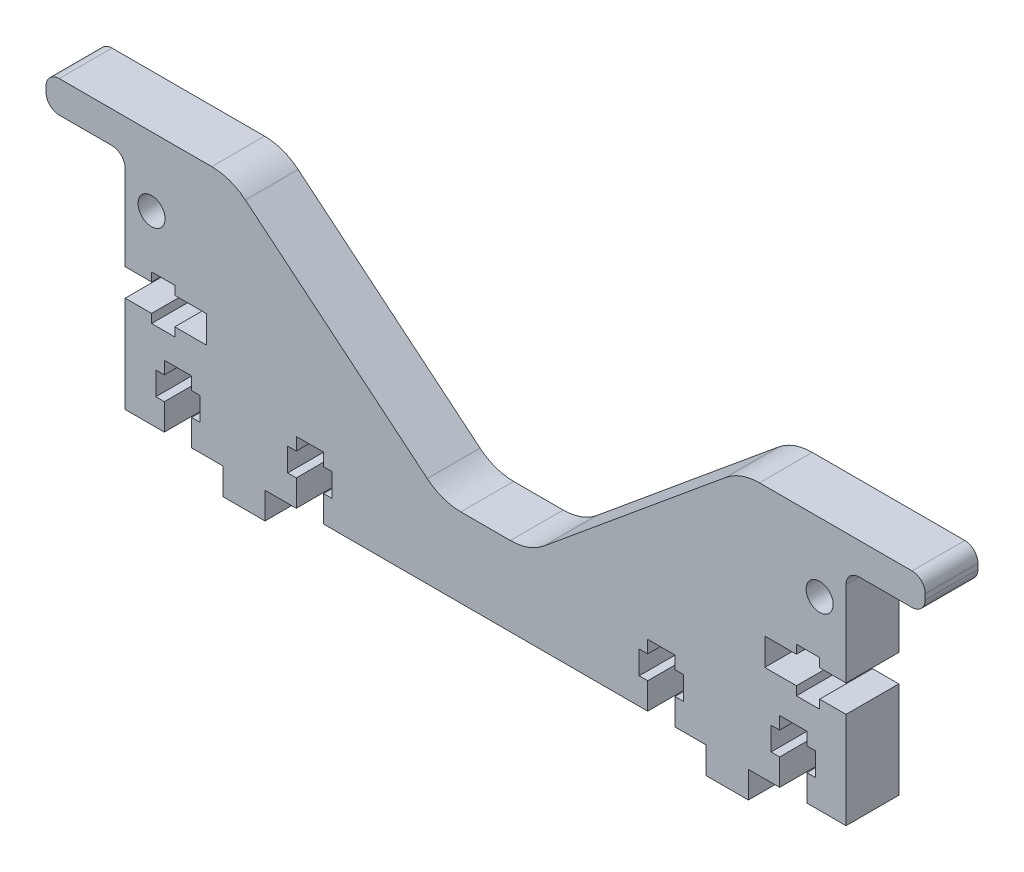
ISO-10303-21;
HEADER;
FILE_DESCRIPTION(('STEP AP214'),'2;1');
FILE_NAME('part.step','',(''),(''),'','','');
FILE_SCHEMA(('AUTOMOTIVE_DESIGN { 1 0 10303 214 1 1 1 1 }'));
ENDSEC;
DATA;
#1=APPLICATION_CONTEXT('core data for automotive mechanical design processes');
#2=APPLICATION_PROTOCOL_DEFINITION('international standard','automotive_design',2000,#1);
#3=PRODUCT_CONTEXT('',#1,'mechanical');
#4=PRODUCT('Part','Part','',(#3));
#5=PRODUCT_RELATED_PRODUCT_CATEGORY('part','',(#4));
#6=PRODUCT_DEFINITION_FORMATION('','',#4);
#7=PRODUCT_DEFINITION_CONTEXT('part definition',#1,'design');
#8=PRODUCT_DEFINITION('design','',#6,#7);
#9=PRODUCT_DEFINITION_SHAPE('','',#8);
#10=(LENGTH_UNIT() NAMED_UNIT(*) SI_UNIT(.MILLI.,.METRE.));
#11=(NAMED_UNIT(*) PLANE_ANGLE_UNIT() SI_UNIT($,.RADIAN.));
#12=(NAMED_UNIT(*) SI_UNIT($,.STERADIAN.) SOLID_ANGLE_UNIT());
#13=UNCERTAINTY_MEASURE_WITH_UNIT(LENGTH_MEASURE(1.E-05),#10,'distance_accuracy_value','');
#14=(GEOMETRIC_REPRESENTATION_CONTEXT(3) GLOBAL_UNCERTAINTY_ASSIGNED_CONTEXT((#13)) GLOBAL_UNIT_ASSIGNED_CONTEXT((#10,
#11,#12)) REPRESENTATION_CONTEXT('',''));
#15=CARTESIAN_POINT('',(0.,0.,0.));
#16=DIRECTION('',(0.,0.,1.));
#17=DIRECTION('',(1.,0.,0.));
#18=AXIS2_PLACEMENT_3D('',#15,#16,#17);
#19=CARTESIAN_POINT('',(86.7259999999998,0.,-12.7));
#20=DIRECTION('',(0.,-1.,0.));
#21=DIRECTION('',(0.,0.,-1.));
#22=AXIS2_PLACEMENT_3D('',#19,#20,#21);
#23=PLANE('',#22);
#24=DIRECTION('',(0.,0.,1.));
#25=VECTOR('',#24,1.);
#26=CARTESIAN_POINT('',(63.2309999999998,0.,-12.7));
#27=LINE('',#26,#25);
#28=CARTESIAN_POINT('',(63.2309999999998,0.,-12.7));
#29=VERTEX_POINT('',#28);
#30=CARTESIAN_POINT('',(63.2309999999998,0.,0.));
#31=VERTEX_POINT('',#30);
#32=EDGE_CURVE('E669',#29,#31,#27,.T.);
#33=ORIENTED_EDGE('',*,*,#32,.F.);
#34=DIRECTION('',(1.,0.,0.));
#35=VECTOR('',#34,1.);
#36=CARTESIAN_POINT('',(86.7259999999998,0.,-12.7));
#37=LINE('',#36,#35);
#38=CARTESIAN_POINT('',(70.7493999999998,0.,-12.7));
#39=VERTEX_POINT('',#38);
#40=EDGE_CURVE('E681',#29,#39,#37,.T.);
#41=ORIENTED_EDGE('',*,*,#40,.T.);
#42=DIRECTION('',(0.,0.,1.));
#43=VECTOR('',#42,1.);
#44=CARTESIAN_POINT('',(70.7493999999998,0.,-12.7));
#45=LINE('',#44,#43);
#46=CARTESIAN_POINT('',(70.7493999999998,0.,0.));
#47=VERTEX_POINT('',#46);
#48=EDGE_CURVE('E1172',#39,#47,#45,.T.);
#49=ORIENTED_EDGE('',*,*,#48,.T.);
#50=DIRECTION('',(1.,0.,0.));
#51=VECTOR('',#50,1.);
#52=CARTESIAN_POINT('',(86.7259999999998,0.,0.));
#53=LINE('',#52,#51);
#54=EDGE_CURVE('E683',#31,#47,#53,.T.);
#55=ORIENTED_EDGE('',*,*,#54,.F.);
#56=EDGE_LOOP('',(#33,#41,#49,#55));
#57=FACE_BOUND('',#56,.T.);
#58=ADVANCED_FACE('F37',(#57),#23,.T.);
#59=DIRECTION('',(0.,0.,1.));
#60=VECTOR('',#59,1.);
#61=CARTESIAN_POINT('',(-53.0709999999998,0.,-12.7));
#62=LINE('',#61,#60);
#63=CARTESIAN_POINT('',(-53.0709999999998,0.,-12.7));
#64=VERTEX_POINT('',#63);
#65=CARTESIAN_POINT('',(-53.0709999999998,0.,0.));
#66=VERTEX_POINT('',#65);
#67=EDGE_CURVE('E745',#64,#66,#62,.T.);
#68=ORIENTED_EDGE('',*,*,#67,.F.);
#69=CARTESIAN_POINT('',(-45.5525999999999,0.,-12.7));
#70=VERTEX_POINT('',#69);
#71=EDGE_CURVE('E697',#64,#70,#37,.T.);
#72=ORIENTED_EDGE('',*,*,#71,.T.);
#73=DIRECTION('',(0.,0.,1.));
#74=VECTOR('',#73,1.);
#75=CARTESIAN_POINT('',(-45.5525999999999,0.,-12.7));
#76=LINE('',#75,#74);
#77=CARTESIAN_POINT('',(-45.5525999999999,0.,0.));
#78=VERTEX_POINT('',#77);
#79=EDGE_CURVE('E818',#70,#78,#76,.T.);
#80=ORIENTED_EDGE('',*,*,#79,.T.);
#81=EDGE_CURVE('E1309',#66,#78,#53,.T.);
#82=ORIENTED_EDGE('',*,*,#81,.F.);
#83=EDGE_LOOP('',(#68,#72,#80,#82));
#84=FACE_BOUND('',#83,.T.);
#85=ADVANCED_FACE('F1684',(#84),#23,.T.);
#86=DIRECTION('',(0.,0.,1.));
#87=VECTOR('',#86,1.);
#88=CARTESIAN_POINT('',(-63.2309999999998,0.,-12.7));
#89=LINE('',#88,#87);
#90=CARTESIAN_POINT('',(-63.2309999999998,0.,-12.7));
#91=VERTEX_POINT('',#90);
#92=CARTESIAN_POINT('',(-63.2309999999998,0.,0.));
#93=VERTEX_POINT('',#92);
#94=EDGE_CURVE('E719',#91,#93,#89,.T.);
#95=ORIENTED_EDGE('',*,*,#94,.T.);
#96=CARTESIAN_POINT('',(-70.7493999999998,0.,0.));
#97=VERTEX_POINT('',#96);
#98=EDGE_CURVE('E1306',#97,#93,#53,.T.);
#99=ORIENTED_EDGE('',*,*,#98,.F.);
#100=DIRECTION('',(0.,0.,1.));
#101=VECTOR('',#100,1.);
#102=CARTESIAN_POINT('',(-70.7493999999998,0.,-12.7));
#103=LINE('',#102,#101);
#104=CARTESIAN_POINT('',(-70.7493999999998,0.,-12.7));
#105=VERTEX_POINT('',#104);
#106=EDGE_CURVE('E721',#105,#97,#103,.T.);
#107=ORIENTED_EDGE('',*,*,#106,.F.);
#108=EDGE_CURVE('E701',#105,#91,#37,.T.);
#109=ORIENTED_EDGE('',*,*,#108,.T.);
#110=EDGE_LOOP('',(#95,#99,#107,#109));
#111=FACE_BOUND('',#110,.T.);
#112=ADVANCED_FACE('F717',(#111),#23,.T.);
#113=DIRECTION('',(0.,0.,1.));
#114=VECTOR('',#113,1.);
#115=CARTESIAN_POINT('',(-38.9993999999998,0.,-12.7));
#116=LINE('',#115,#114);
#117=CARTESIAN_POINT('',(-38.9993999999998,0.,-12.7));
#118=VERTEX_POINT('',#117);
#119=CARTESIAN_POINT('',(-38.9993999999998,0.,0.));
#120=VERTEX_POINT('',#119);
#121=EDGE_CURVE('E786',#118,#120,#116,.T.);
#122=ORIENTED_EDGE('',*,*,#121,.F.);
#123=CARTESIAN_POINT('',(38.9993999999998,0.,-12.7));
#124=VERTEX_POINT('',#123);
#125=EDGE_CURVE('E700',#118,#124,#37,.T.);
#126=ORIENTED_EDGE('',*,*,#125,.T.);
#127=DIRECTION('',(0.,0.,1.));
#128=VECTOR('',#127,1.);
#129=CARTESIAN_POINT('',(38.9993999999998,0.,-12.7));
#130=LINE('',#129,#128);
#131=CARTESIAN_POINT('',(38.9993999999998,0.,0.));
#132=VERTEX_POINT('',#131);
#133=EDGE_CURVE('E877',#124,#132,#130,.T.);
#134=ORIENTED_EDGE('',*,*,#133,.T.);
#135=EDGE_CURVE('E1314',#120,#132,#53,.T.);
#136=ORIENTED_EDGE('',*,*,#135,.F.);
#137=EDGE_LOOP('',(#122,#126,#134,#136));
#138=FACE_BOUND('',#137,.T.);
#139=ADVANCED_FACE('F1705',(#138),#23,.T.);
#140=CARTESIAN_POINT('',(-86.7259999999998,0.,-12.7));
#141=DIRECTION('',(-1.,0.,0.));
#142=DIRECTION('',(0.,-1.,0.));
#143=AXIS2_PLACEMENT_3D('',#140,#141,#142);
#144=PLANE('',#143);
#145=DIRECTION('',(0.,0.,1.));
#146=VECTOR('',#145,1.);
#147=CARTESIAN_POINT('',(-86.7259999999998,29.7567175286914,-12.7));
#148=LINE('',#147,#146);
#149=CARTESIAN_POINT('',(-86.7259999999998,29.7567175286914,-12.7));
#150=VERTEX_POINT('',#149);
#151=CARTESIAN_POINT('',(-86.7259999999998,29.7567175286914,0.));
#152=VERTEX_POINT('',#151);
#153=EDGE_CURVE('E968',#150,#152,#148,.T.);
#154=ORIENTED_EDGE('',*,*,#153,.T.);
#155=DIRECTION('',(0.,-1.,0.));
#156=VECTOR('',#155,1.);
#157=CARTESIAN_POINT('',(-86.7259999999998,0.,0.));
#158=LINE('',#157,#156);
#159=CARTESIAN_POINT('',(-86.7259999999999,50.2395117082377,0.));
#160=VERTEX_POINT('',#159);
#161=EDGE_CURVE('E702',#160,#152,#158,.T.);
#162=ORIENTED_EDGE('',*,*,#161,.F.);
#163=DIRECTION('',(0.,0.,1.));
#164=VECTOR('',#163,1.);
#165=CARTESIAN_POINT('',(-86.7259999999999,50.2395117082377,-12.7));
#166=LINE('',#165,#164);
#167=CARTESIAN_POINT('',(-86.7259999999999,50.2395117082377,-12.7));
#168=VERTEX_POINT('',#167);
#169=EDGE_CURVE('E1456',#160,#168,#166,.F.);
#170=ORIENTED_EDGE('',*,*,#169,.T.);
#171=DIRECTION('',(0.,-1.,0.));
#172=VECTOR('',#171,1.);
#173=CARTESIAN_POINT('',(-86.7259999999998,0.,-12.7));
#174=LINE('',#173,#172);
#175=EDGE_CURVE('E1377',#168,#150,#174,.T.);
#176=ORIENTED_EDGE('',*,*,#175,.T.);
#177=EDGE_LOOP('',(#154,#162,#170,#176));
#178=FACE_BOUND('',#177,.T.);
#179=ADVANCED_FACE('F1604',(#178),#144,.T.);
#180=DIRECTION('',(0.,0.,1.));
#181=VECTOR('',#180,1.);
#182=CARTESIAN_POINT('',(-77.3025999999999,0.,-12.7));
#183=LINE('',#182,#181);
#184=CARTESIAN_POINT('',(-77.3025999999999,0.,-12.7));
#185=VERTEX_POINT('',#184);
#186=CARTESIAN_POINT('',(-77.3025999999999,0.,0.));
#187=VERTEX_POINT('',#186);
#188=EDGE_CURVE('E1055',#185,#187,#183,.T.);
#189=ORIENTED_EDGE('',*,*,#188,.T.);
#190=CARTESIAN_POINT('',(-86.7259999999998,0.,0.));
#191=VERTEX_POINT('',#190);
#192=EDGE_CURVE('E1308',#191,#187,#53,.T.);
#193=ORIENTED_EDGE('',*,*,#192,.F.);
#194=DIRECTION('',(0.,0.,1.));
#195=VECTOR('',#194,1.);
#196=CARTESIAN_POINT('',(-86.7259999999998,0.,-12.7));
#197=LINE('',#196,#195);
#198=CARTESIAN_POINT('',(-86.7259999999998,0.,-12.7));
#199=VERTEX_POINT('',#198);
#200=EDGE_CURVE('E1376',#199,#191,#197,.T.);
#201=ORIENTED_EDGE('',*,*,#200,.F.);
#202=EDGE_CURVE('E698',#199,#185,#37,.T.);
#203=ORIENTED_EDGE('',*,*,#202,.T.);
#204=EDGE_LOOP('',(#189,#193,#201,#203));
#205=FACE_BOUND('',#204,.T.);
#206=ADVANCED_FACE('F1552',(#205),#23,.T.);
#207=DIRECTION('',(0.,0.,1.));
#208=VECTOR('',#207,1.);
#209=CARTESIAN_POINT('',(53.0709999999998,0.,-12.7));
#210=LINE('',#209,#208);
#211=CARTESIAN_POINT('',(53.0709999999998,0.,-12.7));
#212=VERTEX_POINT('',#211);
#213=CARTESIAN_POINT('',(53.0709999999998,0.,0.));
#214=VERTEX_POINT('',#213);
#215=EDGE_CURVE('E684',#212,#214,#210,.T.);
#216=ORIENTED_EDGE('',*,*,#215,.T.);
#217=CARTESIAN_POINT('',(45.5525999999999,0.,0.));
#218=VERTEX_POINT('',#217);
#219=EDGE_CURVE('E1311',#218,#214,#53,.T.);
#220=ORIENTED_EDGE('',*,*,#219,.F.);
#221=DIRECTION('',(0.,0.,1.));
#222=VECTOR('',#221,1.);
#223=CARTESIAN_POINT('',(45.5525999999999,0.,-12.7));
#224=LINE('',#223,#222);
#225=CARTESIAN_POINT('',(45.5525999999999,0.,-12.7));
#226=VERTEX_POINT('',#225);
#227=EDGE_CURVE('E930',#226,#218,#224,.T.);
#228=ORIENTED_EDGE('',*,*,#227,.F.);
#229=EDGE_CURVE('E694',#226,#212,#37,.T.);
#230=ORIENTED_EDGE('',*,*,#229,.T.);
#231=EDGE_LOOP('',(#216,#220,#228,#230));
#232=FACE_BOUND('',#231,.T.);
#233=ADVANCED_FACE('F1693',(#232),#23,.T.);
#234=CARTESIAN_POINT('',(86.7259999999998,0.,-12.7));
#235=DIRECTION('',(1.,0.,0.));
#236=DIRECTION('',(0.,1.,0.));
#237=AXIS2_PLACEMENT_3D('',#234,#235,#236);
#238=PLANE('',#237);
#239=DIRECTION('',(0.,0.,1.));
#240=VECTOR('',#239,1.);
#241=CARTESIAN_POINT('',(86.7259999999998,23.2067175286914,-12.7));
#242=LINE('',#241,#240);
#243=CARTESIAN_POINT('',(86.7259999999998,23.2067175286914,-12.7));
#244=VERTEX_POINT('',#243);
#245=CARTESIAN_POINT('',(86.7259999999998,23.2067175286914,0.));
#246=VERTEX_POINT('',#245);
#247=EDGE_CURVE('E1261',#244,#246,#242,.T.);
#248=ORIENTED_EDGE('',*,*,#247,.T.);
#249=DIRECTION('',(0.,1.,0.));
#250=VECTOR('',#249,1.);
#251=CARTESIAN_POINT('',(86.7259999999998,0.,0.));
#252=LINE('',#251,#250);
#253=CARTESIAN_POINT('',(86.7259999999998,0.,0.));
#254=VERTEX_POINT('',#253);
#255=EDGE_CURVE('E1379',#254,#246,#252,.T.);
#256=ORIENTED_EDGE('',*,*,#255,.F.);
#257=DIRECTION('',(0.,0.,1.));
#258=VECTOR('',#257,1.);
#259=CARTESIAN_POINT('',(86.7259999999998,0.,-12.7));
#260=LINE('',#259,#258);
#261=CARTESIAN_POINT('',(86.7259999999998,0.,-12.7));
#262=VERTEX_POINT('',#261);
#263=EDGE_CURVE('E1371',#262,#254,#260,.T.);
#264=ORIENTED_EDGE('',*,*,#263,.F.);
#265=DIRECTION('',(0.,1.,0.));
#266=VECTOR('',#265,1.);
#267=CARTESIAN_POINT('',(86.7259999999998,0.,-12.7));
#268=LINE('',#267,#266);
#269=EDGE_CURVE('E711',#262,#244,#268,.T.);
#270=ORIENTED_EDGE('',*,*,#269,.T.);
#271=EDGE_LOOP('',(#248,#256,#264,#270));
#272=FACE_BOUND('',#271,.T.);
#273=ADVANCED_FACE('F1380',(#272),#238,.T.);
#274=DIRECTION('',(0.,0.,1.));
#275=VECTOR('',#274,1.);
#276=CARTESIAN_POINT('',(77.3025999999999,0.,-12.7));
#277=LINE('',#276,#275);
#278=CARTESIAN_POINT('',(77.3025999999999,0.,-12.7));
#279=VERTEX_POINT('',#278);
#280=CARTESIAN_POINT('',(77.3025999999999,0.,0.));
#281=VERTEX_POINT('',#280);
#282=EDGE_CURVE('E1140',#279,#281,#277,.T.);
#283=ORIENTED_EDGE('',*,*,#282,.F.);
#284=EDGE_CURVE('E695',#279,#262,#37,.T.);
#285=ORIENTED_EDGE('',*,*,#284,.T.);
#286=ORIENTED_EDGE('',*,*,#263,.T.);
#287=EDGE_CURVE('E1294',#281,#254,#53,.T.);
#288=ORIENTED_EDGE('',*,*,#287,.F.);
#289=EDGE_LOOP('',(#283,#285,#286,#288));
#290=FACE_BOUND('',#289,.T.);
#291=ADVANCED_FACE('F1368',(#290),#23,.T.);
#292=DIRECTION('',(0.,0.,1.));
#293=VECTOR('',#292,1.);
#294=CARTESIAN_POINT('',(-86.7259999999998,23.2067175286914,-12.7));
#295=LINE('',#294,#293);
#296=CARTESIAN_POINT('',(-86.7259999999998,23.2067175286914,-12.7));
#297=VERTEX_POINT('',#296);
#298=CARTESIAN_POINT('',(-86.7259999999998,23.2067175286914,0.));
#299=VERTEX_POINT('',#298);
#300=EDGE_CURVE('E1020',#297,#299,#295,.T.);
#301=ORIENTED_EDGE('',*,*,#300,.F.);
#302=EDGE_CURVE('E1542',#297,#199,#174,.T.);
#303=ORIENTED_EDGE('',*,*,#302,.T.);
#304=ORIENTED_EDGE('',*,*,#200,.T.);
#305=EDGE_CURVE('E1409',#299,#191,#158,.T.);
#306=ORIENTED_EDGE('',*,*,#305,.F.);
#307=EDGE_LOOP('',(#301,#303,#304,#306));
#308=FACE_BOUND('',#307,.T.);
#309=ADVANCED_FACE('F1549',(#308),#144,.T.);
#310=CARTESIAN_POINT('',(-86.7259999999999,53.4145117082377,-12.7));
#311=DIRECTION('',(0.,-1.,0.));
#312=DIRECTION('',(1.,0.,0.));
#313=AXIS2_PLACEMENT_3D('',#310,#311,#312);
#314=PLANE('',#313);
#315=DIRECTION('',(1.,0.,0.));
#316=VECTOR('',#315,1.);
#317=CARTESIAN_POINT('',(-86.7259999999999,53.4145117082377,-12.7));
#318=LINE('',#317,#316);
#319=CARTESIAN_POINT('',(-102.601,53.4145117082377,-12.7));
#320=VERTEX_POINT('',#319);
#321=CARTESIAN_POINT('',(-89.9009999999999,53.4145117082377,-12.7));
#322=VERTEX_POINT('',#321);
#323=EDGE_CURVE('E1540',#320,#322,#318,.T.);
#324=ORIENTED_EDGE('',*,*,#323,.T.);
#325=DIRECTION('',(0.,0.,1.));
#326=VECTOR('',#325,1.);
#327=CARTESIAN_POINT('',(-89.9009999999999,53.4145117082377,0.));
#328=LINE('',#327,#326);
#329=CARTESIAN_POINT('',(-89.9009999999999,53.4145117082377,0.));
#330=VERTEX_POINT('',#329);
#331=EDGE_CURVE('E1453',#322,#330,#328,.T.);
#332=ORIENTED_EDGE('',*,*,#331,.T.);
#333=DIRECTION('',(1.,0.,0.));
#334=VECTOR('',#333,1.);
#335=CARTESIAN_POINT('',(-86.7259999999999,53.4145117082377,0.));
#336=LINE('',#335,#334);
#337=CARTESIAN_POINT('',(-102.601,53.4145117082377,0.));
#338=VERTEX_POINT('',#337);
#339=EDGE_CURVE('E1406',#338,#330,#336,.T.);
#340=ORIENTED_EDGE('',*,*,#339,.F.);
#341=DIRECTION('',(0.,0.,1.));
#342=VECTOR('',#341,1.);
#343=CARTESIAN_POINT('',(-102.601,53.4145117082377,-12.7));
#344=LINE('',#343,#342);
#345=EDGE_CURVE('E1451',#338,#320,#344,.F.);
#346=ORIENTED_EDGE('',*,*,#345,.T.);
#347=EDGE_LOOP('',(#324,#332,#340,#346));
#348=FACE_BOUND('',#347,.T.);
#349=ADVANCED_FACE('F1611',(#348),#314,.T.);
#350=CARTESIAN_POINT('',(-105.776,53.4145117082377,-12.7));
#351=DIRECTION('',(-1.,0.,0.));
#352=DIRECTION('',(0.,0.,1.));
#353=AXIS2_PLACEMENT_3D('',#350,#351,#352);
#354=PLANE('',#353);
#355=DIRECTION('',(0.,-1.,0.));
#356=VECTOR('',#355,1.);
#357=CARTESIAN_POINT('',(-105.776,53.4145117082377,-12.7));
#358=LINE('',#357,#356);
#359=CARTESIAN_POINT('',(-105.776,57.8595117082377,-12.7));
#360=VERTEX_POINT('',#359);
#361=CARTESIAN_POINT('',(-105.776,56.5895117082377,-12.7));
#362=VERTEX_POINT('',#361);
#363=EDGE_CURVE('E1537',#360,#362,#358,.T.);
#364=ORIENTED_EDGE('',*,*,#363,.T.);
#365=DIRECTION('',(0.,0.,1.));
#366=VECTOR('',#365,1.);
#367=CARTESIAN_POINT('',(-105.776,56.5895117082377,-12.7));
#368=LINE('',#367,#366);
#369=CARTESIAN_POINT('',(-105.776,56.5895117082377,0.));
#370=VERTEX_POINT('',#369);
#371=EDGE_CURVE('E1460',#362,#370,#368,.T.);
#372=ORIENTED_EDGE('',*,*,#371,.T.);
#373=DIRECTION('',(0.,-1.,0.));
#374=VECTOR('',#373,1.);
#375=CARTESIAN_POINT('',(-105.776,53.4145117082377,0.));
#376=LINE('',#375,#374);
#377=CARTESIAN_POINT('',(-105.776,57.8595117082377,0.));
#378=VERTEX_POINT('',#377);
#379=EDGE_CURVE('E1403',#378,#370,#376,.T.);
#380=ORIENTED_EDGE('',*,*,#379,.F.);
#381=DIRECTION('',(0.,0.,1.));
#382=VECTOR('',#381,1.);
#383=CARTESIAN_POINT('',(-105.776,57.8595117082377,-12.7));
#384=LINE('',#383,#382);
#385=EDGE_CURVE('E1458',#378,#360,#384,.F.);
#386=ORIENTED_EDGE('',*,*,#385,.T.);
#387=EDGE_LOOP('',(#364,#372,#380,#386));
#388=FACE_BOUND('',#387,.T.);
#389=ADVANCED_FACE('F1621',(#388),#354,.T.);
#390=CARTESIAN_POINT('',(-105.776,61.0345117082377,-12.7));
#391=DIRECTION('',(0.,1.,0.));
#392=DIRECTION('',(-1.,0.,0.));
#393=AXIS2_PLACEMENT_3D('',#390,#391,#392);
#394=PLANE('',#393);
#395=DIRECTION('',(-1.,0.,0.));
#396=VECTOR('',#395,1.);
#397=CARTESIAN_POINT('',(-105.776,61.0345117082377,-12.7));
#398=LINE('',#397,#396);
#399=CARTESIAN_POINT('',(-65.8948513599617,61.0345117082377,-12.7));
#400=VERTEX_POINT('',#399);
#401=CARTESIAN_POINT('',(-102.601,61.0345117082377,-12.7));
#402=VERTEX_POINT('',#401);
#403=EDGE_CURVE('E1534',#400,#402,#398,.T.);
#404=ORIENTED_EDGE('',*,*,#403,.T.);
#405=DIRECTION('',(0.,0.,1.));
#406=VECTOR('',#405,1.);
#407=CARTESIAN_POINT('',(-102.601,61.0345117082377,-12.7));
#408=LINE('',#407,#406);
#409=CARTESIAN_POINT('',(-102.601,61.0345117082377,0.));
#410=VERTEX_POINT('',#409);
#411=EDGE_CURVE('E1479',#402,#410,#408,.T.);
#412=ORIENTED_EDGE('',*,*,#411,.T.);
#413=DIRECTION('',(-1.,0.,0.));
#414=VECTOR('',#413,1.);
#415=CARTESIAN_POINT('',(-105.776,61.0345117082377,0.));
#416=LINE('',#415,#414);
#417=CARTESIAN_POINT('',(-65.8948513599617,61.0345117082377,0.));
#418=VERTEX_POINT('',#417);
#419=EDGE_CURVE('E1400',#418,#410,#416,.T.);
#420=ORIENTED_EDGE('',*,*,#419,.F.);
#421=DIRECTION('',(0.,0.,1.));
#422=VECTOR('',#421,1.);
#423=CARTESIAN_POINT('',(-65.8948513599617,61.0345117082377,-12.7));
#424=LINE('',#423,#422);
#425=EDGE_CURVE('E1423',#418,#400,#424,.F.);
#426=ORIENTED_EDGE('',*,*,#425,.T.);
#427=EDGE_LOOP('',(#404,#412,#420,#426));
#428=FACE_BOUND('',#427,.T.);
#429=ADVANCED_FACE('F1629',(#428),#394,.T.);
#430=CARTESIAN_POINT('',(-61.3259999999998,61.0345117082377,-12.7));
#431=DIRECTION('',(0.637055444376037,0.770817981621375,0.));
#432=DIRECTION('',(-0.770817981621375,0.637055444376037,0.));
#433=AXIS2_PLACEMENT_3D('',#430,#431,#432);
#434=PLANE('',#433);
#435=DIRECTION('',(-0.770817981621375,0.637055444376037,0.));
#436=VECTOR('',#435,1.);
#437=CARTESIAN_POINT('',(-61.3259999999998,61.0345117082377,-12.7));
#438=LINE('',#437,#436);
#439=CARTESIAN_POINT('',(-14.0477527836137,21.9606116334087,-12.7));
#440=VERTEX_POINT('',#439);
#441=CARTESIAN_POINT('',(-57.804247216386,58.1239000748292,-12.7));
#442=VERTEX_POINT('',#441);
#443=EDGE_CURVE('E1531',#440,#442,#438,.T.);
#444=ORIENTED_EDGE('',*,*,#443,.T.);
#445=DIRECTION('',(0.,0.,1.));
#446=VECTOR('',#445,1.);
#447=CARTESIAN_POINT('',(-57.804247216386,58.1239000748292,-12.7));
#448=LINE('',#447,#446);
#449=CARTESIAN_POINT('',(-57.804247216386,58.1239000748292,0.));
#450=VERTEX_POINT('',#449);
#451=EDGE_CURVE('E1416',#442,#450,#448,.T.);
#452=ORIENTED_EDGE('',*,*,#451,.T.);
#453=DIRECTION('',(-0.770817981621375,0.637055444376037,0.));
#454=VECTOR('',#453,1.);
#455=CARTESIAN_POINT('',(-61.3259999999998,61.0345117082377,0.));
#456=LINE('',#455,#454);
#457=CARTESIAN_POINT('',(-14.0477527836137,21.9606116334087,0.));
#458=VERTEX_POINT('',#457);
#459=EDGE_CURVE('E1397',#458,#450,#456,.T.);
#460=ORIENTED_EDGE('',*,*,#459,.F.);
#461=DIRECTION('',(0.,0.,1.));
#462=VECTOR('',#461,1.);
#463=CARTESIAN_POINT('',(-14.0477527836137,21.9606116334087,-12.7));
#464=LINE('',#463,#462);
#465=EDGE_CURVE('E1413',#458,#440,#464,.F.);
#466=ORIENTED_EDGE('',*,*,#465,.T.);
#467=EDGE_LOOP('',(#444,#452,#460,#466));
#468=FACE_BOUND('',#467,.T.);
#469=ADVANCED_FACE('F1638',(#468),#434,.T.);
#470=CARTESIAN_POINT('',(10.5259999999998,19.0500000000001,-12.7));
#471=DIRECTION('',(0.,1.,0.));
#472=DIRECTION('',(0.,0.,1.));
#473=AXIS2_PLACEMENT_3D('',#470,#471,#472);
#474=PLANE('',#473);
#475=DIRECTION('',(-1.,0.,0.));
#476=VECTOR('',#475,1.);
#477=CARTESIAN_POINT('',(10.5259999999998,19.0500000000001,-12.7));
#478=LINE('',#477,#476);
#479=CARTESIAN_POINT('',(5.95714864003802,19.0500000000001,-12.7));
#480=VERTEX_POINT('',#479);
#481=CARTESIAN_POINT('',(-5.95714864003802,19.0500000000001,-12.7));
#482=VERTEX_POINT('',#481);
#483=EDGE_CURVE('E1528',#480,#482,#478,.T.);
#484=ORIENTED_EDGE('',*,*,#483,.T.);
#485=DIRECTION('',(0.,0.,1.));
#486=VECTOR('',#485,1.);
#487=CARTESIAN_POINT('',(-5.95714864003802,19.0500000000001,0.));
#488=LINE('',#487,#486);
#489=CARTESIAN_POINT('',(-5.95714864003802,19.0500000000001,0.));
#490=VERTEX_POINT('',#489);
#491=EDGE_CURVE('E1432',#482,#490,#488,.T.);
#492=ORIENTED_EDGE('',*,*,#491,.T.);
#493=DIRECTION('',(-1.,0.,0.));
#494=VECTOR('',#493,1.);
#495=CARTESIAN_POINT('',(10.5259999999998,19.0500000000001,0.));
#496=LINE('',#495,#494);
#497=CARTESIAN_POINT('',(5.95714864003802,19.0500000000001,0.));
#498=VERTEX_POINT('',#497);
#499=EDGE_CURVE('E1394',#498,#490,#496,.T.);
#500=ORIENTED_EDGE('',*,*,#499,.F.);
#501=DIRECTION('',(0.,0.,1.));
#502=VECTOR('',#501,1.);
#503=CARTESIAN_POINT('',(5.95714864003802,19.0500000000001,-12.7));
#504=LINE('',#503,#502);
#505=EDGE_CURVE('E1430',#498,#480,#504,.F.);
#506=ORIENTED_EDGE('',*,*,#505,.T.);
#507=EDGE_LOOP('',(#484,#492,#500,#506));
#508=FACE_BOUND('',#507,.T.);
#509=ADVANCED_FACE('F1646',(#508),#474,.T.);
#510=CARTESIAN_POINT('',(61.3259999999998,61.0345117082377,-12.7));
#511=DIRECTION('',(-0.637055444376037,0.770817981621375,0.));
#512=DIRECTION('',(-0.770817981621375,-0.637055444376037,0.));
#513=AXIS2_PLACEMENT_3D('',#510,#511,#512);
#514=PLANE('',#513);
#515=DIRECTION('',(-0.770817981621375,-0.637055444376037,0.));
#516=VECTOR('',#515,1.);
#517=CARTESIAN_POINT('',(61.3259999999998,61.0345117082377,-12.7));
#518=LINE('',#517,#516);
#519=CARTESIAN_POINT('',(57.804247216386,58.1239000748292,-12.7));
#520=VERTEX_POINT('',#519);
#521=CARTESIAN_POINT('',(14.0477527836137,21.9606116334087,-12.7));
#522=VERTEX_POINT('',#521);
#523=EDGE_CURVE('E1525',#520,#522,#518,.T.);
#524=ORIENTED_EDGE('',*,*,#523,.T.);
#525=DIRECTION('',(0.,0.,1.));
#526=VECTOR('',#525,1.);
#527=CARTESIAN_POINT('',(14.0477527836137,21.9606116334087,0.));
#528=LINE('',#527,#526);
#529=CARTESIAN_POINT('',(14.0477527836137,21.9606116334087,0.));
#530=VERTEX_POINT('',#529);
#531=EDGE_CURVE('E1437',#522,#530,#528,.T.);
#532=ORIENTED_EDGE('',*,*,#531,.T.);
#533=DIRECTION('',(-0.770817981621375,-0.637055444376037,0.));
#534=VECTOR('',#533,1.);
#535=CARTESIAN_POINT('',(61.3259999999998,61.0345117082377,0.));
#536=LINE('',#535,#534);
#537=CARTESIAN_POINT('',(57.804247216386,58.1239000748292,0.));
#538=VERTEX_POINT('',#537);
#539=EDGE_CURVE('E1391',#538,#530,#536,.T.);
#540=ORIENTED_EDGE('',*,*,#539,.F.);
#541=DIRECTION('',(0.,0.,1.));
#542=VECTOR('',#541,1.);
#543=CARTESIAN_POINT('',(57.804247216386,58.1239000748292,-12.7));
#544=LINE('',#543,#542);
#545=EDGE_CURVE('E1435',#538,#520,#544,.F.);
#546=ORIENTED_EDGE('',*,*,#545,.T.);
#547=EDGE_LOOP('',(#524,#532,#540,#546));
#548=FACE_BOUND('',#547,.T.);
#549=ADVANCED_FACE('F1656',(#548),#514,.T.);
#550=CARTESIAN_POINT('',(105.776,61.0345117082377,-12.7));
#551=DIRECTION('',(0.,1.,0.));
#552=DIRECTION('',(-1.,0.,0.));
#553=AXIS2_PLACEMENT_3D('',#550,#551,#552);
#554=PLANE('',#553);
#555=DIRECTION('',(-1.,0.,0.));
#556=VECTOR('',#555,1.);
#557=CARTESIAN_POINT('',(105.776,61.0345117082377,0.));
#558=LINE('',#557,#556);
#559=CARTESIAN_POINT('',(102.601,61.0345117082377,0.));
#560=VERTEX_POINT('',#559);
#561=CARTESIAN_POINT('',(65.8948513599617,61.0345117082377,0.));
#562=VERTEX_POINT('',#561);
#563=EDGE_CURVE('E1389',#560,#562,#558,.T.);
#564=ORIENTED_EDGE('',*,*,#563,.F.);
#565=DIRECTION('',(0.,0.,1.));
#566=VECTOR('',#565,1.);
#567=CARTESIAN_POINT('',(102.601,61.0345117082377,-12.7));
#568=LINE('',#567,#566);
#569=CARTESIAN_POINT('',(102.601,61.0345117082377,-12.7));
#570=VERTEX_POINT('',#569);
#571=EDGE_CURVE('E1495',#560,#570,#568,.F.);
#572=ORIENTED_EDGE('',*,*,#571,.T.);
#573=DIRECTION('',(-1.,0.,0.));
#574=VECTOR('',#573,1.);
#575=CARTESIAN_POINT('',(105.776,61.0345117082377,-12.7));
#576=LINE('',#575,#574);
#577=CARTESIAN_POINT('',(65.8948513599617,61.0345117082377,-12.7));
#578=VERTEX_POINT('',#577);
#579=EDGE_CURVE('E1521',#570,#578,#576,.T.);
#580=ORIENTED_EDGE('',*,*,#579,.T.);
#581=DIRECTION('',(0.,0.,1.));
#582=VECTOR('',#581,1.);
#583=CARTESIAN_POINT('',(65.8948513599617,61.0345117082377,-12.7));
#584=LINE('',#583,#582);
#585=EDGE_CURVE('E1440',#578,#562,#584,.T.);
#586=ORIENTED_EDGE('',*,*,#585,.T.);
#587=EDGE_LOOP('',(#564,#572,#580,#586));
#588=FACE_BOUND('',#587,.T.);
#589=ADVANCED_FACE('F1665',(#588),#554,.T.);
#590=CARTESIAN_POINT('',(105.776,53.4145117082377,-12.7));
#591=DIRECTION('',(1.,0.,0.));
#592=DIRECTION('',(0.,0.,-1.));
#593=AXIS2_PLACEMENT_3D('',#590,#591,#592);
#594=PLANE('',#593);
#595=DIRECTION('',(0.,1.,0.));
#596=VECTOR('',#595,1.);
#597=CARTESIAN_POINT('',(105.776,53.4145117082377,0.));
#598=LINE('',#597,#596);
#599=CARTESIAN_POINT('',(105.776,56.5895117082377,0.));
#600=VERTEX_POINT('',#599);
#601=CARTESIAN_POINT('',(105.776,57.8595117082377,0.));
#602=VERTEX_POINT('',#601);
#603=EDGE_CURVE('E1384',#600,#602,#598,.T.);
#604=ORIENTED_EDGE('',*,*,#603,.F.);
#605=DIRECTION('',(0.,0.,1.));
#606=VECTOR('',#605,1.);
#607=CARTESIAN_POINT('',(105.776,56.5895117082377,-12.7));
#608=LINE('',#607,#606);
#609=CARTESIAN_POINT('',(105.776,56.5895117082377,-12.7));
#610=VERTEX_POINT('',#609);
#611=EDGE_CURVE('E1493',#600,#610,#608,.F.);
#612=ORIENTED_EDGE('',*,*,#611,.T.);
#613=DIRECTION('',(0.,1.,0.));
#614=VECTOR('',#613,1.);
#615=CARTESIAN_POINT('',(105.776,53.4145117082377,-12.7));
#616=LINE('',#615,#614);
#617=CARTESIAN_POINT('',(105.776,57.8595117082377,-12.7));
#618=VERTEX_POINT('',#617);
#619=EDGE_CURVE('E1518',#610,#618,#616,.T.);
#620=ORIENTED_EDGE('',*,*,#619,.T.);
#621=DIRECTION('',(0.,0.,1.));
#622=VECTOR('',#621,1.);
#623=CARTESIAN_POINT('',(105.776,57.8595117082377,-12.7));
#624=LINE('',#623,#622);
#625=EDGE_CURVE('E1490',#618,#602,#624,.T.);
#626=ORIENTED_EDGE('',*,*,#625,.T.);
#627=EDGE_LOOP('',(#604,#612,#620,#626));
#628=FACE_BOUND('',#627,.T.);
#629=ADVANCED_FACE('F1673',(#628),#594,.T.);
#630=CARTESIAN_POINT('',(86.7259999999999,53.4145117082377,-12.7));
#631=DIRECTION('',(0.,-1.,0.));
#632=DIRECTION('',(1.,0.,0.));
#633=AXIS2_PLACEMENT_3D('',#630,#631,#632);
#634=PLANE('',#633);
#635=DIRECTION('',(1.,0.,0.));
#636=VECTOR('',#635,1.);
#637=CARTESIAN_POINT('',(86.7259999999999,53.4145117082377,0.));
#638=LINE('',#637,#636);
#639=CARTESIAN_POINT('',(89.9009999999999,53.4145117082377,0.));
#640=VERTEX_POINT('',#639);
#641=CARTESIAN_POINT('',(102.601,53.4145117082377,0.));
#642=VERTEX_POINT('',#641);
#643=EDGE_CURVE('E1382',#640,#642,#638,.T.);
#644=ORIENTED_EDGE('',*,*,#643,.F.);
#645=DIRECTION('',(0.,0.,1.));
#646=VECTOR('',#645,1.);
#647=CARTESIAN_POINT('',(89.9009999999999,53.4145117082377,-12.7));
#648=LINE('',#647,#646);
#649=CARTESIAN_POINT('',(89.9009999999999,53.4145117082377,-12.7));
#650=VERTEX_POINT('',#649);
#651=EDGE_CURVE('E1488',#640,#650,#648,.F.);
#652=ORIENTED_EDGE('',*,*,#651,.T.);
#653=DIRECTION('',(1.,0.,0.));
#654=VECTOR('',#653,1.);
#655=CARTESIAN_POINT('',(86.7259999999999,53.4145117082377,-12.7));
#656=LINE('',#655,#654);
#657=CARTESIAN_POINT('',(102.601,53.4145117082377,-12.7));
#658=VERTEX_POINT('',#657);
#659=EDGE_CURVE('E1515',#650,#658,#656,.T.);
#660=ORIENTED_EDGE('',*,*,#659,.T.);
#661=DIRECTION('',(0.,0.,1.));
#662=VECTOR('',#661,1.);
#663=CARTESIAN_POINT('',(102.601,53.4145117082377,-12.7));
#664=LINE('',#663,#662);
#665=EDGE_CURVE('E1485',#658,#642,#664,.T.);
#666=ORIENTED_EDGE('',*,*,#665,.T.);
#667=EDGE_LOOP('',(#644,#652,#660,#666));
#668=FACE_BOUND('',#667,.T.);
#669=ADVANCED_FACE('F1508',(#668),#634,.T.);
#670=DIRECTION('',(0.,0.,1.));
#671=VECTOR('',#670,1.);
#672=CARTESIAN_POINT('',(86.7259999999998,29.7567175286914,-12.7));
#673=LINE('',#672,#671);
#674=CARTESIAN_POINT('',(86.7259999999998,29.7567175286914,-12.7));
#675=VERTEX_POINT('',#674);
#676=CARTESIAN_POINT('',(86.7259999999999,29.7567175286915,0.));
#677=VERTEX_POINT('',#676);
#678=EDGE_CURVE('E1230',#675,#677,#673,.T.);
#679=ORIENTED_EDGE('',*,*,#678,.F.);
#680=CARTESIAN_POINT('',(86.7259999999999,50.2395117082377,-12.7));
#681=VERTEX_POINT('',#680);
#682=EDGE_CURVE('E706',#675,#681,#268,.T.);
#683=ORIENTED_EDGE('',*,*,#682,.T.);
#684=DIRECTION('',(0.,0.,1.));
#685=VECTOR('',#684,1.);
#686=CARTESIAN_POINT('',(86.7259999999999,50.2395117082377,0.));
#687=LINE('',#686,#685);
#688=CARTESIAN_POINT('',(86.7259999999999,50.2395117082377,0.));
#689=VERTEX_POINT('',#688);
#690=EDGE_CURVE('E1482',#681,#689,#687,.T.);
#691=ORIENTED_EDGE('',*,*,#690,.T.);
#692=EDGE_CURVE('E1313',#677,#689,#252,.T.);
#693=ORIENTED_EDGE('',*,*,#692,.F.);
#694=EDGE_LOOP('',(#679,#683,#691,#693));
#695=FACE_BOUND('',#694,.T.);
#696=ADVANCED_FACE('F1699',(#695),#238,.T.);
#697=CARTESIAN_POINT('',(0.,0.,-12.7));
#698=DIRECTION('',(0.,0.,-1.));
#699=DIRECTION('',(-1.,0.,0.));
#700=AXIS2_PLACEMENT_3D('',#697,#698,#699);
#701=PLANE('',#700);
#702=DIRECTION('',(0.,-1.,0.));
#703=VECTOR('',#702,1.);
#704=CARTESIAN_POINT('',(-45.5525999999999,0.,-12.7));
#705=LINE('',#704,#703);
#706=CARTESIAN_POINT('',(-45.5525999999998,6.34999999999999,-12.7));
#707=VERTEX_POINT('',#706);
#708=EDGE_CURVE('E784',#707,#70,#705,.T.);
#709=ORIENTED_EDGE('',*,*,#708,.T.);
#710=ORIENTED_EDGE('',*,*,#71,.F.);
#711=DIRECTION('',(0.,1.,0.));
#712=VECTOR('',#711,1.);
#713=CARTESIAN_POINT('',(-53.0709999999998,0.,-12.7));
#714=LINE('',#713,#712);
#715=CARTESIAN_POINT('',(-53.0709999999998,-6.40080000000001,-12.7));
#716=VERTEX_POINT('',#715);
#717=EDGE_CURVE('E734',#716,#64,#714,.T.);
#718=ORIENTED_EDGE('',*,*,#717,.F.);
#719=DIRECTION('',(1.,0.,0.));
#720=VECTOR('',#719,1.);
#721=CARTESIAN_POINT('',(-53.0709999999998,-6.40080000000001,-12.7));
#722=LINE('',#721,#720);
#723=CARTESIAN_POINT('',(-63.2309999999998,-6.40080000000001,-12.7));
#724=VERTEX_POINT('',#723);
#725=EDGE_CURVE('E731',#724,#716,#722,.T.);
#726=ORIENTED_EDGE('',*,*,#725,.F.);
#727=DIRECTION('',(0.,-1.,0.));
#728=VECTOR('',#727,1.);
#729=CARTESIAN_POINT('',(-63.2309999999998,-6.40080000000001,-12.7));
#730=LINE('',#729,#728);
#731=EDGE_CURVE('E728',#91,#724,#730,.T.);
#732=ORIENTED_EDGE('',*,*,#731,.F.);
#733=ORIENTED_EDGE('',*,*,#108,.F.);
#734=DIRECTION('',(0.,1.,0.));
#735=VECTOR('',#734,1.);
#736=CARTESIAN_POINT('',(-70.7493999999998,0.,-12.7));
#737=LINE('',#736,#735);
#738=CARTESIAN_POINT('',(-70.7493999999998,6.34999999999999,-12.7));
#739=VERTEX_POINT('',#738);
#740=EDGE_CURVE('E725',#105,#739,#737,.T.);
#741=ORIENTED_EDGE('',*,*,#740,.T.);
#742=DIRECTION('',(1.,0.,0.));
#743=VECTOR('',#742,1.);
#744=CARTESIAN_POINT('',(-70.7493999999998,6.34999999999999,-12.7));
#745=LINE('',#744,#743);
#746=CARTESIAN_POINT('',(-68.6919999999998,6.34999999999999,-12.7));
#747=VERTEX_POINT('',#746);
#748=EDGE_CURVE('E1029',#739,#747,#745,.T.);
#749=ORIENTED_EDGE('',*,*,#748,.T.);
#750=DIRECTION('',(0.,1.,0.));
#751=VECTOR('',#750,1.);
#752=CARTESIAN_POINT('',(-68.6919999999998,6.34999999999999,-12.7));
#753=LINE('',#752,#751);
#754=CARTESIAN_POINT('',(-68.6919999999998,11.938,-12.7));
#755=VERTEX_POINT('',#754);
#756=EDGE_CURVE('E1031',#747,#755,#753,.T.);
#757=ORIENTED_EDGE('',*,*,#756,.T.);
#758=DIRECTION('',(-1.,0.,0.));
#759=VECTOR('',#758,1.);
#760=CARTESIAN_POINT('',(-68.6919999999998,11.938,-12.7));
#761=LINE('',#760,#759);
#762=CARTESIAN_POINT('',(-70.7493999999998,11.938,-12.7));
#763=VERTEX_POINT('',#762);
#764=EDGE_CURVE('E1034',#755,#763,#761,.T.);
#765=ORIENTED_EDGE('',*,*,#764,.T.);
#766=DIRECTION('',(0.,1.,0.));
#767=VECTOR('',#766,1.);
#768=CARTESIAN_POINT('',(-70.7493999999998,11.938,-12.7));
#769=LINE('',#768,#767);
#770=CARTESIAN_POINT('',(-70.7493999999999,14.986,-12.7));
#771=VERTEX_POINT('',#770);
#772=EDGE_CURVE('E1037',#763,#771,#769,.T.);
#773=ORIENTED_EDGE('',*,*,#772,.T.);
#774=DIRECTION('',(-1.,0.,0.));
#775=VECTOR('',#774,1.);
#776=CARTESIAN_POINT('',(-77.3025999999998,14.986,-12.7));
#777=LINE('',#776,#775);
#778=CARTESIAN_POINT('',(-77.3025999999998,14.986,-12.7));
#779=VERTEX_POINT('',#778);
#780=EDGE_CURVE('E1040',#771,#779,#777,.T.);
#781=ORIENTED_EDGE('',*,*,#780,.T.);
#782=DIRECTION('',(0.,-1.,0.));
#783=VECTOR('',#782,1.);
#784=CARTESIAN_POINT('',(-77.3025999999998,11.938,-12.7));
#785=LINE('',#784,#783);
#786=CARTESIAN_POINT('',(-77.3025999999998,11.938,-12.7));
#787=VERTEX_POINT('',#786);
#788=EDGE_CURVE('E1043',#779,#787,#785,.T.);
#789=ORIENTED_EDGE('',*,*,#788,.T.);
#790=DIRECTION('',(-1.,0.,0.));
#791=VECTOR('',#790,1.);
#792=CARTESIAN_POINT('',(-79.3599999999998,11.938,-12.7));
#793=LINE('',#792,#791);
#794=CARTESIAN_POINT('',(-79.3599999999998,11.938,-12.7));
#795=VERTEX_POINT('',#794);
#796=EDGE_CURVE('E1046',#787,#795,#793,.T.);
#797=ORIENTED_EDGE('',*,*,#796,.T.);
#798=DIRECTION('',(0.,-1.,0.));
#799=VECTOR('',#798,1.);
#800=CARTESIAN_POINT('',(-79.3599999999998,6.34999999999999,-12.7));
#801=LINE('',#800,#799);
#802=CARTESIAN_POINT('',(-79.3599999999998,6.34999999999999,-12.7));
#803=VERTEX_POINT('',#802);
#804=EDGE_CURVE('E1049',#795,#803,#801,.T.);
#805=ORIENTED_EDGE('',*,*,#804,.T.);
#806=DIRECTION('',(1.,0.,0.));
#807=VECTOR('',#806,1.);
#808=CARTESIAN_POINT('',(-77.3025999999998,6.34999999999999,-12.7));
#809=LINE('',#808,#807);
#810=CARTESIAN_POINT('',(-77.3025999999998,6.34999999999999,-12.7));
#811=VERTEX_POINT('',#810);
#812=EDGE_CURVE('E1052',#803,#811,#809,.T.);
#813=ORIENTED_EDGE('',*,*,#812,.T.);
#814=DIRECTION('',(0.,-1.,0.));
#815=VECTOR('',#814,1.);
#816=CARTESIAN_POINT('',(-77.3025999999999,0.,-12.7));
#817=LINE('',#816,#815);
#818=EDGE_CURVE('E1024',#811,#185,#817,.T.);
#819=ORIENTED_EDGE('',*,*,#818,.T.);
#820=ORIENTED_EDGE('',*,*,#202,.F.);
#821=ORIENTED_EDGE('',*,*,#302,.F.);
#822=DIRECTION('',(1.,0.,0.));
#823=VECTOR('',#822,1.);
#824=CARTESIAN_POINT('',(-86.7259999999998,23.2067175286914,-12.7));
#825=LINE('',#824,#823);
#826=CARTESIAN_POINT('',(-80.3760000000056,23.2067175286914,-12.7));
#827=VERTEX_POINT('',#826);
#828=EDGE_CURVE('E937',#297,#827,#825,.T.);
#829=ORIENTED_EDGE('',*,*,#828,.T.);
#830=DIRECTION('',(0.,-1.,0.));
#831=VECTOR('',#830,1.);
#832=CARTESIAN_POINT('',(-80.3760000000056,23.2067175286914,-12.7));
#833=LINE('',#832,#831);
#834=CARTESIAN_POINT('',(-80.3760000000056,21.0985175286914,-12.7));
#835=VERTEX_POINT('',#834);
#836=EDGE_CURVE('E941',#827,#835,#833,.T.);
#837=ORIENTED_EDGE('',*,*,#836,.T.);
#838=DIRECTION('',(1.,0.,0.));
#839=VECTOR('',#838,1.);
#840=CARTESIAN_POINT('',(-80.3760000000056,21.0985175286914,-12.7));
#841=LINE('',#840,#839);
#842=CARTESIAN_POINT('',(-74.7880000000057,21.0985175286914,-12.7));
#843=VERTEX_POINT('',#842);
#844=EDGE_CURVE('E944',#835,#843,#841,.T.);
#845=ORIENTED_EDGE('',*,*,#844,.T.);
#846=DIRECTION('',(0.,1.,0.));
#847=VECTOR('',#846,1.);
#848=CARTESIAN_POINT('',(-74.7880000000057,21.0985175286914,-12.7));
#849=LINE('',#848,#847);
#850=CARTESIAN_POINT('',(-74.7880000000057,23.2067175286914,-12.7));
#851=VERTEX_POINT('',#850);
#852=EDGE_CURVE('E947',#843,#851,#849,.T.);
#853=ORIENTED_EDGE('',*,*,#852,.T.);
#854=DIRECTION('',(1.,0.,0.));
#855=VECTOR('',#854,1.);
#856=CARTESIAN_POINT('',(-74.7880000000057,23.2067175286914,-12.7));
#857=LINE('',#856,#855);
#858=CARTESIAN_POINT('',(-67.1680000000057,23.2067175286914,-12.7));
#859=VERTEX_POINT('',#858);
#860=EDGE_CURVE('E950',#851,#859,#857,.T.);
#861=ORIENTED_EDGE('',*,*,#860,.T.);
#862=DIRECTION('',(0.,1.,0.));
#863=VECTOR('',#862,1.);
#864=CARTESIAN_POINT('',(-67.1680000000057,29.7567175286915,-12.7));
#865=LINE('',#864,#863);
#866=CARTESIAN_POINT('',(-67.1680000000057,29.7567175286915,-12.7));
#867=VERTEX_POINT('',#866);
#868=EDGE_CURVE('E953',#859,#867,#865,.T.);
#869=ORIENTED_EDGE('',*,*,#868,.T.);
#870=DIRECTION('',(-1.,0.,0.));
#871=VECTOR('',#870,1.);
#872=CARTESIAN_POINT('',(-74.7880000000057,29.7567175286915,-12.7));
#873=LINE('',#872,#871);
#874=CARTESIAN_POINT('',(-74.7880000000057,29.7567175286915,-12.7));
#875=VERTEX_POINT('',#874);
#876=EDGE_CURVE('E956',#867,#875,#873,.T.);
#877=ORIENTED_EDGE('',*,*,#876,.T.);
#878=DIRECTION('',(0.,1.,0.));
#879=VECTOR('',#878,1.);
#880=CARTESIAN_POINT('',(-74.7880000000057,31.8649175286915,-12.7));
#881=LINE('',#880,#879);
#882=CARTESIAN_POINT('',(-74.7880000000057,31.8649175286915,-12.7));
#883=VERTEX_POINT('',#882);
#884=EDGE_CURVE('E959',#875,#883,#881,.T.);
#885=ORIENTED_EDGE('',*,*,#884,.T.);
#886=DIRECTION('',(-1.,0.,0.));
#887=VECTOR('',#886,1.);
#888=CARTESIAN_POINT('',(-80.3760000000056,31.8649175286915,-12.7));
#889=LINE('',#888,#887);
#890=CARTESIAN_POINT('',(-80.3760000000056,31.8649175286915,-12.7));
#891=VERTEX_POINT('',#890);
#892=EDGE_CURVE('E962',#883,#891,#889,.T.);
#893=ORIENTED_EDGE('',*,*,#892,.T.);
#894=DIRECTION('',(0.,-1.,0.));
#895=VECTOR('',#894,1.);
#896=CARTESIAN_POINT('',(-80.3760000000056,29.7567175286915,-12.7));
#897=LINE('',#896,#895);
#898=CARTESIAN_POINT('',(-80.3760000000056,29.7567175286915,-12.7));
#899=VERTEX_POINT('',#898);
#900=EDGE_CURVE('E965',#891,#899,#897,.T.);
#901=ORIENTED_EDGE('',*,*,#900,.T.);
#902=DIRECTION('',(-1.,0.,0.));
#903=VECTOR('',#902,1.);
#904=CARTESIAN_POINT('',(-86.7259999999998,29.7567175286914,-12.7));
#905=LINE('',#904,#903);
#906=EDGE_CURVE('E934',#899,#150,#905,.T.);
#907=ORIENTED_EDGE('',*,*,#906,.T.);
#908=ORIENTED_EDGE('',*,*,#175,.F.);
#909=CARTESIAN_POINT('',(-89.9009999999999,50.2395117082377,-12.7));
#910=DIRECTION('',(0.,0.,-1.));
#911=DIRECTION('',(-1.,0.,0.));
#912=AXIS2_PLACEMENT_3D('',#909,#910,#911);
#913=CIRCLE('',#912,3.175);
#914=EDGE_CURVE('E1499',#168,#322,#913,.F.);
#915=ORIENTED_EDGE('',*,*,#914,.T.);
#916=ORIENTED_EDGE('',*,*,#323,.F.);
#917=CARTESIAN_POINT('',(-102.601,56.5895117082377,-12.7));
#918=DIRECTION('',(0.,0.,-1.));
#919=DIRECTION('',(-1.,0.,0.));
#920=AXIS2_PLACEMENT_3D('',#917,#918,#919);
#921=CIRCLE('',#920,3.175);
#922=EDGE_CURVE('E1477',#320,#362,#921,.T.);
#923=ORIENTED_EDGE('',*,*,#922,.T.);
#924=ORIENTED_EDGE('',*,*,#363,.F.);
#925=CARTESIAN_POINT('',(-102.601,57.8595117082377,-12.7));
#926=DIRECTION('',(0.,0.,-1.));
#927=DIRECTION('',(-1.,0.,0.));
#928=AXIS2_PLACEMENT_3D('',#925,#926,#927);
#929=CIRCLE('',#928,3.175);
#930=EDGE_CURVE('E1475',#360,#402,#929,.T.);
#931=ORIENTED_EDGE('',*,*,#930,.T.);
#932=ORIENTED_EDGE('',*,*,#403,.F.);
#933=CARTESIAN_POINT('',(-65.8948513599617,48.3345117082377,-12.7));
#934=DIRECTION('',(0.,0.,-1.));
#935=DIRECTION('',(-1.,0.,0.));
#936=AXIS2_PLACEMENT_3D('',#933,#934,#935);
#937=CIRCLE('',#936,12.7);
#938=EDGE_CURVE('E1428',#400,#442,#937,.T.);
#939=ORIENTED_EDGE('',*,*,#938,.T.);
#940=ORIENTED_EDGE('',*,*,#443,.F.);
#941=CARTESIAN_POINT('',(-5.95714864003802,31.7500000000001,-12.7));
#942=DIRECTION('',(0.,0.,-1.));
#943=DIRECTION('',(-1.,0.,0.));
#944=AXIS2_PLACEMENT_3D('',#941,#942,#943);
#945=CIRCLE('',#944,12.7);
#946=EDGE_CURVE('E1445',#440,#482,#945,.F.);
#947=ORIENTED_EDGE('',*,*,#946,.T.);
#948=ORIENTED_EDGE('',*,*,#483,.F.);
#949=CARTESIAN_POINT('',(5.95714864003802,31.7500000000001,-12.7));
#950=DIRECTION('',(0.,0.,-1.));
#951=DIRECTION('',(-1.,0.,0.));
#952=AXIS2_PLACEMENT_3D('',#949,#950,#951);
#953=CIRCLE('',#952,12.7);
#954=EDGE_CURVE('E1449',#480,#522,#953,.F.);
#955=ORIENTED_EDGE('',*,*,#954,.T.);
#956=ORIENTED_EDGE('',*,*,#523,.F.);
#957=CARTESIAN_POINT('',(65.8948513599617,48.3345117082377,-12.7));
#958=DIRECTION('',(0.,0.,-1.));
#959=DIRECTION('',(-1.,0.,0.));
#960=AXIS2_PLACEMENT_3D('',#957,#958,#959);
#961=CIRCLE('',#960,12.7);
#962=EDGE_CURVE('E1425',#520,#578,#961,.T.);
#963=ORIENTED_EDGE('',*,*,#962,.T.);
#964=ORIENTED_EDGE('',*,*,#579,.F.);
#965=CARTESIAN_POINT('',(102.601,57.8595117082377,-12.7));
#966=DIRECTION('',(0.,0.,-1.));
#967=DIRECTION('',(-1.,0.,0.));
#968=AXIS2_PLACEMENT_3D('',#965,#966,#967);
#969=CIRCLE('',#968,3.175);
#970=EDGE_CURVE('E1471',#570,#618,#969,.T.);
#971=ORIENTED_EDGE('',*,*,#970,.T.);
#972=ORIENTED_EDGE('',*,*,#619,.F.);
#973=CARTESIAN_POINT('',(102.601,56.5895117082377,-12.7));
#974=DIRECTION('',(0.,0.,-1.));
#975=DIRECTION('',(-1.,0.,0.));
#976=AXIS2_PLACEMENT_3D('',#973,#974,#975);
#977=CIRCLE('',#976,3.175);
#978=EDGE_CURVE('E1473',#610,#658,#977,.T.);
#979=ORIENTED_EDGE('',*,*,#978,.T.);
#980=ORIENTED_EDGE('',*,*,#659,.F.);
#981=CARTESIAN_POINT('',(89.9009999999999,50.2395117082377,-12.7));
#982=DIRECTION('',(0.,0.,-1.));
#983=DIRECTION('',(-1.,0.,0.));
#984=AXIS2_PLACEMENT_3D('',#981,#982,#983);
#985=CIRCLE('',#984,3.175);
#986=EDGE_CURVE('E11',#650,#681,#985,.F.);
#987=ORIENTED_EDGE('',*,*,#986,.T.);
#988=ORIENTED_EDGE('',*,*,#682,.F.);
#989=DIRECTION('',(-1.,0.,0.));
#990=VECTOR('',#989,1.);
#991=CARTESIAN_POINT('',(86.7259999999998,29.7567175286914,-12.7));
#992=LINE('',#991,#990);
#993=CARTESIAN_POINT('',(80.3760000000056,29.7567175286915,-12.7));
#994=VERTEX_POINT('',#993);
#995=EDGE_CURVE('E1196',#675,#994,#992,.T.);
#996=ORIENTED_EDGE('',*,*,#995,.T.);
#997=DIRECTION('',(0.,1.,0.));
#998=VECTOR('',#997,1.);
#999=CARTESIAN_POINT('',(80.3760000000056,29.7567175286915,-12.7));
#1000=LINE('',#999,#998);
#1001=CARTESIAN_POINT('',(80.3760000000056,31.8649175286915,-12.7));
#1002=VERTEX_POINT('',#1001);
#1003=EDGE_CURVE('E1199',#994,#1002,#1000,.T.);
#1004=ORIENTED_EDGE('',*,*,#1003,.T.);
#1005=DIRECTION('',(-1.,0.,0.));
#1006=VECTOR('',#1005,1.);
#1007=CARTESIAN_POINT('',(80.3760000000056,31.8649175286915,-12.7));
#1008=LINE('',#1007,#1006);
#1009=CARTESIAN_POINT('',(74.7880000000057,31.8649175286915,-12.7));
#1010=VERTEX_POINT('',#1009);
#1011=EDGE_CURVE('E1203',#1002,#1010,#1008,.T.);
#1012=ORIENTED_EDGE('',*,*,#1011,.T.);
#1013=DIRECTION('',(0.,-1.,0.));
#1014=VECTOR('',#1013,1.);
#1015=CARTESIAN_POINT('',(74.7880000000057,31.8649175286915,-12.7));
#1016=LINE('',#1015,#1014);
#1017=CARTESIAN_POINT('',(74.7880000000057,29.7567175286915,-12.7));
#1018=VERTEX_POINT('',#1017);
#1019=EDGE_CURVE('E1206',#1010,#1018,#1016,.T.);
#1020=ORIENTED_EDGE('',*,*,#1019,.T.);
#1021=DIRECTION('',(-1.,0.,0.));
#1022=VECTOR('',#1021,1.);
#1023=CARTESIAN_POINT('',(74.7880000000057,29.7567175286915,-12.7));
#1024=LINE('',#1023,#1022);
#1025=CARTESIAN_POINT('',(67.1680000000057,29.7567175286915,-12.7));
#1026=VERTEX_POINT('',#1025);
#1027=EDGE_CURVE('E1209',#1018,#1026,#1024,.T.);
#1028=ORIENTED_EDGE('',*,*,#1027,.T.);
#1029=DIRECTION('',(0.,-1.,0.));
#1030=VECTOR('',#1029,1.);
#1031=CARTESIAN_POINT('',(67.1680000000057,29.7567175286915,-12.7));
#1032=LINE('',#1031,#1030);
#1033=CARTESIAN_POINT('',(67.1680000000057,23.2067175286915,-12.7));
#1034=VERTEX_POINT('',#1033);
#1035=EDGE_CURVE('E1212',#1026,#1034,#1032,.T.);
#1036=ORIENTED_EDGE('',*,*,#1035,.T.);
#1037=DIRECTION('',(1.,0.,0.));
#1038=VECTOR('',#1037,1.);
#1039=CARTESIAN_POINT('',(74.7880000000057,23.2067175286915,-12.7));
#1040=LINE('',#1039,#1038);
#1041=CARTESIAN_POINT('',(74.7880000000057,23.2067175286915,-12.7));
#1042=VERTEX_POINT('',#1041);
#1043=EDGE_CURVE('E1215',#1034,#1042,#1040,.T.);
#1044=ORIENTED_EDGE('',*,*,#1043,.T.);
#1045=DIRECTION('',(0.,-1.,0.));
#1046=VECTOR('',#1045,1.);
#1047=CARTESIAN_POINT('',(74.7880000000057,21.0985175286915,-12.7));
#1048=LINE('',#1047,#1046);
#1049=CARTESIAN_POINT('',(74.7880000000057,21.0985175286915,-12.7));
#1050=VERTEX_POINT('',#1049);
#1051=EDGE_CURVE('E1218',#1042,#1050,#1048,.T.);
#1052=ORIENTED_EDGE('',*,*,#1051,.T.);
#1053=DIRECTION('',(1.,0.,0.));
#1054=VECTOR('',#1053,1.);
#1055=CARTESIAN_POINT('',(80.3760000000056,21.0985175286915,-12.7));
#1056=LINE('',#1055,#1054);
#1057=CARTESIAN_POINT('',(80.3760000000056,21.0985175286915,-12.7));
#1058=VERTEX_POINT('',#1057);
#1059=EDGE_CURVE('E1221',#1050,#1058,#1056,.T.);
#1060=ORIENTED_EDGE('',*,*,#1059,.T.);
#1061=DIRECTION('',(0.,1.,0.));
#1062=VECTOR('',#1061,1.);
#1063=CARTESIAN_POINT('',(80.3760000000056,23.2067175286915,-12.7));
#1064=LINE('',#1063,#1062);
#1065=CARTESIAN_POINT('',(80.3760000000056,23.2067175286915,-12.7));
#1066=VERTEX_POINT('',#1065);
#1067=EDGE_CURVE('E1224',#1058,#1066,#1064,.T.);
#1068=ORIENTED_EDGE('',*,*,#1067,.T.);
#1069=DIRECTION('',(1.,0.,0.));
#1070=VECTOR('',#1069,1.);
#1071=CARTESIAN_POINT('',(86.7259999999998,23.2067175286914,-12.7));
#1072=LINE('',#1071,#1070);
#1073=EDGE_CURVE('E1227',#1066,#244,#1072,.T.);
#1074=ORIENTED_EDGE('',*,*,#1073,.T.);
#1075=ORIENTED_EDGE('',*,*,#269,.F.);
#1076=ORIENTED_EDGE('',*,*,#284,.F.);
#1077=DIRECTION('',(0.,1.,0.));
#1078=VECTOR('',#1077,1.);
#1079=CARTESIAN_POINT('',(77.3025999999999,0.,-12.7));
#1080=LINE('',#1079,#1078);
#1081=CARTESIAN_POINT('',(77.3025999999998,6.34999999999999,-12.7));
#1082=VERTEX_POINT('',#1081);
#1083=EDGE_CURVE('E1109',#279,#1082,#1080,.T.);
#1084=ORIENTED_EDGE('',*,*,#1083,.T.);
#1085=DIRECTION('',(1.,0.,0.));
#1086=VECTOR('',#1085,1.);
#1087=CARTESIAN_POINT('',(77.3025999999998,6.34999999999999,-12.7));
#1088=LINE('',#1087,#1086);
#1089=CARTESIAN_POINT('',(79.3599999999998,6.34999999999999,-12.7));
#1090=VERTEX_POINT('',#1089);
#1091=EDGE_CURVE('E1112',#1082,#1090,#1088,.T.);
#1092=ORIENTED_EDGE('',*,*,#1091,.T.);
#1093=DIRECTION('',(0.,1.,0.));
#1094=VECTOR('',#1093,1.);
#1095=CARTESIAN_POINT('',(79.3599999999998,6.34999999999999,-12.7));
#1096=LINE('',#1095,#1094);
#1097=CARTESIAN_POINT('',(79.3599999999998,11.938,-12.7));
#1098=VERTEX_POINT('',#1097);
#1099=EDGE_CURVE('E1116',#1090,#1098,#1096,.T.);
#1100=ORIENTED_EDGE('',*,*,#1099,.T.);
#1101=DIRECTION('',(-1.,0.,0.));
#1102=VECTOR('',#1101,1.);
#1103=CARTESIAN_POINT('',(79.3599999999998,11.938,-12.7));
#1104=LINE('',#1103,#1102);
#1105=CARTESIAN_POINT('',(77.3025999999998,11.938,-12.7));
#1106=VERTEX_POINT('',#1105);
#1107=EDGE_CURVE('E1119',#1098,#1106,#1104,.T.);
#1108=ORIENTED_EDGE('',*,*,#1107,.T.);
#1109=DIRECTION('',(0.,1.,0.));
#1110=VECTOR('',#1109,1.);
#1111=CARTESIAN_POINT('',(77.3025999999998,11.938,-12.7));
#1112=LINE('',#1111,#1110);
#1113=CARTESIAN_POINT('',(77.3025999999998,14.986,-12.7));
#1114=VERTEX_POINT('',#1113);
#1115=EDGE_CURVE('E1122',#1106,#1114,#1112,.T.);
#1116=ORIENTED_EDGE('',*,*,#1115,.T.);
#1117=DIRECTION('',(-1.,0.,0.));
#1118=VECTOR('',#1117,1.);
#1119=CARTESIAN_POINT('',(77.3025999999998,14.986,-12.7));
#1120=LINE('',#1119,#1118);
#1121=CARTESIAN_POINT('',(70.7493999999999,14.986,-12.7));
#1122=VERTEX_POINT('',#1121);
#1123=EDGE_CURVE('E1125',#1114,#1122,#1120,.T.);
#1124=ORIENTED_EDGE('',*,*,#1123,.T.);
#1125=DIRECTION('',(0.,-1.,0.));
#1126=VECTOR('',#1125,1.);
#1127=CARTESIAN_POINT('',(70.7493999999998,11.938,-12.7));
#1128=LINE('',#1127,#1126);
#1129=CARTESIAN_POINT('',(70.7493999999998,11.938,-12.7));
#1130=VERTEX_POINT('',#1129);
#1131=EDGE_CURVE('E1128',#1122,#1130,#1128,.T.);
#1132=ORIENTED_EDGE('',*,*,#1131,.T.);
#1133=DIRECTION('',(-1.,0.,0.));
#1134=VECTOR('',#1133,1.);
#1135=CARTESIAN_POINT('',(68.6919999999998,11.938,-12.7));
#1136=LINE('',#1135,#1134);
#1137=CARTESIAN_POINT('',(68.6919999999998,11.938,-12.7));
#1138=VERTEX_POINT('',#1137);
#1139=EDGE_CURVE('E1131',#1130,#1138,#1136,.T.);
#1140=ORIENTED_EDGE('',*,*,#1139,.T.);
#1141=DIRECTION('',(0.,-1.,0.));
#1142=VECTOR('',#1141,1.);
#1143=CARTESIAN_POINT('',(68.6919999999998,6.34999999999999,-12.7));
#1144=LINE('',#1143,#1142);
#1145=CARTESIAN_POINT('',(68.6919999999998,6.34999999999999,-12.7));
#1146=VERTEX_POINT('',#1145);
#1147=EDGE_CURVE('E1134',#1138,#1146,#1144,.T.);
#1148=ORIENTED_EDGE('',*,*,#1147,.T.);
#1149=DIRECTION('',(1.,0.,0.));
#1150=VECTOR('',#1149,1.);
#1151=CARTESIAN_POINT('',(70.7493999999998,6.34999999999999,-12.7));
#1152=LINE('',#1151,#1150);
#1153=CARTESIAN_POINT('',(70.7493999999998,6.34999999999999,-12.7));
#1154=VERTEX_POINT('',#1153);
#1155=EDGE_CURVE('E1137',#1146,#1154,#1152,.T.);
#1156=ORIENTED_EDGE('',*,*,#1155,.T.);
#1157=DIRECTION('',(0.,-1.,0.));
#1158=VECTOR('',#1157,1.);
#1159=CARTESIAN_POINT('',(70.7493999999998,0.,-12.7));
#1160=LINE('',#1159,#1158);
#1161=EDGE_CURVE('E693',#1154,#39,#1160,.T.);
#1162=ORIENTED_EDGE('',*,*,#1161,.T.);
#1163=ORIENTED_EDGE('',*,*,#40,.F.);
#1164=DIRECTION('',(0.,1.,0.));
#1165=VECTOR('',#1164,1.);
#1166=CARTESIAN_POINT('',(63.2309999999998,-6.40080000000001,-12.7));
#1167=LINE('',#1166,#1165);
#1168=CARTESIAN_POINT('',(63.2309999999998,-6.40080000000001,-12.7));
#1169=VERTEX_POINT('',#1168);
#1170=EDGE_CURVE('E666',#1169,#29,#1167,.T.);
#1171=ORIENTED_EDGE('',*,*,#1170,.F.);
#1172=DIRECTION('',(1.,0.,0.));
#1173=VECTOR('',#1172,1.);
#1174=CARTESIAN_POINT('',(53.0709999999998,-6.40080000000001,-12.7));
#1175=LINE('',#1174,#1173);
#1176=CARTESIAN_POINT('',(53.0709999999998,-6.40080000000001,-12.7));
#1177=VERTEX_POINT('',#1176);
#1178=EDGE_CURVE('E685',#1177,#1169,#1175,.T.);
#1179=ORIENTED_EDGE('',*,*,#1178,.F.);
#1180=DIRECTION('',(0.,-1.,0.));
#1181=VECTOR('',#1180,1.);
#1182=CARTESIAN_POINT('',(53.0709999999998,0.,-12.7));
#1183=LINE('',#1182,#1181);
#1184=EDGE_CURVE('E676',#212,#1177,#1183,.T.);
#1185=ORIENTED_EDGE('',*,*,#1184,.F.);
#1186=ORIENTED_EDGE('',*,*,#229,.F.);
#1187=DIRECTION('',(0.,1.,0.));
#1188=VECTOR('',#1187,1.);
#1189=CARTESIAN_POINT('',(45.5525999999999,0.,-12.7));
#1190=LINE('',#1189,#1188);
#1191=CARTESIAN_POINT('',(45.5525999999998,6.34999999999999,-12.7));
#1192=VERTEX_POINT('',#1191);
#1193=EDGE_CURVE('E846',#226,#1192,#1190,.T.);
#1194=ORIENTED_EDGE('',*,*,#1193,.T.);
#1195=DIRECTION('',(1.,0.,0.));
#1196=VECTOR('',#1195,1.);
#1197=CARTESIAN_POINT('',(45.5525999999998,6.34999999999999,-12.7));
#1198=LINE('',#1197,#1196);
#1199=CARTESIAN_POINT('',(47.6099999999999,6.34999999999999,-12.7));
#1200=VERTEX_POINT('',#1199);
#1201=EDGE_CURVE('E850',#1192,#1200,#1198,.T.);
#1202=ORIENTED_EDGE('',*,*,#1201,.T.);
#1203=DIRECTION('',(0.,1.,0.));
#1204=VECTOR('',#1203,1.);
#1205=CARTESIAN_POINT('',(47.6099999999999,6.34999999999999,-12.7));
#1206=LINE('',#1205,#1204);
#1207=CARTESIAN_POINT('',(47.6099999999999,11.938,-12.7));
#1208=VERTEX_POINT('',#1207);
#1209=EDGE_CURVE('E853',#1200,#1208,#1206,.T.);
#1210=ORIENTED_EDGE('',*,*,#1209,.T.);
#1211=DIRECTION('',(-1.,0.,0.));
#1212=VECTOR('',#1211,1.);
#1213=CARTESIAN_POINT('',(47.6099999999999,11.938,-12.7));
#1214=LINE('',#1213,#1212);
#1215=CARTESIAN_POINT('',(45.5525999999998,11.938,-12.7));
#1216=VERTEX_POINT('',#1215);
#1217=EDGE_CURVE('E856',#1208,#1216,#1214,.T.);
#1218=ORIENTED_EDGE('',*,*,#1217,.T.);
#1219=DIRECTION('',(0.,1.,0.));
#1220=VECTOR('',#1219,1.);
#1221=CARTESIAN_POINT('',(45.5525999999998,11.938,-12.7));
#1222=LINE('',#1221,#1220);
#1223=CARTESIAN_POINT('',(45.5525999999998,14.986,-12.7));
#1224=VERTEX_POINT('',#1223);
#1225=EDGE_CURVE('E859',#1216,#1224,#1222,.T.);
#1226=ORIENTED_EDGE('',*,*,#1225,.T.);
#1227=DIRECTION('',(-1.,0.,0.));
#1228=VECTOR('',#1227,1.);
#1229=CARTESIAN_POINT('',(38.9993999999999,14.986,-12.7));
#1230=LINE('',#1229,#1228);
#1231=CARTESIAN_POINT('',(38.9993999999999,14.986,-12.7));
#1232=VERTEX_POINT('',#1231);
#1233=EDGE_CURVE('E862',#1224,#1232,#1230,.T.);
#1234=ORIENTED_EDGE('',*,*,#1233,.T.);
#1235=DIRECTION('',(0.,-1.,0.));
#1236=VECTOR('',#1235,1.);
#1237=CARTESIAN_POINT('',(38.9993999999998,11.938,-12.7));
#1238=LINE('',#1237,#1236);
#1239=CARTESIAN_POINT('',(38.9993999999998,11.938,-12.7));
#1240=VERTEX_POINT('',#1239);
#1241=EDGE_CURVE('E865',#1232,#1240,#1238,.T.);
#1242=ORIENTED_EDGE('',*,*,#1241,.T.);
#1243=DIRECTION('',(-1.,0.,0.));
#1244=VECTOR('',#1243,1.);
#1245=CARTESIAN_POINT('',(36.9419999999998,11.938,-12.7));
#1246=LINE('',#1245,#1244);
#1247=CARTESIAN_POINT('',(36.9419999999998,11.938,-12.7));
#1248=VERTEX_POINT('',#1247);
#1249=EDGE_CURVE('E868',#1240,#1248,#1246,.T.);
#1250=ORIENTED_EDGE('',*,*,#1249,.T.);
#1251=DIRECTION('',(0.,-1.,0.));
#1252=VECTOR('',#1251,1.);
#1253=CARTESIAN_POINT('',(36.9419999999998,6.34999999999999,-12.7));
#1254=LINE('',#1253,#1252);
#1255=CARTESIAN_POINT('',(36.9419999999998,6.34999999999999,-12.7));
#1256=VERTEX_POINT('',#1255);
#1257=EDGE_CURVE('E871',#1248,#1256,#1254,.T.);
#1258=ORIENTED_EDGE('',*,*,#1257,.T.);
#1259=DIRECTION('',(1.,0.,0.));
#1260=VECTOR('',#1259,1.);
#1261=CARTESIAN_POINT('',(38.9993999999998,6.34999999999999,-12.7));
#1262=LINE('',#1261,#1260);
#1263=CARTESIAN_POINT('',(38.9993999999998,6.34999999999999,-12.7));
#1264=VERTEX_POINT('',#1263);
#1265=EDGE_CURVE('E874',#1256,#1264,#1262,.T.);
#1266=ORIENTED_EDGE('',*,*,#1265,.T.);
#1267=DIRECTION('',(0.,-1.,0.));
#1268=VECTOR('',#1267,1.);
#1269=CARTESIAN_POINT('',(38.9993999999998,0.,-12.7));
#1270=LINE('',#1269,#1268);
#1271=EDGE_CURVE('E843',#1264,#124,#1270,.T.);
#1272=ORIENTED_EDGE('',*,*,#1271,.T.);
#1273=ORIENTED_EDGE('',*,*,#125,.F.);
#1274=DIRECTION('',(0.,1.,0.));
#1275=VECTOR('',#1274,1.);
#1276=CARTESIAN_POINT('',(-38.9993999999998,0.,-12.7));
#1277=LINE('',#1276,#1275);
#1278=CARTESIAN_POINT('',(-38.9993999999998,6.34999999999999,-12.7));
#1279=VERTEX_POINT('',#1278);
#1280=EDGE_CURVE('E753',#118,#1279,#1277,.T.);
#1281=ORIENTED_EDGE('',*,*,#1280,.T.);
#1282=DIRECTION('',(1.,0.,0.));
#1283=VECTOR('',#1282,1.);
#1284=CARTESIAN_POINT('',(-38.9993999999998,6.34999999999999,-12.7));
#1285=LINE('',#1284,#1283);
#1286=CARTESIAN_POINT('',(-36.9419999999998,6.34999999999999,-12.7));
#1287=VERTEX_POINT('',#1286);
#1288=EDGE_CURVE('E756',#1279,#1287,#1285,.T.);
#1289=ORIENTED_EDGE('',*,*,#1288,.T.);
#1290=DIRECTION('',(0.,1.,0.));
#1291=VECTOR('',#1290,1.);
#1292=CARTESIAN_POINT('',(-36.9419999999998,6.34999999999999,-12.7));
#1293=LINE('',#1292,#1291);
#1294=CARTESIAN_POINT('',(-36.9419999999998,11.938,-12.7));
#1295=VERTEX_POINT('',#1294);
#1296=EDGE_CURVE('E760',#1287,#1295,#1293,.T.);
#1297=ORIENTED_EDGE('',*,*,#1296,.T.);
#1298=DIRECTION('',(-1.,0.,0.));
#1299=VECTOR('',#1298,1.);
#1300=CARTESIAN_POINT('',(-36.9419999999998,11.938,-12.7));
#1301=LINE('',#1300,#1299);
#1302=CARTESIAN_POINT('',(-38.9993999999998,11.938,-12.7));
#1303=VERTEX_POINT('',#1302);
#1304=EDGE_CURVE('E763',#1295,#1303,#1301,.T.);
#1305=ORIENTED_EDGE('',*,*,#1304,.T.);
#1306=DIRECTION('',(0.,1.,0.));
#1307=VECTOR('',#1306,1.);
#1308=CARTESIAN_POINT('',(-38.9993999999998,11.938,-12.7));
#1309=LINE('',#1308,#1307);
#1310=CARTESIAN_POINT('',(-38.9993999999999,14.986,-12.7));
#1311=VERTEX_POINT('',#1310);
#1312=EDGE_CURVE('E766',#1303,#1311,#1309,.T.);
#1313=ORIENTED_EDGE('',*,*,#1312,.T.);
#1314=DIRECTION('',(-1.,0.,0.));
#1315=VECTOR('',#1314,1.);
#1316=CARTESIAN_POINT('',(-38.9993999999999,14.986,-12.7));
#1317=LINE('',#1316,#1315);
#1318=CARTESIAN_POINT('',(-45.5525999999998,14.986,-12.7));
#1319=VERTEX_POINT('',#1318);
#1320=EDGE_CURVE('E769',#1311,#1319,#1317,.T.);
#1321=ORIENTED_EDGE('',*,*,#1320,.T.);
#1322=DIRECTION('',(0.,-1.,0.));
#1323=VECTOR('',#1322,1.);
#1324=CARTESIAN_POINT('',(-45.5525999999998,11.938,-12.7));
#1325=LINE('',#1324,#1323);
#1326=CARTESIAN_POINT('',(-45.5525999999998,11.938,-12.7));
#1327=VERTEX_POINT('',#1326);
#1328=EDGE_CURVE('E772',#1319,#1327,#1325,.T.);
#1329=ORIENTED_EDGE('',*,*,#1328,.T.);
#1330=DIRECTION('',(-1.,0.,0.));
#1331=VECTOR('',#1330,1.);
#1332=CARTESIAN_POINT('',(-47.6099999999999,11.938,-12.7));
#1333=LINE('',#1332,#1331);
#1334=CARTESIAN_POINT('',(-47.6099999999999,11.938,-12.7));
#1335=VERTEX_POINT('',#1334);
#1336=EDGE_CURVE('E775',#1327,#1335,#1333,.T.);
#1337=ORIENTED_EDGE('',*,*,#1336,.T.);
#1338=DIRECTION('',(0.,-1.,0.));
#1339=VECTOR('',#1338,1.);
#1340=CARTESIAN_POINT('',(-47.6099999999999,6.34999999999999,-12.7));
#1341=LINE('',#1340,#1339);
#1342=CARTESIAN_POINT('',(-47.6099999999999,6.34999999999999,-12.7));
#1343=VERTEX_POINT('',#1342);
#1344=EDGE_CURVE('E778',#1335,#1343,#1341,.T.);
#1345=ORIENTED_EDGE('',*,*,#1344,.T.);
#1346=DIRECTION('',(1.,0.,0.));
#1347=VECTOR('',#1346,1.);
#1348=CARTESIAN_POINT('',(-45.5525999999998,6.34999999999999,-12.7));
#1349=LINE('',#1348,#1347);
#1350=EDGE_CURVE('E781',#1343,#707,#1349,.T.);
#1351=ORIENTED_EDGE('',*,*,#1350,.T.);
#1352=EDGE_LOOP('',(#709,#710,#718,#726,#732,#733,#741,#749,#757,#765,#773,#781,#789,#797,#805,
#813,#819,#820,#821,#829,#837,#845,#853,#861,#869,#877,#885,#893,#901,#907,#908,#915,#916,#923,
#924,#931,#932,#939,#940,#947,#948,#955,#956,#963,#964,#971,#972,#979,#980,#987,#988,#996,#1004,
#1012,#1020,#1028,#1036,#1044,#1052,#1060,#1068,#1074,#1075,#1076,#1084,#1092,#1100,#1108,#1116,
#1124,#1132,#1140,#1148,#1156,#1162,#1163,#1171,#1179,#1185,#1186,#1194,#1202,#1210,#1218,#1226,
#1234,#1242,#1250,#1258,#1266,#1272,#1273,#1281,#1289,#1297,#1305,#1313,#1321,#1329,#1337,#1345,#1351));
#1353=FACE_BOUND('',#1352,.T.);
#1354=CARTESIAN_POINT('',(-80.3759999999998,44.5245117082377,-12.7));
#1355=DIRECTION('',(0.,0.,1.));
#1356=DIRECTION('',(-1.,0.,0.));
#1357=AXIS2_PLACEMENT_3D('',#1354,#1355,#1356);
#1358=CIRCLE('',#1357,3.25000000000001);
#1359=CARTESIAN_POINT('',(-83.6259999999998,44.5245117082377,-12.7));
#1360=VERTEX_POINT('',#1359);
#1361=EDGE_CURVE('E1286',#1360,#1360,#1358,.T.);
#1362=ORIENTED_EDGE('',*,*,#1361,.T.);
#1363=EDGE_LOOP('',(#1362));
#1364=FACE_BOUND('',#1363,.T.);
#1365=CARTESIAN_POINT('',(80.3759999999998,44.5245117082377,-12.7));
#1366=DIRECTION('',(0.,0.,1.));
#1367=DIRECTION('',(1.,0.,0.));
#1368=AXIS2_PLACEMENT_3D('',#1365,#1366,#1367);
#1369=CIRCLE('',#1368,3.25000000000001);
#1370=CARTESIAN_POINT('',(83.6259999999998,44.5245117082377,-12.7));
#1371=VERTEX_POINT('',#1370);
#1372=EDGE_CURVE('E1292',#1371,#1371,#1369,.T.);
#1373=ORIENTED_EDGE('',*,*,#1372,.T.);
#1374=EDGE_LOOP('',(#1373));
#1375=FACE_BOUND('',#1374,.T.);
#1376=ADVANCED_FACE('F689',(#1353,#1364,#1375),#701,.T.);
#1377=CARTESIAN_POINT('',(0.,0.,0.));
#1378=DIRECTION('',(0.,0.,-1.));
#1379=DIRECTION('',(-1.,0.,0.));
#1380=AXIS2_PLACEMENT_3D('',#1377,#1378,#1379);
#1381=PLANE('',#1380);
#1382=CARTESIAN_POINT('',(-80.3759999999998,44.5245117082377,0.));
#1383=DIRECTION('',(0.,0.,1.));
#1384=DIRECTION('',(-1.,0.,0.));
#1385=AXIS2_PLACEMENT_3D('',#1382,#1383,#1384);
#1386=CIRCLE('',#1385,3.25000000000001);
#1387=CARTESIAN_POINT('',(-83.6259999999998,44.5245117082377,0.));
#1388=VERTEX_POINT('',#1387);
#1389=EDGE_CURVE('E1264',#1388,#1388,#1386,.T.);
#1390=ORIENTED_EDGE('',*,*,#1389,.F.);
#1391=EDGE_LOOP('',(#1390));
#1392=FACE_BOUND('',#1391,.T.);
#1393=CARTESIAN_POINT('',(80.3759999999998,44.5245117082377,0.));
#1394=DIRECTION('',(0.,0.,1.));
#1395=DIRECTION('',(1.,0.,0.));
#1396=AXIS2_PLACEMENT_3D('',#1393,#1394,#1395);
#1397=CIRCLE('',#1396,3.25000000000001);
#1398=CARTESIAN_POINT('',(83.6259999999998,44.5245117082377,0.));
#1399=VERTEX_POINT('',#1398);
#1400=EDGE_CURVE('E1289',#1399,#1399,#1397,.T.);
#1401=ORIENTED_EDGE('',*,*,#1400,.F.);
#1402=EDGE_LOOP('',(#1401));
#1403=FACE_BOUND('',#1402,.T.);
#1404=ORIENTED_EDGE('',*,*,#98,.T.);
#1405=DIRECTION('',(0.,-1.,0.));
#1406=VECTOR('',#1405,1.);
#1407=CARTESIAN_POINT('',(-63.2309999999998,-6.40080000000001,0.));
#1408=LINE('',#1407,#1406);
#1409=CARTESIAN_POINT('',(-63.2309999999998,-6.40080000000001,0.));
#1410=VERTEX_POINT('',#1409);
#1411=EDGE_CURVE('E741',#93,#1410,#1408,.T.);
#1412=ORIENTED_EDGE('',*,*,#1411,.T.);
#1413=DIRECTION('',(1.,0.,0.));
#1414=VECTOR('',#1413,1.);
#1415=CARTESIAN_POINT('',(-53.0709999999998,-6.40080000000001,0.));
#1416=LINE('',#1415,#1414);
#1417=CARTESIAN_POINT('',(-53.0709999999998,-6.40080000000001,0.));
#1418=VERTEX_POINT('',#1417);
#1419=EDGE_CURVE('E736',#1410,#1418,#1416,.T.);
#1420=ORIENTED_EDGE('',*,*,#1419,.T.);
#1421=DIRECTION('',(0.,1.,0.));
#1422=VECTOR('',#1421,1.);
#1423=CARTESIAN_POINT('',(-53.0709999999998,0.,0.));
#1424=LINE('',#1423,#1422);
#1425=EDGE_CURVE('E59',#1418,#66,#1424,.T.);
#1426=ORIENTED_EDGE('',*,*,#1425,.T.);
#1427=ORIENTED_EDGE('',*,*,#81,.T.);
#1428=DIRECTION('',(0.,-1.,0.));
#1429=VECTOR('',#1428,1.);
#1430=CARTESIAN_POINT('',(-45.5525999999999,0.,0.));
#1431=LINE('',#1430,#1429);
#1432=CARTESIAN_POINT('',(-45.5525999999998,6.34999999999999,0.));
#1433=VERTEX_POINT('',#1432);
#1434=EDGE_CURVE('E757',#1433,#78,#1431,.T.);
#1435=ORIENTED_EDGE('',*,*,#1434,.F.);
#1436=DIRECTION('',(1.,0.,0.));
#1437=VECTOR('',#1436,1.);
#1438=CARTESIAN_POINT('',(-45.5525999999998,6.34999999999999,0.));
#1439=LINE('',#1438,#1437);
#1440=CARTESIAN_POINT('',(-47.6099999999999,6.34999999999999,0.));
#1441=VERTEX_POINT('',#1440);
#1442=EDGE_CURVE('E813',#1441,#1433,#1439,.T.);
#1443=ORIENTED_EDGE('',*,*,#1442,.F.);
#1444=DIRECTION('',(0.,-1.,0.));
#1445=VECTOR('',#1444,1.);
#1446=CARTESIAN_POINT('',(-47.6099999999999,6.34999999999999,0.));
#1447=LINE('',#1446,#1445);
#1448=CARTESIAN_POINT('',(-47.6099999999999,11.938,0.));
#1449=VERTEX_POINT('',#1448);
#1450=EDGE_CURVE('E810',#1449,#1441,#1447,.T.);
#1451=ORIENTED_EDGE('',*,*,#1450,.F.);
#1452=DIRECTION('',(-1.,0.,0.));
#1453=VECTOR('',#1452,1.);
#1454=CARTESIAN_POINT('',(-47.6099999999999,11.938,0.));
#1455=LINE('',#1454,#1453);
#1456=CARTESIAN_POINT('',(-45.5525999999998,11.938,0.));
#1457=VERTEX_POINT('',#1456);
#1458=EDGE_CURVE('E807',#1457,#1449,#1455,.T.);
#1459=ORIENTED_EDGE('',*,*,#1458,.F.);
#1460=DIRECTION('',(0.,-1.,0.));
#1461=VECTOR('',#1460,1.);
#1462=CARTESIAN_POINT('',(-45.5525999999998,11.938,0.));
#1463=LINE('',#1462,#1461);
#1464=CARTESIAN_POINT('',(-45.5525999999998,14.986,0.));
#1465=VERTEX_POINT('',#1464);
#1466=EDGE_CURVE('E804',#1465,#1457,#1463,.T.);
#1467=ORIENTED_EDGE('',*,*,#1466,.F.);
#1468=DIRECTION('',(-1.,0.,0.));
#1469=VECTOR('',#1468,1.);
#1470=CARTESIAN_POINT('',(-38.9993999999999,14.986,0.));
#1471=LINE('',#1470,#1469);
#1472=CARTESIAN_POINT('',(-38.9993999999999,14.986,0.));
#1473=VERTEX_POINT('',#1472);
#1474=EDGE_CURVE('E801',#1473,#1465,#1471,.T.);
#1475=ORIENTED_EDGE('',*,*,#1474,.F.);
#1476=DIRECTION('',(0.,1.,0.));
#1477=VECTOR('',#1476,1.);
#1478=CARTESIAN_POINT('',(-38.9993999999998,11.938,0.));
#1479=LINE('',#1478,#1477);
#1480=CARTESIAN_POINT('',(-38.9993999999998,11.938,0.));
#1481=VERTEX_POINT('',#1480);
#1482=EDGE_CURVE('E798',#1481,#1473,#1479,.T.);
#1483=ORIENTED_EDGE('',*,*,#1482,.F.);
#1484=DIRECTION('',(-1.,0.,0.));
#1485=VECTOR('',#1484,1.);
#1486=CARTESIAN_POINT('',(-36.9419999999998,11.938,0.));
#1487=LINE('',#1486,#1485);
#1488=CARTESIAN_POINT('',(-36.9419999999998,11.938,0.));
#1489=VERTEX_POINT('',#1488);
#1490=EDGE_CURVE('E795',#1489,#1481,#1487,.T.);
#1491=ORIENTED_EDGE('',*,*,#1490,.F.);
#1492=DIRECTION('',(0.,1.,0.));
#1493=VECTOR('',#1492,1.);
#1494=CARTESIAN_POINT('',(-36.9419999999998,6.34999999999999,0.));
#1495=LINE('',#1494,#1493);
#1496=CARTESIAN_POINT('',(-36.9419999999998,6.34999999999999,0.));
#1497=VERTEX_POINT('',#1496);
#1498=EDGE_CURVE('E792',#1497,#1489,#1495,.T.);
#1499=ORIENTED_EDGE('',*,*,#1498,.F.);
#1500=DIRECTION('',(1.,0.,0.));
#1501=VECTOR('',#1500,1.);
#1502=CARTESIAN_POINT('',(-38.9993999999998,6.34999999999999,0.));
#1503=LINE('',#1502,#1501);
#1504=CARTESIAN_POINT('',(-38.9993999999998,6.34999999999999,0.));
#1505=VERTEX_POINT('',#1504);
#1506=EDGE_CURVE('E789',#1505,#1497,#1503,.T.);
#1507=ORIENTED_EDGE('',*,*,#1506,.F.);
#1508=DIRECTION('',(0.,1.,0.));
#1509=VECTOR('',#1508,1.);
#1510=CARTESIAN_POINT('',(-38.9993999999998,0.,0.));
#1511=LINE('',#1510,#1509);
#1512=EDGE_CURVE('E747',#120,#1505,#1511,.T.);
#1513=ORIENTED_EDGE('',*,*,#1512,.F.);
#1514=ORIENTED_EDGE('',*,*,#135,.T.);
#1515=DIRECTION('',(0.,-1.,0.));
#1516=VECTOR('',#1515,1.);
#1517=CARTESIAN_POINT('',(38.9993999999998,0.,0.));
#1518=LINE('',#1517,#1516);
#1519=CARTESIAN_POINT('',(38.9993999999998,6.34999999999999,0.));
#1520=VERTEX_POINT('',#1519);
#1521=EDGE_CURVE('E821',#1520,#132,#1518,.T.);
#1522=ORIENTED_EDGE('',*,*,#1521,.F.);
#1523=DIRECTION('',(1.,0.,0.));
#1524=VECTOR('',#1523,1.);
#1525=CARTESIAN_POINT('',(38.9993999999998,6.34999999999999,0.));
#1526=LINE('',#1525,#1524);
#1527=CARTESIAN_POINT('',(36.9419999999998,6.34999999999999,0.));
#1528=VERTEX_POINT('',#1527);
#1529=EDGE_CURVE('E847',#1528,#1520,#1526,.T.);
#1530=ORIENTED_EDGE('',*,*,#1529,.F.);
#1531=DIRECTION('',(0.,-1.,0.));
#1532=VECTOR('',#1531,1.);
#1533=CARTESIAN_POINT('',(36.9419999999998,6.34999999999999,0.));
#1534=LINE('',#1533,#1532);
#1535=CARTESIAN_POINT('',(36.9419999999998,11.938,0.));
#1536=VERTEX_POINT('',#1535);
#1537=EDGE_CURVE('E904',#1536,#1528,#1534,.T.);
#1538=ORIENTED_EDGE('',*,*,#1537,.F.);
#1539=DIRECTION('',(-1.,0.,0.));
#1540=VECTOR('',#1539,1.);
#1541=CARTESIAN_POINT('',(36.9419999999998,11.938,0.));
#1542=LINE('',#1541,#1540);
#1543=CARTESIAN_POINT('',(38.9993999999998,11.938,0.));
#1544=VERTEX_POINT('',#1543);
#1545=EDGE_CURVE('E901',#1544,#1536,#1542,.T.);
#1546=ORIENTED_EDGE('',*,*,#1545,.F.);
#1547=DIRECTION('',(0.,-1.,0.));
#1548=VECTOR('',#1547,1.);
#1549=CARTESIAN_POINT('',(38.9993999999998,11.938,0.));
#1550=LINE('',#1549,#1548);
#1551=CARTESIAN_POINT('',(38.9993999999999,14.986,0.));
#1552=VERTEX_POINT('',#1551);
#1553=EDGE_CURVE('E898',#1552,#1544,#1550,.T.);
#1554=ORIENTED_EDGE('',*,*,#1553,.F.);
#1555=DIRECTION('',(-1.,0.,0.));
#1556=VECTOR('',#1555,1.);
#1557=CARTESIAN_POINT('',(38.9993999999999,14.986,0.));
#1558=LINE('',#1557,#1556);
#1559=CARTESIAN_POINT('',(45.5525999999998,14.986,0.));
#1560=VERTEX_POINT('',#1559);
#1561=EDGE_CURVE('E895',#1560,#1552,#1558,.T.);
#1562=ORIENTED_EDGE('',*,*,#1561,.F.);
#1563=DIRECTION('',(0.,1.,0.));
#1564=VECTOR('',#1563,1.);
#1565=CARTESIAN_POINT('',(45.5525999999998,11.938,0.));
#1566=LINE('',#1565,#1564);
#1567=CARTESIAN_POINT('',(45.5525999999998,11.938,0.));
#1568=VERTEX_POINT('',#1567);
#1569=EDGE_CURVE('E892',#1568,#1560,#1566,.T.);
#1570=ORIENTED_EDGE('',*,*,#1569,.F.);
#1571=DIRECTION('',(-1.,0.,0.));
#1572=VECTOR('',#1571,1.);
#1573=CARTESIAN_POINT('',(47.6099999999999,11.938,0.));
#1574=LINE('',#1573,#1572);
#1575=CARTESIAN_POINT('',(47.6099999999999,11.938,0.));
#1576=VERTEX_POINT('',#1575);
#1577=EDGE_CURVE('E889',#1576,#1568,#1574,.T.);
#1578=ORIENTED_EDGE('',*,*,#1577,.F.);
#1579=DIRECTION('',(0.,1.,0.));
#1580=VECTOR('',#1579,1.);
#1581=CARTESIAN_POINT('',(47.6099999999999,6.34999999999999,0.));
#1582=LINE('',#1581,#1580);
#1583=CARTESIAN_POINT('',(47.6099999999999,6.34999999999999,0.));
#1584=VERTEX_POINT('',#1583);
#1585=EDGE_CURVE('E886',#1584,#1576,#1582,.T.);
#1586=ORIENTED_EDGE('',*,*,#1585,.F.);
#1587=DIRECTION('',(1.,0.,0.));
#1588=VECTOR('',#1587,1.);
#1589=CARTESIAN_POINT('',(45.5525999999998,6.34999999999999,0.));
#1590=LINE('',#1589,#1588);
#1591=CARTESIAN_POINT('',(45.5525999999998,6.34999999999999,0.));
#1592=VERTEX_POINT('',#1591);
#1593=EDGE_CURVE('E883',#1592,#1584,#1590,.T.);
#1594=ORIENTED_EDGE('',*,*,#1593,.F.);
#1595=DIRECTION('',(0.,1.,0.));
#1596=VECTOR('',#1595,1.);
#1597=CARTESIAN_POINT('',(45.5525999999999,0.,0.));
#1598=LINE('',#1597,#1596);
#1599=EDGE_CURVE('E880',#218,#1592,#1598,.T.);
#1600=ORIENTED_EDGE('',*,*,#1599,.F.);
#1601=ORIENTED_EDGE('',*,*,#219,.T.);
#1602=DIRECTION('',(0.,-1.,0.));
#1603=VECTOR('',#1602,1.);
#1604=CARTESIAN_POINT('',(53.0709999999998,0.,0.));
#1605=LINE('',#1604,#1603);
#1606=CARTESIAN_POINT('',(53.0709999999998,-6.40080000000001,0.));
#1607=VERTEX_POINT('',#1606);
#1608=EDGE_CURVE('E1717',#214,#1607,#1605,.T.);
#1609=ORIENTED_EDGE('',*,*,#1608,.T.);
#1610=DIRECTION('',(1.,0.,0.));
#1611=VECTOR('',#1610,1.);
#1612=CARTESIAN_POINT('',(53.0709999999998,-6.40080000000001,0.));
#1613=LINE('',#1612,#1611);
#1614=CARTESIAN_POINT('',(63.2309999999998,-6.40080000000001,0.));
#1615=VERTEX_POINT('',#1614);
#1616=EDGE_CURVE('E677',#1607,#1615,#1613,.T.);
#1617=ORIENTED_EDGE('',*,*,#1616,.T.);
#1618=DIRECTION('',(0.,1.,0.));
#1619=VECTOR('',#1618,1.);
#1620=CARTESIAN_POINT('',(63.2309999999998,-6.40080000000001,0.));
#1621=LINE('',#1620,#1619);
#1622=EDGE_CURVE('E52',#1615,#31,#1621,.T.);
#1623=ORIENTED_EDGE('',*,*,#1622,.T.);
#1624=ORIENTED_EDGE('',*,*,#54,.T.);
#1625=DIRECTION('',(0.,-1.,0.));
#1626=VECTOR('',#1625,1.);
#1627=CARTESIAN_POINT('',(70.7493999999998,0.,0.));
#1628=LINE('',#1627,#1626);
#1629=CARTESIAN_POINT('',(70.7493999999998,6.34999999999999,0.));
#1630=VERTEX_POINT('',#1629);
#1631=EDGE_CURVE('E1113',#1630,#47,#1628,.T.);
#1632=ORIENTED_EDGE('',*,*,#1631,.F.);
#1633=DIRECTION('',(1.,0.,0.));
#1634=VECTOR('',#1633,1.);
#1635=CARTESIAN_POINT('',(70.7493999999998,6.34999999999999,0.));
#1636=LINE('',#1635,#1634);
#1637=CARTESIAN_POINT('',(68.6919999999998,6.34999999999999,0.));
#1638=VERTEX_POINT('',#1637);
#1639=EDGE_CURVE('E1167',#1638,#1630,#1636,.T.);
#1640=ORIENTED_EDGE('',*,*,#1639,.F.);
#1641=DIRECTION('',(0.,-1.,0.));
#1642=VECTOR('',#1641,1.);
#1643=CARTESIAN_POINT('',(68.6919999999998,6.34999999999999,0.));
#1644=LINE('',#1643,#1642);
#1645=CARTESIAN_POINT('',(68.6919999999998,11.938,0.));
#1646=VERTEX_POINT('',#1645);
#1647=EDGE_CURVE('E1164',#1646,#1638,#1644,.T.);
#1648=ORIENTED_EDGE('',*,*,#1647,.F.);
#1649=DIRECTION('',(-1.,0.,0.));
#1650=VECTOR('',#1649,1.);
#1651=CARTESIAN_POINT('',(68.6919999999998,11.938,0.));
#1652=LINE('',#1651,#1650);
#1653=CARTESIAN_POINT('',(70.7493999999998,11.938,0.));
#1654=VERTEX_POINT('',#1653);
#1655=EDGE_CURVE('E1161',#1654,#1646,#1652,.T.);
#1656=ORIENTED_EDGE('',*,*,#1655,.F.);
#1657=DIRECTION('',(0.,-1.,0.));
#1658=VECTOR('',#1657,1.);
#1659=CARTESIAN_POINT('',(70.7493999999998,11.938,0.));
#1660=LINE('',#1659,#1658);
#1661=CARTESIAN_POINT('',(70.7493999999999,14.986,0.));
#1662=VERTEX_POINT('',#1661);
#1663=EDGE_CURVE('E1158',#1662,#1654,#1660,.T.);
#1664=ORIENTED_EDGE('',*,*,#1663,.F.);
#1665=DIRECTION('',(-1.,0.,0.));
#1666=VECTOR('',#1665,1.);
#1667=CARTESIAN_POINT('',(77.3025999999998,14.986,0.));
#1668=LINE('',#1667,#1666);
#1669=CARTESIAN_POINT('',(77.3025999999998,14.986,0.));
#1670=VERTEX_POINT('',#1669);
#1671=EDGE_CURVE('E1155',#1670,#1662,#1668,.T.);
#1672=ORIENTED_EDGE('',*,*,#1671,.F.);
#1673=DIRECTION('',(0.,1.,0.));
#1674=VECTOR('',#1673,1.);
#1675=CARTESIAN_POINT('',(77.3025999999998,11.938,0.));
#1676=LINE('',#1675,#1674);
#1677=CARTESIAN_POINT('',(77.3025999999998,11.938,0.));
#1678=VERTEX_POINT('',#1677);
#1679=EDGE_CURVE('E1152',#1678,#1670,#1676,.T.);
#1680=ORIENTED_EDGE('',*,*,#1679,.F.);
#1681=DIRECTION('',(-1.,0.,0.));
#1682=VECTOR('',#1681,1.);
#1683=CARTESIAN_POINT('',(79.3599999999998,11.938,0.));
#1684=LINE('',#1683,#1682);
#1685=CARTESIAN_POINT('',(79.3599999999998,11.938,0.));
#1686=VERTEX_POINT('',#1685);
#1687=EDGE_CURVE('E1149',#1686,#1678,#1684,.T.);
#1688=ORIENTED_EDGE('',*,*,#1687,.F.);
#1689=DIRECTION('',(0.,1.,0.));
#1690=VECTOR('',#1689,1.);
#1691=CARTESIAN_POINT('',(79.3599999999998,6.34999999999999,0.));
#1692=LINE('',#1691,#1690);
#1693=CARTESIAN_POINT('',(79.3599999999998,6.34999999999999,0.));
#1694=VERTEX_POINT('',#1693);
#1695=EDGE_CURVE('E1146',#1694,#1686,#1692,.T.);
#1696=ORIENTED_EDGE('',*,*,#1695,.F.);
#1697=DIRECTION('',(1.,0.,0.));
#1698=VECTOR('',#1697,1.);
#1699=CARTESIAN_POINT('',(77.3025999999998,6.34999999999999,0.));
#1700=LINE('',#1699,#1698);
#1701=CARTESIAN_POINT('',(77.3025999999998,6.34999999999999,0.));
#1702=VERTEX_POINT('',#1701);
#1703=EDGE_CURVE('E1143',#1702,#1694,#1700,.T.);
#1704=ORIENTED_EDGE('',*,*,#1703,.F.);
#1705=DIRECTION('',(0.,1.,0.));
#1706=VECTOR('',#1705,1.);
#1707=CARTESIAN_POINT('',(77.3025999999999,0.,0.));
#1708=LINE('',#1707,#1706);
#1709=EDGE_CURVE('E1088',#281,#1702,#1708,.T.);
#1710=ORIENTED_EDGE('',*,*,#1709,.F.);
#1711=ORIENTED_EDGE('',*,*,#287,.T.);
#1712=ORIENTED_EDGE('',*,*,#255,.T.);
#1713=DIRECTION('',(1.,0.,0.));
#1714=VECTOR('',#1713,1.);
#1715=CARTESIAN_POINT('',(86.7259999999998,23.2067175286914,0.));
#1716=LINE('',#1715,#1714);
#1717=CARTESIAN_POINT('',(80.3760000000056,23.2067175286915,0.));
#1718=VERTEX_POINT('',#1717);
#1719=EDGE_CURVE('E1200',#1718,#246,#1716,.T.);
#1720=ORIENTED_EDGE('',*,*,#1719,.F.);
#1721=DIRECTION('',(0.,1.,0.));
#1722=VECTOR('',#1721,1.);
#1723=CARTESIAN_POINT('',(80.3760000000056,23.2067175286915,0.));
#1724=LINE('',#1723,#1722);
#1725=CARTESIAN_POINT('',(80.3760000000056,21.0985175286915,0.));
#1726=VERTEX_POINT('',#1725);
#1727=EDGE_CURVE('E1257',#1726,#1718,#1724,.T.);
#1728=ORIENTED_EDGE('',*,*,#1727,.F.);
#1729=DIRECTION('',(1.,0.,0.));
#1730=VECTOR('',#1729,1.);
#1731=CARTESIAN_POINT('',(80.3760000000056,21.0985175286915,0.));
#1732=LINE('',#1731,#1730);
#1733=CARTESIAN_POINT('',(74.7880000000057,21.0985175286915,0.));
#1734=VERTEX_POINT('',#1733);
#1735=EDGE_CURVE('E1254',#1734,#1726,#1732,.T.);
#1736=ORIENTED_EDGE('',*,*,#1735,.F.);
#1737=DIRECTION('',(0.,-1.,0.));
#1738=VECTOR('',#1737,1.);
#1739=CARTESIAN_POINT('',(74.7880000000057,21.0985175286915,0.));
#1740=LINE('',#1739,#1738);
#1741=CARTESIAN_POINT('',(74.7880000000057,23.2067175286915,0.));
#1742=VERTEX_POINT('',#1741);
#1743=EDGE_CURVE('E1251',#1742,#1734,#1740,.T.);
#1744=ORIENTED_EDGE('',*,*,#1743,.F.);
#1745=DIRECTION('',(1.,0.,0.));
#1746=VECTOR('',#1745,1.);
#1747=CARTESIAN_POINT('',(74.7880000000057,23.2067175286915,0.));
#1748=LINE('',#1747,#1746);
#1749=CARTESIAN_POINT('',(67.1680000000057,23.2067175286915,0.));
#1750=VERTEX_POINT('',#1749);
#1751=EDGE_CURVE('E1248',#1750,#1742,#1748,.T.);
#1752=ORIENTED_EDGE('',*,*,#1751,.F.);
#1753=DIRECTION('',(0.,-1.,0.));
#1754=VECTOR('',#1753,1.);
#1755=CARTESIAN_POINT('',(67.1680000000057,29.7567175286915,0.));
#1756=LINE('',#1755,#1754);
#1757=CARTESIAN_POINT('',(67.1680000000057,29.7567175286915,0.));
#1758=VERTEX_POINT('',#1757);
#1759=EDGE_CURVE('E1245',#1758,#1750,#1756,.T.);
#1760=ORIENTED_EDGE('',*,*,#1759,.F.);
#1761=DIRECTION('',(-1.,0.,0.));
#1762=VECTOR('',#1761,1.);
#1763=CARTESIAN_POINT('',(74.7880000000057,29.7567175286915,0.));
#1764=LINE('',#1763,#1762);
#1765=CARTESIAN_POINT('',(74.7880000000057,29.7567175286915,0.));
#1766=VERTEX_POINT('',#1765);
#1767=EDGE_CURVE('E1242',#1766,#1758,#1764,.T.);
#1768=ORIENTED_EDGE('',*,*,#1767,.F.);
#1769=DIRECTION('',(0.,-1.,0.));
#1770=VECTOR('',#1769,1.);
#1771=CARTESIAN_POINT('',(74.7880000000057,31.8649175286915,0.));
#1772=LINE('',#1771,#1770);
#1773=CARTESIAN_POINT('',(74.7880000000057,31.8649175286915,0.));
#1774=VERTEX_POINT('',#1773);
#1775=EDGE_CURVE('E1239',#1774,#1766,#1772,.T.);
#1776=ORIENTED_EDGE('',*,*,#1775,.F.);
#1777=DIRECTION('',(-1.,0.,0.));
#1778=VECTOR('',#1777,1.);
#1779=CARTESIAN_POINT('',(80.3760000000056,31.8649175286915,0.));
#1780=LINE('',#1779,#1778);
#1781=CARTESIAN_POINT('',(80.3760000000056,31.8649175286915,0.));
#1782=VERTEX_POINT('',#1781);
#1783=EDGE_CURVE('E1236',#1782,#1774,#1780,.T.);
#1784=ORIENTED_EDGE('',*,*,#1783,.F.);
#1785=DIRECTION('',(0.,1.,0.));
#1786=VECTOR('',#1785,1.);
#1787=CARTESIAN_POINT('',(80.3760000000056,29.7567175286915,0.));
#1788=LINE('',#1787,#1786);
#1789=CARTESIAN_POINT('',(80.3760000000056,29.7567175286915,0.));
#1790=VERTEX_POINT('',#1789);
#1791=EDGE_CURVE('E1233',#1790,#1782,#1788,.T.);
#1792=ORIENTED_EDGE('',*,*,#1791,.F.);
#1793=DIRECTION('',(-1.,0.,0.));
#1794=VECTOR('',#1793,1.);
#1795=CARTESIAN_POINT('',(86.7259999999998,29.7567175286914,0.));
#1796=LINE('',#1795,#1794);
#1797=EDGE_CURVE('E1174',#677,#1790,#1796,.T.);
#1798=ORIENTED_EDGE('',*,*,#1797,.F.);
#1799=ORIENTED_EDGE('',*,*,#692,.T.);
#1800=CARTESIAN_POINT('',(89.9009999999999,50.2395117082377,0.));
#1801=DIRECTION('',(0.,0.,-1.));
#1802=DIRECTION('',(-1.,0.,0.));
#1803=AXIS2_PLACEMENT_3D('',#1800,#1801,#1802);
#1804=CIRCLE('',#1803,3.175);
#1805=EDGE_CURVE('E45',#689,#640,#1804,.T.);
#1806=ORIENTED_EDGE('',*,*,#1805,.T.);
#1807=ORIENTED_EDGE('',*,*,#643,.T.);
#1808=CARTESIAN_POINT('',(102.601,56.5895117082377,0.));
#1809=DIRECTION('',(0.,0.,-1.));
#1810=DIRECTION('',(-1.,0.,0.));
#1811=AXIS2_PLACEMENT_3D('',#1808,#1809,#1810);
#1812=CIRCLE('',#1811,3.175);
#1813=EDGE_CURVE('E1465',#642,#600,#1812,.F.);
#1814=ORIENTED_EDGE('',*,*,#1813,.T.);
#1815=ORIENTED_EDGE('',*,*,#603,.T.);
#1816=CARTESIAN_POINT('',(102.601,57.8595117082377,0.));
#1817=DIRECTION('',(0.,0.,-1.));
#1818=DIRECTION('',(-1.,0.,0.));
#1819=AXIS2_PLACEMENT_3D('',#1816,#1817,#1818);
#1820=CIRCLE('',#1819,3.175);
#1821=EDGE_CURVE('E1463',#602,#560,#1820,.F.);
#1822=ORIENTED_EDGE('',*,*,#1821,.T.);
#1823=ORIENTED_EDGE('',*,*,#563,.T.);
#1824=CARTESIAN_POINT('',(65.8948513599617,48.3345117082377,0.));
#1825=DIRECTION('',(0.,0.,-1.));
#1826=DIRECTION('',(-1.,0.,0.));
#1827=AXIS2_PLACEMENT_3D('',#1824,#1825,#1826);
#1828=CIRCLE('',#1827,12.7);
#1829=EDGE_CURVE('E1419',#562,#538,#1828,.F.);
#1830=ORIENTED_EDGE('',*,*,#1829,.T.);
#1831=ORIENTED_EDGE('',*,*,#539,.T.);
#1832=CARTESIAN_POINT('',(5.95714864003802,31.7500000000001,0.));
#1833=DIRECTION('',(0.,0.,-1.));
#1834=DIRECTION('',(-1.,0.,0.));
#1835=AXIS2_PLACEMENT_3D('',#1832,#1833,#1834);
#1836=CIRCLE('',#1835,12.7);
#1837=EDGE_CURVE('E1447',#530,#498,#1836,.T.);
#1838=ORIENTED_EDGE('',*,*,#1837,.T.);
#1839=ORIENTED_EDGE('',*,*,#499,.T.);
#1840=CARTESIAN_POINT('',(-5.95714864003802,31.7500000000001,0.));
#1841=DIRECTION('',(0.,0.,-1.));
#1842=DIRECTION('',(-1.,0.,0.));
#1843=AXIS2_PLACEMENT_3D('',#1840,#1841,#1842);
#1844=CIRCLE('',#1843,12.7);
#1845=EDGE_CURVE('E1443',#490,#458,#1844,.T.);
#1846=ORIENTED_EDGE('',*,*,#1845,.T.);
#1847=ORIENTED_EDGE('',*,*,#459,.T.);
#1848=CARTESIAN_POINT('',(-65.8948513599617,48.3345117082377,0.));
#1849=DIRECTION('',(0.,0.,-1.));
#1850=DIRECTION('',(-1.,0.,0.));
#1851=AXIS2_PLACEMENT_3D('',#1848,#1849,#1850);
#1852=CIRCLE('',#1851,12.7);
#1853=EDGE_CURVE('E1421',#450,#418,#1852,.F.);
#1854=ORIENTED_EDGE('',*,*,#1853,.T.);
#1855=ORIENTED_EDGE('',*,*,#419,.T.);
#1856=CARTESIAN_POINT('',(-102.601,57.8595117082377,0.));
#1857=DIRECTION('',(0.,0.,-1.));
#1858=DIRECTION('',(-1.,0.,0.));
#1859=AXIS2_PLACEMENT_3D('',#1856,#1857,#1858);
#1860=CIRCLE('',#1859,3.175);
#1861=EDGE_CURVE('E1467',#410,#378,#1860,.F.);
#1862=ORIENTED_EDGE('',*,*,#1861,.T.);
#1863=ORIENTED_EDGE('',*,*,#379,.T.);
#1864=CARTESIAN_POINT('',(-102.601,56.5895117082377,0.));
#1865=DIRECTION('',(0.,0.,-1.));
#1866=DIRECTION('',(-1.,0.,0.));
#1867=AXIS2_PLACEMENT_3D('',#1864,#1865,#1866);
#1868=CIRCLE('',#1867,3.175);
#1869=EDGE_CURVE('E1469',#370,#338,#1868,.F.);
#1870=ORIENTED_EDGE('',*,*,#1869,.T.);
#1871=ORIENTED_EDGE('',*,*,#339,.T.);
#1872=CARTESIAN_POINT('',(-89.9009999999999,50.2395117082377,0.));
#1873=DIRECTION('',(0.,0.,-1.));
#1874=DIRECTION('',(-1.,0.,0.));
#1875=AXIS2_PLACEMENT_3D('',#1872,#1873,#1874);
#1876=CIRCLE('',#1875,3.175);
#1877=EDGE_CURVE('E1497',#330,#160,#1876,.T.);
#1878=ORIENTED_EDGE('',*,*,#1877,.T.);
#1879=ORIENTED_EDGE('',*,*,#161,.T.);
#1880=DIRECTION('',(-1.,0.,0.));
#1881=VECTOR('',#1880,1.);
#1882=CARTESIAN_POINT('',(-86.7259999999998,29.7567175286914,0.));
#1883=LINE('',#1882,#1881);
#1884=CARTESIAN_POINT('',(-80.3760000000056,29.7567175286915,0.));
#1885=VERTEX_POINT('',#1884);
#1886=EDGE_CURVE('E911',#1885,#152,#1883,.T.);
#1887=ORIENTED_EDGE('',*,*,#1886,.F.);
#1888=DIRECTION('',(0.,-1.,0.));
#1889=VECTOR('',#1888,1.);
#1890=CARTESIAN_POINT('',(-80.3760000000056,29.7567175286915,0.));
#1891=LINE('',#1890,#1889);
#1892=CARTESIAN_POINT('',(-80.3760000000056,31.8649175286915,0.));
#1893=VERTEX_POINT('',#1892);
#1894=EDGE_CURVE('E938',#1893,#1885,#1891,.T.);
#1895=ORIENTED_EDGE('',*,*,#1894,.F.);
#1896=DIRECTION('',(-1.,0.,0.));
#1897=VECTOR('',#1896,1.);
#1898=CARTESIAN_POINT('',(-80.3760000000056,31.8649175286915,0.));
#1899=LINE('',#1898,#1897);
#1900=CARTESIAN_POINT('',(-74.7880000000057,31.8649175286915,0.));
#1901=VERTEX_POINT('',#1900);
#1902=EDGE_CURVE('E994',#1901,#1893,#1899,.T.);
#1903=ORIENTED_EDGE('',*,*,#1902,.F.);
#1904=DIRECTION('',(0.,1.,0.));
#1905=VECTOR('',#1904,1.);
#1906=CARTESIAN_POINT('',(-74.7880000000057,31.8649175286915,0.));
#1907=LINE('',#1906,#1905);
#1908=CARTESIAN_POINT('',(-74.7880000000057,29.7567175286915,0.));
#1909=VERTEX_POINT('',#1908);
#1910=EDGE_CURVE('E991',#1909,#1901,#1907,.T.);
#1911=ORIENTED_EDGE('',*,*,#1910,.F.);
#1912=DIRECTION('',(-1.,0.,0.));
#1913=VECTOR('',#1912,1.);
#1914=CARTESIAN_POINT('',(-74.7880000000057,29.7567175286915,0.));
#1915=LINE('',#1914,#1913);
#1916=CARTESIAN_POINT('',(-67.1680000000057,29.7567175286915,0.));
#1917=VERTEX_POINT('',#1916);
#1918=EDGE_CURVE('E988',#1917,#1909,#1915,.T.);
#1919=ORIENTED_EDGE('',*,*,#1918,.F.);
#1920=DIRECTION('',(0.,1.,0.));
#1921=VECTOR('',#1920,1.);
#1922=CARTESIAN_POINT('',(-67.1680000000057,29.7567175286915,0.));
#1923=LINE('',#1922,#1921);
#1924=CARTESIAN_POINT('',(-67.1680000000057,23.2067175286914,0.));
#1925=VERTEX_POINT('',#1924);
#1926=EDGE_CURVE('E985',#1925,#1917,#1923,.T.);
#1927=ORIENTED_EDGE('',*,*,#1926,.F.);
#1928=DIRECTION('',(1.,0.,0.));
#1929=VECTOR('',#1928,1.);
#1930=CARTESIAN_POINT('',(-74.7880000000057,23.2067175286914,0.));
#1931=LINE('',#1930,#1929);
#1932=CARTESIAN_POINT('',(-74.7880000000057,23.2067175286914,0.));
#1933=VERTEX_POINT('',#1932);
#1934=EDGE_CURVE('E982',#1933,#1925,#1931,.T.);
#1935=ORIENTED_EDGE('',*,*,#1934,.F.);
#1936=DIRECTION('',(0.,1.,0.));
#1937=VECTOR('',#1936,1.);
#1938=CARTESIAN_POINT('',(-74.7880000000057,21.0985175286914,0.));
#1939=LINE('',#1938,#1937);
#1940=CARTESIAN_POINT('',(-74.7880000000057,21.0985175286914,0.));
#1941=VERTEX_POINT('',#1940);
#1942=EDGE_CURVE('E979',#1941,#1933,#1939,.T.);
#1943=ORIENTED_EDGE('',*,*,#1942,.F.);
#1944=DIRECTION('',(1.,0.,0.));
#1945=VECTOR('',#1944,1.);
#1946=CARTESIAN_POINT('',(-80.3760000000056,21.0985175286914,0.));
#1947=LINE('',#1946,#1945);
#1948=CARTESIAN_POINT('',(-80.3760000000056,21.0985175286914,0.));
#1949=VERTEX_POINT('',#1948);
#1950=EDGE_CURVE('E976',#1949,#1941,#1947,.T.);
#1951=ORIENTED_EDGE('',*,*,#1950,.F.);
#1952=DIRECTION('',(0.,-1.,0.));
#1953=VECTOR('',#1952,1.);
#1954=CARTESIAN_POINT('',(-80.3760000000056,23.2067175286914,0.));
#1955=LINE('',#1954,#1953);
#1956=CARTESIAN_POINT('',(-80.3760000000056,23.2067175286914,0.));
#1957=VERTEX_POINT('',#1956);
#1958=EDGE_CURVE('E973',#1957,#1949,#1955,.T.);
#1959=ORIENTED_EDGE('',*,*,#1958,.F.);
#1960=DIRECTION('',(1.,0.,0.));
#1961=VECTOR('',#1960,1.);
#1962=CARTESIAN_POINT('',(-86.7259999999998,23.2067175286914,0.));
#1963=LINE('',#1962,#1961);
#1964=EDGE_CURVE('E970',#299,#1957,#1963,.T.);
#1965=ORIENTED_EDGE('',*,*,#1964,.F.);
#1966=ORIENTED_EDGE('',*,*,#305,.T.);
#1967=ORIENTED_EDGE('',*,*,#192,.T.);
#1968=DIRECTION('',(0.,-1.,0.));
#1969=VECTOR('',#1968,1.);
#1970=CARTESIAN_POINT('',(-77.3025999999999,0.,0.));
#1971=LINE('',#1970,#1969);
#1972=CARTESIAN_POINT('',(-77.3025999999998,6.34999999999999,0.));
#1973=VERTEX_POINT('',#1972);
#1974=EDGE_CURVE('E1001',#1973,#187,#1971,.T.);
#1975=ORIENTED_EDGE('',*,*,#1974,.F.);
#1976=DIRECTION('',(1.,0.,0.));
#1977=VECTOR('',#1976,1.);
#1978=CARTESIAN_POINT('',(-77.3025999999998,6.34999999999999,0.));
#1979=LINE('',#1978,#1977);
#1980=CARTESIAN_POINT('',(-79.3599999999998,6.34999999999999,0.));
#1981=VERTEX_POINT('',#1980);
#1982=EDGE_CURVE('E1027',#1981,#1973,#1979,.T.);
#1983=ORIENTED_EDGE('',*,*,#1982,.F.);
#1984=DIRECTION('',(0.,-1.,0.));
#1985=VECTOR('',#1984,1.);
#1986=CARTESIAN_POINT('',(-79.3599999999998,6.34999999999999,0.));
#1987=LINE('',#1986,#1985);
#1988=CARTESIAN_POINT('',(-79.3599999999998,11.938,0.));
#1989=VERTEX_POINT('',#1988);
#1990=EDGE_CURVE('E1081',#1989,#1981,#1987,.T.);
#1991=ORIENTED_EDGE('',*,*,#1990,.F.);
#1992=DIRECTION('',(-1.,0.,0.));
#1993=VECTOR('',#1992,1.);
#1994=CARTESIAN_POINT('',(-79.3599999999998,11.938,0.));
#1995=LINE('',#1994,#1993);
#1996=CARTESIAN_POINT('',(-77.3025999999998,11.938,0.));
#1997=VERTEX_POINT('',#1996);
#1998=EDGE_CURVE('E1078',#1997,#1989,#1995,.T.);
#1999=ORIENTED_EDGE('',*,*,#1998,.F.);
#2000=DIRECTION('',(0.,-1.,0.));
#2001=VECTOR('',#2000,1.);
#2002=CARTESIAN_POINT('',(-77.3025999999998,11.938,0.));
#2003=LINE('',#2002,#2001);
#2004=CARTESIAN_POINT('',(-77.3025999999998,14.986,0.));
#2005=VERTEX_POINT('',#2004);
#2006=EDGE_CURVE('E1075',#2005,#1997,#2003,.T.);
#2007=ORIENTED_EDGE('',*,*,#2006,.F.);
#2008=DIRECTION('',(-1.,0.,0.));
#2009=VECTOR('',#2008,1.);
#2010=CARTESIAN_POINT('',(-77.3025999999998,14.986,0.));
#2011=LINE('',#2010,#2009);
#2012=CARTESIAN_POINT('',(-70.7493999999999,14.986,0.));
#2013=VERTEX_POINT('',#2012);
#2014=EDGE_CURVE('E1072',#2013,#2005,#2011,.T.);
#2015=ORIENTED_EDGE('',*,*,#2014,.F.);
#2016=DIRECTION('',(0.,1.,0.));
#2017=VECTOR('',#2016,1.);
#2018=CARTESIAN_POINT('',(-70.7493999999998,11.938,0.));
#2019=LINE('',#2018,#2017);
#2020=CARTESIAN_POINT('',(-70.7493999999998,11.938,0.));
#2021=VERTEX_POINT('',#2020);
#2022=EDGE_CURVE('E1069',#2021,#2013,#2019,.T.);
#2023=ORIENTED_EDGE('',*,*,#2022,.F.);
#2024=DIRECTION('',(-1.,0.,0.));
#2025=VECTOR('',#2024,1.);
#2026=CARTESIAN_POINT('',(-68.6919999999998,11.938,0.));
#2027=LINE('',#2026,#2025);
#2028=CARTESIAN_POINT('',(-68.6919999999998,11.938,0.));
#2029=VERTEX_POINT('',#2028);
#2030=EDGE_CURVE('E1066',#2029,#2021,#2027,.T.);
#2031=ORIENTED_EDGE('',*,*,#2030,.F.);
#2032=DIRECTION('',(0.,1.,0.));
#2033=VECTOR('',#2032,1.);
#2034=CARTESIAN_POINT('',(-68.6919999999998,6.34999999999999,0.));
#2035=LINE('',#2034,#2033);
#2036=CARTESIAN_POINT('',(-68.6919999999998,6.34999999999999,0.));
#2037=VERTEX_POINT('',#2036);
#2038=EDGE_CURVE('E1063',#2037,#2029,#2035,.T.);
#2039=ORIENTED_EDGE('',*,*,#2038,.F.);
#2040=DIRECTION('',(1.,0.,0.));
#2041=VECTOR('',#2040,1.);
#2042=CARTESIAN_POINT('',(-70.7493999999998,6.34999999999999,0.));
#2043=LINE('',#2042,#2041);
#2044=CARTESIAN_POINT('',(-70.7493999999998,6.34999999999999,0.));
#2045=VERTEX_POINT('',#2044);
#2046=EDGE_CURVE('E1060',#2045,#2037,#2043,.T.);
#2047=ORIENTED_EDGE('',*,*,#2046,.F.);
#2048=DIRECTION('',(0.,1.,0.));
#2049=VECTOR('',#2048,1.);
#2050=CARTESIAN_POINT('',(-70.7493999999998,0.,0.));
#2051=LINE('',#2050,#2049);
#2052=EDGE_CURVE('E1057',#97,#2045,#2051,.T.);
#2053=ORIENTED_EDGE('',*,*,#2052,.F.);
#2054=EDGE_LOOP('',(#1404,#1412,#1420,#1426,#1427,#1435,#1443,#1451,#1459,#1467,#1475,#1483,
#1491,#1499,#1507,#1513,#1514,#1522,#1530,#1538,#1546,#1554,#1562,#1570,#1578,#1586,#1594,#1600,
#1601,#1609,#1617,#1623,#1624,#1632,#1640,#1648,#1656,#1664,#1672,#1680,#1688,#1696,#1704,#1710,
#1711,#1712,#1720,#1728,#1736,#1744,#1752,#1760,#1768,#1776,#1784,#1792,#1798,#1799,#1806,#1807,
#1814,#1815,#1822,#1823,#1830,#1831,#1838,#1839,#1846,#1847,#1854,#1855,#1862,#1863,#1870,#1871,
#1878,#1879,#1887,#1895,#1903,#1911,#1919,#1927,#1935,#1943,#1951,#1959,#1965,#1966,#1967,#1975,
#1983,#1991,#1999,#2007,#2015,#2023,#2031,#2039,#2047,#2053));
#2055=FACE_BOUND('',#2054,.T.);
#2056=ADVANCED_FACE('F1300',(#1392,#1403,#2055),#1381,.F.);
#2057=CARTESIAN_POINT('',(-65.8948513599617,48.3345117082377,-12.7));
#2058=DIRECTION('',(0.,0.,1.));
#2059=DIRECTION('',(1.,0.,0.));
#2060=AXIS2_PLACEMENT_3D('',#2057,#2058,#2059);
#2061=CYLINDRICAL_SURFACE('',#2060,12.7);
#2062=ORIENTED_EDGE('',*,*,#938,.F.);
#2063=ORIENTED_EDGE('',*,*,#425,.F.);
#2064=ORIENTED_EDGE('',*,*,#1853,.F.);
#2065=ORIENTED_EDGE('',*,*,#451,.F.);
#2066=EDGE_LOOP('',(#2062,#2063,#2064,#2065));
#2067=FACE_BOUND('',#2066,.T.);
#2068=ADVANCED_FACE('F1302',(#2067),#2061,.T.);
#2069=CARTESIAN_POINT('',(-5.95714864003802,31.7500000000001,-12.7));
#2070=DIRECTION('',(0.,0.,-1.));
#2071=DIRECTION('',(-1.,0.,0.));
#2072=AXIS2_PLACEMENT_3D('',#2069,#2070,#2071);
#2073=CYLINDRICAL_SURFACE('',#2072,12.7);
#2074=ORIENTED_EDGE('',*,*,#946,.F.);
#2075=ORIENTED_EDGE('',*,*,#465,.F.);
#2076=ORIENTED_EDGE('',*,*,#1845,.F.);
#2077=ORIENTED_EDGE('',*,*,#491,.F.);
#2078=EDGE_LOOP('',(#2074,#2075,#2076,#2077));
#2079=FACE_BOUND('',#2078,.T.);
#2080=ADVANCED_FACE('F1644',(#2079),#2073,.F.);
#2081=CARTESIAN_POINT('',(5.95714864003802,31.7500000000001,-12.7));
#2082=DIRECTION('',(0.,0.,-1.));
#2083=DIRECTION('',(-1.,0.,0.));
#2084=AXIS2_PLACEMENT_3D('',#2081,#2082,#2083);
#2085=CYLINDRICAL_SURFACE('',#2084,12.7);
#2086=ORIENTED_EDGE('',*,*,#954,.F.);
#2087=ORIENTED_EDGE('',*,*,#505,.F.);
#2088=ORIENTED_EDGE('',*,*,#1837,.F.);
#2089=ORIENTED_EDGE('',*,*,#531,.F.);
#2090=EDGE_LOOP('',(#2086,#2087,#2088,#2089));
#2091=FACE_BOUND('',#2090,.T.);
#2092=ADVANCED_FACE('F1653',(#2091),#2085,.F.);
#2093=CARTESIAN_POINT('',(65.8948513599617,48.3345117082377,-12.7));
#2094=DIRECTION('',(0.,0.,1.));
#2095=DIRECTION('',(1.,0.,0.));
#2096=AXIS2_PLACEMENT_3D('',#2093,#2094,#2095);
#2097=CYLINDRICAL_SURFACE('',#2096,12.7);
#2098=ORIENTED_EDGE('',*,*,#962,.F.);
#2099=ORIENTED_EDGE('',*,*,#545,.F.);
#2100=ORIENTED_EDGE('',*,*,#1829,.F.);
#2101=ORIENTED_EDGE('',*,*,#585,.F.);
#2102=EDGE_LOOP('',(#2098,#2099,#2100,#2101));
#2103=FACE_BOUND('',#2102,.T.);
#2104=ADVANCED_FACE('F1663',(#2103),#2097,.T.);
#2105=CARTESIAN_POINT('',(-89.9009999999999,50.2395117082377,-12.7));
#2106=DIRECTION('',(0.,0.,-1.));
#2107=DIRECTION('',(-1.,0.,0.));
#2108=AXIS2_PLACEMENT_3D('',#2105,#2106,#2107);
#2109=CYLINDRICAL_SURFACE('',#2108,3.175);
#2110=ORIENTED_EDGE('',*,*,#914,.F.);
#2111=ORIENTED_EDGE('',*,*,#169,.F.);
#2112=ORIENTED_EDGE('',*,*,#1877,.F.);
#2113=ORIENTED_EDGE('',*,*,#331,.F.);
#2114=EDGE_LOOP('',(#2110,#2111,#2112,#2113));
#2115=FACE_BOUND('',#2114,.T.);
#2116=ADVANCED_FACE('F1609',(#2115),#2109,.F.);
#2117=CARTESIAN_POINT('',(-102.601,56.5895117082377,-12.7));
#2118=DIRECTION('',(0.,0.,1.));
#2119=DIRECTION('',(1.,0.,0.));
#2120=AXIS2_PLACEMENT_3D('',#2117,#2118,#2119);
#2121=CYLINDRICAL_SURFACE('',#2120,3.175);
#2122=ORIENTED_EDGE('',*,*,#922,.F.);
#2123=ORIENTED_EDGE('',*,*,#345,.F.);
#2124=ORIENTED_EDGE('',*,*,#1869,.F.);
#2125=ORIENTED_EDGE('',*,*,#371,.F.);
#2126=EDGE_LOOP('',(#2122,#2123,#2124,#2125));
#2127=FACE_BOUND('',#2126,.T.);
#2128=ADVANCED_FACE('F1618',(#2127),#2121,.T.);
#2129=CARTESIAN_POINT('',(-102.601,57.8595117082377,-12.7));
#2130=DIRECTION('',(0.,0.,1.));
#2131=DIRECTION('',(1.,0.,0.));
#2132=AXIS2_PLACEMENT_3D('',#2129,#2130,#2131);
#2133=CYLINDRICAL_SURFACE('',#2132,3.175);
#2134=ORIENTED_EDGE('',*,*,#930,.F.);
#2135=ORIENTED_EDGE('',*,*,#385,.F.);
#2136=ORIENTED_EDGE('',*,*,#1861,.F.);
#2137=ORIENTED_EDGE('',*,*,#411,.F.);
#2138=EDGE_LOOP('',(#2134,#2135,#2136,#2137));
#2139=FACE_BOUND('',#2138,.T.);
#2140=ADVANCED_FACE('F1627',(#2139),#2133,.T.);
#2141=CARTESIAN_POINT('',(89.9009999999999,50.2395117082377,-12.7));
#2142=DIRECTION('',(0.,0.,-1.));
#2143=DIRECTION('',(-1.,0.,0.));
#2144=AXIS2_PLACEMENT_3D('',#2141,#2142,#2143);
#2145=CYLINDRICAL_SURFACE('',#2144,3.175);
#2146=ORIENTED_EDGE('',*,*,#986,.F.);
#2147=ORIENTED_EDGE('',*,*,#651,.F.);
#2148=ORIENTED_EDGE('',*,*,#1805,.F.);
#2149=ORIENTED_EDGE('',*,*,#690,.F.);
#2150=EDGE_LOOP('',(#2146,#2147,#2148,#2149));
#2151=FACE_BOUND('',#2150,.T.);
#2152=ADVANCED_FACE('F1513',(#2151),#2145,.F.);
#2153=CARTESIAN_POINT('',(102.601,56.5895117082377,-12.7));
#2154=DIRECTION('',(0.,0.,1.));
#2155=DIRECTION('',(1.,0.,0.));
#2156=AXIS2_PLACEMENT_3D('',#2153,#2154,#2155);
#2157=CYLINDRICAL_SURFACE('',#2156,3.175);
#2158=ORIENTED_EDGE('',*,*,#978,.F.);
#2159=ORIENTED_EDGE('',*,*,#611,.F.);
#2160=ORIENTED_EDGE('',*,*,#1813,.F.);
#2161=ORIENTED_EDGE('',*,*,#665,.F.);
#2162=EDGE_LOOP('',(#2158,#2159,#2160,#2161));
#2163=FACE_BOUND('',#2162,.T.);
#2164=ADVANCED_FACE('F1676',(#2163),#2157,.T.);
#2165=CARTESIAN_POINT('',(102.601,57.8595117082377,-12.7));
#2166=DIRECTION('',(0.,0.,1.));
#2167=DIRECTION('',(1.,0.,0.));
#2168=AXIS2_PLACEMENT_3D('',#2165,#2166,#2167);
#2169=CYLINDRICAL_SURFACE('',#2168,3.175);
#2170=ORIENTED_EDGE('',*,*,#970,.F.);
#2171=ORIENTED_EDGE('',*,*,#571,.F.);
#2172=ORIENTED_EDGE('',*,*,#1821,.F.);
#2173=ORIENTED_EDGE('',*,*,#625,.F.);
#2174=EDGE_LOOP('',(#2170,#2171,#2172,#2173));
#2175=FACE_BOUND('',#2174,.T.);
#2176=ADVANCED_FACE('F39',(#2175),#2169,.T.);
#2177=CARTESIAN_POINT('',(80.3759999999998,44.5245117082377,-12.7));
#2178=DIRECTION('',(0.,0.,1.));
#2179=DIRECTION('',(1.,0.,0.));
#2180=AXIS2_PLACEMENT_3D('',#2177,#2178,#2179);
#2181=CYLINDRICAL_SURFACE('',#2180,3.25000000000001);
#2182=ORIENTED_EDGE('',*,*,#1372,.F.);
#2183=EDGE_LOOP('',(#2182));
#2184=FACE_BOUND('',#2183,.T.);
#2185=ORIENTED_EDGE('',*,*,#1400,.T.);
#2186=EDGE_LOOP('',(#2185));
#2187=FACE_BOUND('',#2186,.T.);
#2188=ADVANCED_FACE('F1298',(#2184,#2187),#2181,.F.);
#2189=CARTESIAN_POINT('',(-80.3759999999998,44.5245117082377,-12.7));
#2190=DIRECTION('',(0.,0.,1.));
#2191=DIRECTION('',(1.,0.,0.));
#2192=AXIS2_PLACEMENT_3D('',#2189,#2190,#2191);
#2193=CYLINDRICAL_SURFACE('',#2192,3.25000000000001);
#2194=ORIENTED_EDGE('',*,*,#1361,.F.);
#2195=EDGE_LOOP('',(#2194));
#2196=FACE_BOUND('',#2195,.T.);
#2197=ORIENTED_EDGE('',*,*,#1389,.T.);
#2198=EDGE_LOOP('',(#2197));
#2199=FACE_BOUND('',#2198,.T.);
#2200=ADVANCED_FACE('F1924',(#2196,#2199),#2193,.F.);
#2201=CARTESIAN_POINT('',(86.7259999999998,23.2067175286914,-12.7));
#2202=DIRECTION('',(0.,-1.,0.));
#2203=DIRECTION('',(1.,0.,0.));
#2204=AXIS2_PLACEMENT_3D('',#2201,#2202,#2203);
#2205=PLANE('',#2204);
#2206=ORIENTED_EDGE('',*,*,#1719,.T.);
#2207=ORIENTED_EDGE('',*,*,#247,.F.);
#2208=ORIENTED_EDGE('',*,*,#1073,.F.);
#2209=DIRECTION('',(0.,0.,1.));
#2210=VECTOR('',#2209,1.);
#2211=CARTESIAN_POINT('',(80.3760000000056,23.2067175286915,-12.7));
#2212=LINE('',#2211,#2210);
#2213=EDGE_CURVE('E1265',#1066,#1718,#2212,.T.);
#2214=ORIENTED_EDGE('',*,*,#2213,.T.);
#2215=EDGE_LOOP('',(#2206,#2207,#2208,#2214));
#2216=FACE_BOUND('',#2215,.T.);
#2217=ADVANCED_FACE('F1920',(#2216),#2205,.F.);
#2218=CARTESIAN_POINT('',(80.3760000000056,23.2067175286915,-12.7));
#2219=DIRECTION('',(1.,0.,0.));
#2220=DIRECTION('',(0.,0.,-1.));
#2221=AXIS2_PLACEMENT_3D('',#2218,#2219,#2220);
#2222=PLANE('',#2221);
#2223=ORIENTED_EDGE('',*,*,#1727,.T.);
#2224=ORIENTED_EDGE('',*,*,#2213,.F.);
#2225=ORIENTED_EDGE('',*,*,#1067,.F.);
#2226=DIRECTION('',(0.,0.,1.));
#2227=VECTOR('',#2226,1.);
#2228=CARTESIAN_POINT('',(80.3760000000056,21.0985175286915,-12.7));
#2229=LINE('',#2228,#2227);
#2230=EDGE_CURVE('E1267',#1058,#1726,#2229,.T.);
#2231=ORIENTED_EDGE('',*,*,#2230,.T.);
#2232=EDGE_LOOP('',(#2223,#2224,#2225,#2231));
#2233=FACE_BOUND('',#2232,.T.);
#2234=ADVANCED_FACE('F1923',(#2233),#2222,.F.);
#2235=CARTESIAN_POINT('',(80.3760000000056,21.0985175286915,-12.7));
#2236=DIRECTION('',(0.,-1.,0.));
#2237=DIRECTION('',(1.,0.,0.));
#2238=AXIS2_PLACEMENT_3D('',#2235,#2236,#2237);
#2239=PLANE('',#2238);
#2240=ORIENTED_EDGE('',*,*,#1735,.T.);
#2241=ORIENTED_EDGE('',*,*,#2230,.F.);
#2242=ORIENTED_EDGE('',*,*,#1059,.F.);
#2243=DIRECTION('',(0.,0.,1.));
#2244=VECTOR('',#2243,1.);
#2245=CARTESIAN_POINT('',(74.7880000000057,21.0985175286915,-12.7));
#2246=LINE('',#2245,#2244);
#2247=EDGE_CURVE('E1269',#1050,#1734,#2246,.T.);
#2248=ORIENTED_EDGE('',*,*,#2247,.T.);
#2249=EDGE_LOOP('',(#2240,#2241,#2242,#2248));
#2250=FACE_BOUND('',#2249,.T.);
#2251=ADVANCED_FACE('F1928',(#2250),#2239,.F.);
#2252=CARTESIAN_POINT('',(74.7880000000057,21.0985175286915,-12.7));
#2253=DIRECTION('',(-1.,0.,0.));
#2254=DIRECTION('',(0.,0.,1.));
#2255=AXIS2_PLACEMENT_3D('',#2252,#2253,#2254);
#2256=PLANE('',#2255);
#2257=ORIENTED_EDGE('',*,*,#1743,.T.);
#2258=ORIENTED_EDGE('',*,*,#2247,.F.);
#2259=ORIENTED_EDGE('',*,*,#1051,.F.);
#2260=DIRECTION('',(0.,0.,1.));
#2261=VECTOR('',#2260,1.);
#2262=CARTESIAN_POINT('',(74.7880000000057,23.2067175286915,-12.7));
#2263=LINE('',#2262,#2261);
#2264=EDGE_CURVE('E1271',#1042,#1742,#2263,.T.);
#2265=ORIENTED_EDGE('',*,*,#2264,.T.);
#2266=EDGE_LOOP('',(#2257,#2258,#2259,#2265));
#2267=FACE_BOUND('',#2266,.T.);
#2268=ADVANCED_FACE('F1932',(#2267),#2256,.F.);
#2269=CARTESIAN_POINT('',(74.7880000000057,23.2067175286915,-12.7));
#2270=DIRECTION('',(0.,-1.,0.));
#2271=DIRECTION('',(1.,0.,0.));
#2272=AXIS2_PLACEMENT_3D('',#2269,#2270,#2271);
#2273=PLANE('',#2272);
#2274=ORIENTED_EDGE('',*,*,#1751,.T.);
#2275=ORIENTED_EDGE('',*,*,#2264,.F.);
#2276=ORIENTED_EDGE('',*,*,#1043,.F.);
#2277=DIRECTION('',(0.,0.,1.));
#2278=VECTOR('',#2277,1.);
#2279=CARTESIAN_POINT('',(67.1680000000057,23.2067175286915,-12.7));
#2280=LINE('',#2279,#2278);
#2281=EDGE_CURVE('E1273',#1034,#1750,#2280,.T.);
#2282=ORIENTED_EDGE('',*,*,#2281,.T.);
#2283=EDGE_LOOP('',(#2274,#2275,#2276,#2282));
#2284=FACE_BOUND('',#2283,.T.);
#2285=ADVANCED_FACE('F1936',(#2284),#2273,.F.);
#2286=CARTESIAN_POINT('',(67.1680000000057,29.7567175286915,-12.7));
#2287=DIRECTION('',(-1.,0.,0.));
#2288=DIRECTION('',(0.,0.,1.));
#2289=AXIS2_PLACEMENT_3D('',#2286,#2287,#2288);
#2290=PLANE('',#2289);
#2291=ORIENTED_EDGE('',*,*,#1759,.T.);
#2292=ORIENTED_EDGE('',*,*,#2281,.F.);
#2293=ORIENTED_EDGE('',*,*,#1035,.F.);
#2294=DIRECTION('',(0.,0.,1.));
#2295=VECTOR('',#2294,1.);
#2296=CARTESIAN_POINT('',(67.1680000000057,29.7567175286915,-12.7));
#2297=LINE('',#2296,#2295);
#2298=EDGE_CURVE('E1275',#1026,#1758,#2297,.T.);
#2299=ORIENTED_EDGE('',*,*,#2298,.T.);
#2300=EDGE_LOOP('',(#2291,#2292,#2293,#2299));
#2301=FACE_BOUND('',#2300,.T.);
#2302=ADVANCED_FACE('F1940',(#2301),#2290,.F.);
#2303=CARTESIAN_POINT('',(74.7880000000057,29.7567175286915,-12.7));
#2304=DIRECTION('',(0.,1.,0.));
#2305=DIRECTION('',(0.,0.,1.));
#2306=AXIS2_PLACEMENT_3D('',#2303,#2304,#2305);
#2307=PLANE('',#2306);
#2308=ORIENTED_EDGE('',*,*,#1767,.T.);
#2309=ORIENTED_EDGE('',*,*,#2298,.F.);
#2310=ORIENTED_EDGE('',*,*,#1027,.F.);
#2311=DIRECTION('',(0.,0.,1.));
#2312=VECTOR('',#2311,1.);
#2313=CARTESIAN_POINT('',(74.7880000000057,29.7567175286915,-12.7));
#2314=LINE('',#2313,#2312);
#2315=EDGE_CURVE('E1277',#1018,#1766,#2314,.T.);
#2316=ORIENTED_EDGE('',*,*,#2315,.T.);
#2317=EDGE_LOOP('',(#2308,#2309,#2310,#2316));
#2318=FACE_BOUND('',#2317,.T.);
#2319=ADVANCED_FACE('F1944',(#2318),#2307,.F.);
#2320=CARTESIAN_POINT('',(74.7880000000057,31.8649175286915,-12.7));
#2321=DIRECTION('',(-1.,0.,0.));
#2322=DIRECTION('',(0.,0.,1.));
#2323=AXIS2_PLACEMENT_3D('',#2320,#2321,#2322);
#2324=PLANE('',#2323);
#2325=ORIENTED_EDGE('',*,*,#1775,.T.);
#2326=ORIENTED_EDGE('',*,*,#2315,.F.);
#2327=ORIENTED_EDGE('',*,*,#1019,.F.);
#2328=DIRECTION('',(0.,0.,1.));
#2329=VECTOR('',#2328,1.);
#2330=CARTESIAN_POINT('',(74.7880000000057,31.8649175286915,-12.7));
#2331=LINE('',#2330,#2329);
#2332=EDGE_CURVE('E1279',#1010,#1774,#2331,.T.);
#2333=ORIENTED_EDGE('',*,*,#2332,.T.);
#2334=EDGE_LOOP('',(#2325,#2326,#2327,#2333));
#2335=FACE_BOUND('',#2334,.T.);
#2336=ADVANCED_FACE('F1948',(#2335),#2324,.F.);
#2337=CARTESIAN_POINT('',(80.3760000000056,31.8649175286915,-12.7));
#2338=DIRECTION('',(0.,1.,0.));
#2339=DIRECTION('',(0.,0.,1.));
#2340=AXIS2_PLACEMENT_3D('',#2337,#2338,#2339);
#2341=PLANE('',#2340);
#2342=ORIENTED_EDGE('',*,*,#1783,.T.);
#2343=ORIENTED_EDGE('',*,*,#2332,.F.);
#2344=ORIENTED_EDGE('',*,*,#1011,.F.);
#2345=DIRECTION('',(0.,0.,1.));
#2346=VECTOR('',#2345,1.);
#2347=CARTESIAN_POINT('',(80.3760000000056,31.8649175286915,-12.7));
#2348=LINE('',#2347,#2346);
#2349=EDGE_CURVE('E1281',#1002,#1782,#2348,.T.);
#2350=ORIENTED_EDGE('',*,*,#2349,.T.);
#2351=EDGE_LOOP('',(#2342,#2343,#2344,#2350));
#2352=FACE_BOUND('',#2351,.T.);
#2353=ADVANCED_FACE('F1952',(#2352),#2341,.F.);
#2354=CARTESIAN_POINT('',(80.3760000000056,29.7567175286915,-12.7));
#2355=DIRECTION('',(1.,0.,0.));
#2356=DIRECTION('',(0.,0.,-1.));
#2357=AXIS2_PLACEMENT_3D('',#2354,#2355,#2356);
#2358=PLANE('',#2357);
#2359=ORIENTED_EDGE('',*,*,#1791,.T.);
#2360=ORIENTED_EDGE('',*,*,#2349,.F.);
#2361=ORIENTED_EDGE('',*,*,#1003,.F.);
#2362=DIRECTION('',(0.,0.,1.));
#2363=VECTOR('',#2362,1.);
#2364=CARTESIAN_POINT('',(80.3760000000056,29.7567175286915,-12.7));
#2365=LINE('',#2364,#2363);
#2366=EDGE_CURVE('E1283',#994,#1790,#2365,.T.);
#2367=ORIENTED_EDGE('',*,*,#2366,.T.);
#2368=EDGE_LOOP('',(#2359,#2360,#2361,#2367));
#2369=FACE_BOUND('',#2368,.T.);
#2370=ADVANCED_FACE('F1956',(#2369),#2358,.F.);
#2371=CARTESIAN_POINT('',(86.7259999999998,29.7567175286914,-12.7));
#2372=DIRECTION('',(0.,1.,0.));
#2373=DIRECTION('',(-1.,0.,0.));
#2374=AXIS2_PLACEMENT_3D('',#2371,#2372,#2373);
#2375=PLANE('',#2374);
#2376=ORIENTED_EDGE('',*,*,#1797,.T.);
#2377=ORIENTED_EDGE('',*,*,#2366,.F.);
#2378=ORIENTED_EDGE('',*,*,#995,.F.);
#2379=ORIENTED_EDGE('',*,*,#678,.T.);
#2380=EDGE_LOOP('',(#2376,#2377,#2378,#2379));
#2381=FACE_BOUND('',#2380,.T.);
#2382=ADVANCED_FACE('F1899',(#2381),#2375,.F.);
#2383=CARTESIAN_POINT('',(70.7493999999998,0.,-12.7));
#2384=DIRECTION('',(-1.,0.,0.));
#2385=DIRECTION('',(0.,-1.,0.));
#2386=AXIS2_PLACEMENT_3D('',#2383,#2384,#2385);
#2387=PLANE('',#2386);
#2388=ORIENTED_EDGE('',*,*,#1631,.T.);
#2389=ORIENTED_EDGE('',*,*,#48,.F.);
#2390=ORIENTED_EDGE('',*,*,#1161,.F.);
#2391=DIRECTION('',(0.,0.,1.));
#2392=VECTOR('',#2391,1.);
#2393=CARTESIAN_POINT('',(70.7493999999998,6.34999999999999,-12.7));
#2394=LINE('',#2393,#2392);
#2395=EDGE_CURVE('E1175',#1154,#1630,#2394,.T.);
#2396=ORIENTED_EDGE('',*,*,#2395,.T.);
#2397=EDGE_LOOP('',(#2388,#2389,#2390,#2396));
#2398=FACE_BOUND('',#2397,.T.);
#2399=ADVANCED_FACE('F1324',(#2398),#2387,.F.);
#2400=CARTESIAN_POINT('',(70.7493999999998,6.34999999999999,-12.7));
#2401=DIRECTION('',(0.,-1.,0.));
#2402=DIRECTION('',(1.,0.,0.));
#2403=AXIS2_PLACEMENT_3D('',#2400,#2401,#2402);
#2404=PLANE('',#2403);
#2405=ORIENTED_EDGE('',*,*,#1639,.T.);
#2406=ORIENTED_EDGE('',*,*,#2395,.F.);
#2407=ORIENTED_EDGE('',*,*,#1155,.F.);
#2408=DIRECTION('',(0.,0.,1.));
#2409=VECTOR('',#2408,1.);
#2410=CARTESIAN_POINT('',(68.6919999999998,6.34999999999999,-12.7));
#2411=LINE('',#2410,#2409);
#2412=EDGE_CURVE('E1177',#1146,#1638,#2411,.T.);
#2413=ORIENTED_EDGE('',*,*,#2412,.T.);
#2414=EDGE_LOOP('',(#2405,#2406,#2407,#2413));
#2415=FACE_BOUND('',#2414,.T.);
#2416=ADVANCED_FACE('F1327',(#2415),#2404,.F.);
#2417=CARTESIAN_POINT('',(68.6919999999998,6.34999999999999,-12.7));
#2418=DIRECTION('',(-1.,0.,0.));
#2419=DIRECTION('',(0.,0.,1.));
#2420=AXIS2_PLACEMENT_3D('',#2417,#2418,#2419);
#2421=PLANE('',#2420);
#2422=ORIENTED_EDGE('',*,*,#1647,.T.);
#2423=ORIENTED_EDGE('',*,*,#2412,.F.);
#2424=ORIENTED_EDGE('',*,*,#1147,.F.);
#2425=DIRECTION('',(0.,0.,1.));
#2426=VECTOR('',#2425,1.);
#2427=CARTESIAN_POINT('',(68.6919999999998,11.938,-12.7));
#2428=LINE('',#2427,#2426);
#2429=EDGE_CURVE('E1179',#1138,#1646,#2428,.T.);
#2430=ORIENTED_EDGE('',*,*,#2429,.T.);
#2431=EDGE_LOOP('',(#2422,#2423,#2424,#2430));
#2432=FACE_BOUND('',#2431,.T.);
#2433=ADVANCED_FACE('F1332',(#2432),#2421,.F.);
#2434=CARTESIAN_POINT('',(68.6919999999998,11.938,-12.7));
#2435=DIRECTION('',(0.,1.,0.));
#2436=DIRECTION('',(-1.,0.,0.));
#2437=AXIS2_PLACEMENT_3D('',#2434,#2435,#2436);
#2438=PLANE('',#2437);
#2439=ORIENTED_EDGE('',*,*,#1655,.T.);
#2440=ORIENTED_EDGE('',*,*,#2429,.F.);
#2441=ORIENTED_EDGE('',*,*,#1139,.F.);
#2442=DIRECTION('',(0.,0.,1.));
#2443=VECTOR('',#2442,1.);
#2444=CARTESIAN_POINT('',(70.7493999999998,11.938,-12.7));
#2445=LINE('',#2444,#2443);
#2446=EDGE_CURVE('E1181',#1130,#1654,#2445,.T.);
#2447=ORIENTED_EDGE('',*,*,#2446,.T.);
#2448=EDGE_LOOP('',(#2439,#2440,#2441,#2447));
#2449=FACE_BOUND('',#2448,.T.);
#2450=ADVANCED_FACE('F1336',(#2449),#2438,.F.);
#2451=CARTESIAN_POINT('',(70.7493999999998,11.938,-12.7));
#2452=DIRECTION('',(-1.,0.,0.));
#2453=DIRECTION('',(0.,-1.,0.));
#2454=AXIS2_PLACEMENT_3D('',#2451,#2452,#2453);
#2455=PLANE('',#2454);
#2456=ORIENTED_EDGE('',*,*,#1663,.T.);
#2457=ORIENTED_EDGE('',*,*,#2446,.F.);
#2458=ORIENTED_EDGE('',*,*,#1131,.F.);
#2459=DIRECTION('',(0.,0.,1.));
#2460=VECTOR('',#2459,1.);
#2461=CARTESIAN_POINT('',(70.7493999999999,14.986,-12.7));
#2462=LINE('',#2461,#2460);
#2463=EDGE_CURVE('E1183',#1122,#1662,#2462,.T.);
#2464=ORIENTED_EDGE('',*,*,#2463,.T.);
#2465=EDGE_LOOP('',(#2456,#2457,#2458,#2464));
#2466=FACE_BOUND('',#2465,.T.);
#2467=ADVANCED_FACE('F1339',(#2466),#2455,.F.);
#2468=CARTESIAN_POINT('',(77.3025999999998,14.986,-12.7));
#2469=DIRECTION('',(0.,1.,0.));
#2470=DIRECTION('',(0.,0.,1.));
#2471=AXIS2_PLACEMENT_3D('',#2468,#2469,#2470);
#2472=PLANE('',#2471);
#2473=ORIENTED_EDGE('',*,*,#1671,.T.);
#2474=ORIENTED_EDGE('',*,*,#2463,.F.);
#2475=ORIENTED_EDGE('',*,*,#1123,.F.);
#2476=DIRECTION('',(0.,0.,1.));
#2477=VECTOR('',#2476,1.);
#2478=CARTESIAN_POINT('',(77.3025999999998,14.986,-12.7));
#2479=LINE('',#2478,#2477);
#2480=EDGE_CURVE('E1185',#1114,#1670,#2479,.T.);
#2481=ORIENTED_EDGE('',*,*,#2480,.T.);
#2482=EDGE_LOOP('',(#2473,#2474,#2475,#2481));
#2483=FACE_BOUND('',#2482,.T.);
#2484=ADVANCED_FACE('F1344',(#2483),#2472,.F.);
#2485=CARTESIAN_POINT('',(77.3025999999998,11.938,-12.7));
#2486=DIRECTION('',(1.,0.,0.));
#2487=DIRECTION('',(0.,1.,0.));
#2488=AXIS2_PLACEMENT_3D('',#2485,#2486,#2487);
#2489=PLANE('',#2488);
#2490=ORIENTED_EDGE('',*,*,#1679,.T.);
#2491=ORIENTED_EDGE('',*,*,#2480,.F.);
#2492=ORIENTED_EDGE('',*,*,#1115,.F.);
#2493=DIRECTION('',(0.,0.,1.));
#2494=VECTOR('',#2493,1.);
#2495=CARTESIAN_POINT('',(77.3025999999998,11.938,-12.7));
#2496=LINE('',#2495,#2494);
#2497=EDGE_CURVE('E1187',#1106,#1678,#2496,.T.);
#2498=ORIENTED_EDGE('',*,*,#2497,.T.);
#2499=EDGE_LOOP('',(#2490,#2491,#2492,#2498));
#2500=FACE_BOUND('',#2499,.T.);
#2501=ADVANCED_FACE('F1348',(#2500),#2489,.F.);
#2502=CARTESIAN_POINT('',(79.3599999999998,11.938,-12.7));
#2503=DIRECTION('',(0.,1.,0.));
#2504=DIRECTION('',(-1.,0.,0.));
#2505=AXIS2_PLACEMENT_3D('',#2502,#2503,#2504);
#2506=PLANE('',#2505);
#2507=ORIENTED_EDGE('',*,*,#1687,.T.);
#2508=ORIENTED_EDGE('',*,*,#2497,.F.);
#2509=ORIENTED_EDGE('',*,*,#1107,.F.);
#2510=DIRECTION('',(0.,0.,1.));
#2511=VECTOR('',#2510,1.);
#2512=CARTESIAN_POINT('',(79.3599999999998,11.938,-12.7));
#2513=LINE('',#2512,#2511);
#2514=EDGE_CURVE('E1189',#1098,#1686,#2513,.T.);
#2515=ORIENTED_EDGE('',*,*,#2514,.T.);
#2516=EDGE_LOOP('',(#2507,#2508,#2509,#2515));
#2517=FACE_BOUND('',#2516,.T.);
#2518=ADVANCED_FACE('F1351',(#2517),#2506,.F.);
#2519=CARTESIAN_POINT('',(79.3599999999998,6.34999999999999,-12.7));
#2520=DIRECTION('',(1.,0.,0.));
#2521=DIRECTION('',(0.,0.,-1.));
#2522=AXIS2_PLACEMENT_3D('',#2519,#2520,#2521);
#2523=PLANE('',#2522);
#2524=ORIENTED_EDGE('',*,*,#1695,.T.);
#2525=ORIENTED_EDGE('',*,*,#2514,.F.);
#2526=ORIENTED_EDGE('',*,*,#1099,.F.);
#2527=DIRECTION('',(0.,0.,1.));
#2528=VECTOR('',#2527,1.);
#2529=CARTESIAN_POINT('',(79.3599999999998,6.34999999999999,-12.7));
#2530=LINE('',#2529,#2528);
#2531=EDGE_CURVE('E1191',#1090,#1694,#2530,.T.);
#2532=ORIENTED_EDGE('',*,*,#2531,.T.);
#2533=EDGE_LOOP('',(#2524,#2525,#2526,#2532));
#2534=FACE_BOUND('',#2533,.T.);
#2535=ADVANCED_FACE('F1356',(#2534),#2523,.F.);
#2536=CARTESIAN_POINT('',(77.3025999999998,6.34999999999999,-12.7));
#2537=DIRECTION('',(0.,-1.,0.));
#2538=DIRECTION('',(1.,0.,0.));
#2539=AXIS2_PLACEMENT_3D('',#2536,#2537,#2538);
#2540=PLANE('',#2539);
#2541=ORIENTED_EDGE('',*,*,#1703,.T.);
#2542=ORIENTED_EDGE('',*,*,#2531,.F.);
#2543=ORIENTED_EDGE('',*,*,#1091,.F.);
#2544=DIRECTION('',(0.,0.,1.));
#2545=VECTOR('',#2544,1.);
#2546=CARTESIAN_POINT('',(77.3025999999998,6.34999999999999,-12.7));
#2547=LINE('',#2546,#2545);
#2548=EDGE_CURVE('E1193',#1082,#1702,#2547,.T.);
#2549=ORIENTED_EDGE('',*,*,#2548,.T.);
#2550=EDGE_LOOP('',(#2541,#2542,#2543,#2549));
#2551=FACE_BOUND('',#2550,.T.);
#2552=ADVANCED_FACE('F1360',(#2551),#2540,.F.);
#2553=CARTESIAN_POINT('',(77.3025999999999,0.,-12.7));
#2554=DIRECTION('',(1.,0.,0.));
#2555=DIRECTION('',(0.,1.,0.));
#2556=AXIS2_PLACEMENT_3D('',#2553,#2554,#2555);
#2557=PLANE('',#2556);
#2558=ORIENTED_EDGE('',*,*,#1709,.T.);
#2559=ORIENTED_EDGE('',*,*,#2548,.F.);
#2560=ORIENTED_EDGE('',*,*,#1083,.F.);
#2561=ORIENTED_EDGE('',*,*,#282,.T.);
#2562=EDGE_LOOP('',(#2558,#2559,#2560,#2561));
#2563=FACE_BOUND('',#2562,.T.);
#2564=ADVANCED_FACE('F1362',(#2563),#2557,.F.);
#2565=CARTESIAN_POINT('',(-77.3025999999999,0.,-12.7));
#2566=DIRECTION('',(-1.,0.,0.));
#2567=DIRECTION('',(0.,-1.,0.));
#2568=AXIS2_PLACEMENT_3D('',#2565,#2566,#2567);
#2569=PLANE('',#2568);
#2570=ORIENTED_EDGE('',*,*,#1974,.T.);
#2571=ORIENTED_EDGE('',*,*,#188,.F.);
#2572=ORIENTED_EDGE('',*,*,#818,.F.);
#2573=DIRECTION('',(0.,0.,1.));
#2574=VECTOR('',#2573,1.);
#2575=CARTESIAN_POINT('',(-77.3025999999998,6.34999999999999,-12.7));
#2576=LINE('',#2575,#2574);
#2577=EDGE_CURVE('E1086',#811,#1973,#2576,.T.);
#2578=ORIENTED_EDGE('',*,*,#2577,.T.);
#2579=EDGE_LOOP('',(#2570,#2571,#2572,#2578));
#2580=FACE_BOUND('',#2579,.T.);
#2581=ADVANCED_FACE('F1556',(#2580),#2569,.F.);
#2582=CARTESIAN_POINT('',(-77.3025999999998,6.34999999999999,-12.7));
#2583=DIRECTION('',(0.,-1.,0.));
#2584=DIRECTION('',(1.,0.,0.));
#2585=AXIS2_PLACEMENT_3D('',#2582,#2583,#2584);
#2586=PLANE('',#2585);
#2587=ORIENTED_EDGE('',*,*,#1982,.T.);
#2588=ORIENTED_EDGE('',*,*,#2577,.F.);
#2589=ORIENTED_EDGE('',*,*,#812,.F.);
#2590=DIRECTION('',(0.,0.,1.));
#2591=VECTOR('',#2590,1.);
#2592=CARTESIAN_POINT('',(-79.3599999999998,6.34999999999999,-12.7));
#2593=LINE('',#2592,#2591);
#2594=EDGE_CURVE('E1089',#803,#1981,#2593,.T.);
#2595=ORIENTED_EDGE('',*,*,#2594,.T.);
#2596=EDGE_LOOP('',(#2587,#2588,#2589,#2595));
#2597=FACE_BOUND('',#2596,.T.);
#2598=ADVANCED_FACE('F1856',(#2597),#2586,.F.);
#2599=CARTESIAN_POINT('',(-79.3599999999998,6.34999999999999,-12.7));
#2600=DIRECTION('',(-1.,0.,0.));
#2601=DIRECTION('',(0.,0.,1.));
#2602=AXIS2_PLACEMENT_3D('',#2599,#2600,#2601);
#2603=PLANE('',#2602);
#2604=ORIENTED_EDGE('',*,*,#1990,.T.);
#2605=ORIENTED_EDGE('',*,*,#2594,.F.);
#2606=ORIENTED_EDGE('',*,*,#804,.F.);
#2607=DIRECTION('',(0.,0.,1.));
#2608=VECTOR('',#2607,1.);
#2609=CARTESIAN_POINT('',(-79.3599999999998,11.938,-12.7));
#2610=LINE('',#2609,#2608);
#2611=EDGE_CURVE('E1091',#795,#1989,#2610,.T.);
#2612=ORIENTED_EDGE('',*,*,#2611,.T.);
#2613=EDGE_LOOP('',(#2604,#2605,#2606,#2612));
#2614=FACE_BOUND('',#2613,.T.);
#2615=ADVANCED_FACE('F1859',(#2614),#2603,.F.);
#2616=CARTESIAN_POINT('',(-79.3599999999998,11.938,-12.7));
#2617=DIRECTION('',(0.,1.,0.));
#2618=DIRECTION('',(-1.,0.,0.));
#2619=AXIS2_PLACEMENT_3D('',#2616,#2617,#2618);
#2620=PLANE('',#2619);
#2621=ORIENTED_EDGE('',*,*,#1998,.T.);
#2622=ORIENTED_EDGE('',*,*,#2611,.F.);
#2623=ORIENTED_EDGE('',*,*,#796,.F.);
#2624=DIRECTION('',(0.,0.,1.));
#2625=VECTOR('',#2624,1.);
#2626=CARTESIAN_POINT('',(-77.3025999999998,11.938,-12.7));
#2627=LINE('',#2626,#2625);
#2628=EDGE_CURVE('E1093',#787,#1997,#2627,.T.);
#2629=ORIENTED_EDGE('',*,*,#2628,.T.);
#2630=EDGE_LOOP('',(#2621,#2622,#2623,#2629));
#2631=FACE_BOUND('',#2630,.T.);
#2632=ADVANCED_FACE('F1863',(#2631),#2620,.F.);
#2633=CARTESIAN_POINT('',(-77.3025999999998,11.938,-12.7));
#2634=DIRECTION('',(-1.,0.,0.));
#2635=DIRECTION('',(0.,-1.,0.));
#2636=AXIS2_PLACEMENT_3D('',#2633,#2634,#2635);
#2637=PLANE('',#2636);
#2638=ORIENTED_EDGE('',*,*,#2006,.T.);
#2639=ORIENTED_EDGE('',*,*,#2628,.F.);
#2640=ORIENTED_EDGE('',*,*,#788,.F.);
#2641=DIRECTION('',(0.,0.,1.));
#2642=VECTOR('',#2641,1.);
#2643=CARTESIAN_POINT('',(-77.3025999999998,14.986,-12.7));
#2644=LINE('',#2643,#2642);
#2645=EDGE_CURVE('E1095',#779,#2005,#2644,.T.);
#2646=ORIENTED_EDGE('',*,*,#2645,.T.);
#2647=EDGE_LOOP('',(#2638,#2639,#2640,#2646));
#2648=FACE_BOUND('',#2647,.T.);
#2649=ADVANCED_FACE('F1867',(#2648),#2637,.F.);
#2650=CARTESIAN_POINT('',(-77.3025999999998,14.986,-12.7));
#2651=DIRECTION('',(0.,1.,0.));
#2652=DIRECTION('',(0.,0.,1.));
#2653=AXIS2_PLACEMENT_3D('',#2650,#2651,#2652);
#2654=PLANE('',#2653);
#2655=ORIENTED_EDGE('',*,*,#2014,.T.);
#2656=ORIENTED_EDGE('',*,*,#2645,.F.);
#2657=ORIENTED_EDGE('',*,*,#780,.F.);
#2658=DIRECTION('',(0.,0.,1.));
#2659=VECTOR('',#2658,1.);
#2660=CARTESIAN_POINT('',(-70.7493999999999,14.986,-12.7));
#2661=LINE('',#2660,#2659);
#2662=EDGE_CURVE('E1097',#771,#2013,#2661,.T.);
#2663=ORIENTED_EDGE('',*,*,#2662,.T.);
#2664=EDGE_LOOP('',(#2655,#2656,#2657,#2663));
#2665=FACE_BOUND('',#2664,.T.);
#2666=ADVANCED_FACE('F1871',(#2665),#2654,.F.);
#2667=CARTESIAN_POINT('',(-70.7493999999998,11.938,-12.7));
#2668=DIRECTION('',(1.,0.,0.));
#2669=DIRECTION('',(0.,1.,0.));
#2670=AXIS2_PLACEMENT_3D('',#2667,#2668,#2669);
#2671=PLANE('',#2670);
#2672=ORIENTED_EDGE('',*,*,#2022,.T.);
#2673=ORIENTED_EDGE('',*,*,#2662,.F.);
#2674=ORIENTED_EDGE('',*,*,#772,.F.);
#2675=DIRECTION('',(0.,0.,1.));
#2676=VECTOR('',#2675,1.);
#2677=CARTESIAN_POINT('',(-70.7493999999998,11.938,-12.7));
#2678=LINE('',#2677,#2676);
#2679=EDGE_CURVE('E1099',#763,#2021,#2678,.T.);
#2680=ORIENTED_EDGE('',*,*,#2679,.T.);
#2681=EDGE_LOOP('',(#2672,#2673,#2674,#2680));
#2682=FACE_BOUND('',#2681,.T.);
#2683=ADVANCED_FACE('F1875',(#2682),#2671,.F.);
#2684=CARTESIAN_POINT('',(-68.6919999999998,11.938,-12.7));
#2685=DIRECTION('',(0.,1.,0.));
#2686=DIRECTION('',(-1.,0.,0.));
#2687=AXIS2_PLACEMENT_3D('',#2684,#2685,#2686);
#2688=PLANE('',#2687);
#2689=ORIENTED_EDGE('',*,*,#2030,.T.);
#2690=ORIENTED_EDGE('',*,*,#2679,.F.);
#2691=ORIENTED_EDGE('',*,*,#764,.F.);
#2692=DIRECTION('',(0.,0.,1.));
#2693=VECTOR('',#2692,1.);
#2694=CARTESIAN_POINT('',(-68.6919999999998,11.938,-12.7));
#2695=LINE('',#2694,#2693);
#2696=EDGE_CURVE('E1101',#755,#2029,#2695,.T.);
#2697=ORIENTED_EDGE('',*,*,#2696,.T.);
#2698=EDGE_LOOP('',(#2689,#2690,#2691,#2697));
#2699=FACE_BOUND('',#2698,.T.);
#2700=ADVANCED_FACE('F1879',(#2699),#2688,.F.);
#2701=CARTESIAN_POINT('',(-68.6919999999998,6.34999999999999,-12.7));
#2702=DIRECTION('',(1.,0.,0.));
#2703=DIRECTION('',(0.,0.,-1.));
#2704=AXIS2_PLACEMENT_3D('',#2701,#2702,#2703);
#2705=PLANE('',#2704);
#2706=ORIENTED_EDGE('',*,*,#2038,.T.);
#2707=ORIENTED_EDGE('',*,*,#2696,.F.);
#2708=ORIENTED_EDGE('',*,*,#756,.F.);
#2709=DIRECTION('',(0.,0.,1.));
#2710=VECTOR('',#2709,1.);
#2711=CARTESIAN_POINT('',(-68.6919999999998,6.34999999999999,-12.7));
#2712=LINE('',#2711,#2710);
#2713=EDGE_CURVE('E1103',#747,#2037,#2712,.T.);
#2714=ORIENTED_EDGE('',*,*,#2713,.T.);
#2715=EDGE_LOOP('',(#2706,#2707,#2708,#2714));
#2716=FACE_BOUND('',#2715,.T.);
#2717=ADVANCED_FACE('F1883',(#2716),#2705,.F.);
#2718=CARTESIAN_POINT('',(-70.7493999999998,6.34999999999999,-12.7));
#2719=DIRECTION('',(0.,-1.,0.));
#2720=DIRECTION('',(1.,0.,0.));
#2721=AXIS2_PLACEMENT_3D('',#2718,#2719,#2720);
#2722=PLANE('',#2721);
#2723=ORIENTED_EDGE('',*,*,#2046,.T.);
#2724=ORIENTED_EDGE('',*,*,#2713,.F.);
#2725=ORIENTED_EDGE('',*,*,#748,.F.);
#2726=DIRECTION('',(0.,0.,1.));
#2727=VECTOR('',#2726,1.);
#2728=CARTESIAN_POINT('',(-70.7493999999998,6.34999999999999,-12.7));
#2729=LINE('',#2728,#2727);
#2730=EDGE_CURVE('E1105',#739,#2045,#2729,.T.);
#2731=ORIENTED_EDGE('',*,*,#2730,.T.);
#2732=EDGE_LOOP('',(#2723,#2724,#2725,#2731));
#2733=FACE_BOUND('',#2732,.T.);
#2734=ADVANCED_FACE('F1887',(#2733),#2722,.F.);
#2735=CARTESIAN_POINT('',(-70.7493999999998,0.,-12.7));
#2736=DIRECTION('',(1.,0.,0.));
#2737=DIRECTION('',(0.,1.,0.));
#2738=AXIS2_PLACEMENT_3D('',#2735,#2736,#2737);
#2739=PLANE('',#2738);
#2740=ORIENTED_EDGE('',*,*,#2052,.T.);
#2741=ORIENTED_EDGE('',*,*,#2730,.F.);
#2742=ORIENTED_EDGE('',*,*,#740,.F.);
#2743=ORIENTED_EDGE('',*,*,#106,.T.);
#2744=EDGE_LOOP('',(#2740,#2741,#2742,#2743));
#2745=FACE_BOUND('',#2744,.T.);
#2746=ADVANCED_FACE('F1855',(#2745),#2739,.F.);
#2747=CARTESIAN_POINT('',(-86.7259999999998,29.7567175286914,-12.7));
#2748=DIRECTION('',(0.,1.,0.));
#2749=DIRECTION('',(-1.,0.,0.));
#2750=AXIS2_PLACEMENT_3D('',#2747,#2748,#2749);
#2751=PLANE('',#2750);
#2752=ORIENTED_EDGE('',*,*,#1886,.T.);
#2753=ORIENTED_EDGE('',*,*,#153,.F.);
#2754=ORIENTED_EDGE('',*,*,#906,.F.);
#2755=DIRECTION('',(0.,0.,1.));
#2756=VECTOR('',#2755,1.);
#2757=CARTESIAN_POINT('',(-80.3760000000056,29.7567175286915,-12.7));
#2758=LINE('',#2757,#2756);
#2759=EDGE_CURVE('E999',#899,#1885,#2758,.T.);
#2760=ORIENTED_EDGE('',*,*,#2759,.T.);
#2761=EDGE_LOOP('',(#2752,#2753,#2754,#2760));
#2762=FACE_BOUND('',#2761,.T.);
#2763=ADVANCED_FACE('F1601',(#2762),#2751,.F.);
#2764=CARTESIAN_POINT('',(-80.3760000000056,29.7567175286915,-12.7));
#2765=DIRECTION('',(-1.,0.,0.));
#2766=DIRECTION('',(0.,0.,1.));
#2767=AXIS2_PLACEMENT_3D('',#2764,#2765,#2766);
#2768=PLANE('',#2767);
#2769=ORIENTED_EDGE('',*,*,#1894,.T.);
#2770=ORIENTED_EDGE('',*,*,#2759,.F.);
#2771=ORIENTED_EDGE('',*,*,#900,.F.);
#2772=DIRECTION('',(0.,0.,1.));
#2773=VECTOR('',#2772,1.);
#2774=CARTESIAN_POINT('',(-80.3760000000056,31.8649175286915,-12.7));
#2775=LINE('',#2774,#2773);
#2776=EDGE_CURVE('E1002',#891,#1893,#2775,.T.);
#2777=ORIENTED_EDGE('',*,*,#2776,.T.);
#2778=EDGE_LOOP('',(#2769,#2770,#2771,#2777));
#2779=FACE_BOUND('',#2778,.T.);
#2780=ADVANCED_FACE('F1597',(#2779),#2768,.F.);
#2781=CARTESIAN_POINT('',(-80.3760000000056,31.8649175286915,-12.7));
#2782=DIRECTION('',(0.,1.,0.));
#2783=DIRECTION('',(0.,0.,1.));
#2784=AXIS2_PLACEMENT_3D('',#2781,#2782,#2783);
#2785=PLANE('',#2784);
#2786=ORIENTED_EDGE('',*,*,#1902,.T.);
#2787=ORIENTED_EDGE('',*,*,#2776,.F.);
#2788=ORIENTED_EDGE('',*,*,#892,.F.);
#2789=DIRECTION('',(0.,0.,1.));
#2790=VECTOR('',#2789,1.);
#2791=CARTESIAN_POINT('',(-74.7880000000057,31.8649175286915,-12.7));
#2792=LINE('',#2791,#2790);
#2793=EDGE_CURVE('E1004',#883,#1901,#2792,.T.);
#2794=ORIENTED_EDGE('',*,*,#2793,.T.);
#2795=EDGE_LOOP('',(#2786,#2787,#2788,#2794));
#2796=FACE_BOUND('',#2795,.T.);
#2797=ADVANCED_FACE('F1593',(#2796),#2785,.F.);
#2798=CARTESIAN_POINT('',(-74.7880000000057,31.8649175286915,-12.7));
#2799=DIRECTION('',(1.,0.,0.));
#2800=DIRECTION('',(0.,0.,-1.));
#2801=AXIS2_PLACEMENT_3D('',#2798,#2799,#2800);
#2802=PLANE('',#2801);
#2803=ORIENTED_EDGE('',*,*,#1910,.T.);
#2804=ORIENTED_EDGE('',*,*,#2793,.F.);
#2805=ORIENTED_EDGE('',*,*,#884,.F.);
#2806=DIRECTION('',(0.,0.,1.));
#2807=VECTOR('',#2806,1.);
#2808=CARTESIAN_POINT('',(-74.7880000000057,29.7567175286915,-12.7));
#2809=LINE('',#2808,#2807);
#2810=EDGE_CURVE('E1006',#875,#1909,#2809,.T.);
#2811=ORIENTED_EDGE('',*,*,#2810,.T.);
#2812=EDGE_LOOP('',(#2803,#2804,#2805,#2811));
#2813=FACE_BOUND('',#2812,.T.);
#2814=ADVANCED_FACE('F1589',(#2813),#2802,.F.);
#2815=CARTESIAN_POINT('',(-74.7880000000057,29.7567175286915,-12.7));
#2816=DIRECTION('',(0.,1.,0.));
#2817=DIRECTION('',(0.,0.,1.));
#2818=AXIS2_PLACEMENT_3D('',#2815,#2816,#2817);
#2819=PLANE('',#2818);
#2820=ORIENTED_EDGE('',*,*,#1918,.T.);
#2821=ORIENTED_EDGE('',*,*,#2810,.F.);
#2822=ORIENTED_EDGE('',*,*,#876,.F.);
#2823=DIRECTION('',(0.,0.,1.));
#2824=VECTOR('',#2823,1.);
#2825=CARTESIAN_POINT('',(-67.1680000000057,29.7567175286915,-12.7));
#2826=LINE('',#2825,#2824);
#2827=EDGE_CURVE('E1008',#867,#1917,#2826,.T.);
#2828=ORIENTED_EDGE('',*,*,#2827,.T.);
#2829=EDGE_LOOP('',(#2820,#2821,#2822,#2828));
#2830=FACE_BOUND('',#2829,.T.);
#2831=ADVANCED_FACE('F1585',(#2830),#2819,.F.);
#2832=CARTESIAN_POINT('',(-67.1680000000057,29.7567175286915,-12.7));
#2833=DIRECTION('',(1.,0.,0.));
#2834=DIRECTION('',(0.,0.,-1.));
#2835=AXIS2_PLACEMENT_3D('',#2832,#2833,#2834);
#2836=PLANE('',#2835);
#2837=ORIENTED_EDGE('',*,*,#1926,.T.);
#2838=ORIENTED_EDGE('',*,*,#2827,.F.);
#2839=ORIENTED_EDGE('',*,*,#868,.F.);
#2840=DIRECTION('',(0.,0.,1.));
#2841=VECTOR('',#2840,1.);
#2842=CARTESIAN_POINT('',(-67.1680000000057,23.2067175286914,-12.7));
#2843=LINE('',#2842,#2841);
#2844=EDGE_CURVE('E1010',#859,#1925,#2843,.T.);
#2845=ORIENTED_EDGE('',*,*,#2844,.T.);
#2846=EDGE_LOOP('',(#2837,#2838,#2839,#2845));
#2847=FACE_BOUND('',#2846,.T.);
#2848=ADVANCED_FACE('F1581',(#2847),#2836,.F.);
#2849=CARTESIAN_POINT('',(-74.7880000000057,23.2067175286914,-12.7));
#2850=DIRECTION('',(0.,-1.,0.));
#2851=DIRECTION('',(1.,0.,0.));
#2852=AXIS2_PLACEMENT_3D('',#2849,#2850,#2851);
#2853=PLANE('',#2852);
#2854=ORIENTED_EDGE('',*,*,#1934,.T.);
#2855=ORIENTED_EDGE('',*,*,#2844,.F.);
#2856=ORIENTED_EDGE('',*,*,#860,.F.);
#2857=DIRECTION('',(0.,0.,1.));
#2858=VECTOR('',#2857,1.);
#2859=CARTESIAN_POINT('',(-74.7880000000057,23.2067175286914,-12.7));
#2860=LINE('',#2859,#2858);
#2861=EDGE_CURVE('E1012',#851,#1933,#2860,.T.);
#2862=ORIENTED_EDGE('',*,*,#2861,.T.);
#2863=EDGE_LOOP('',(#2854,#2855,#2856,#2862));
#2864=FACE_BOUND('',#2863,.T.);
#2865=ADVANCED_FACE('F1577',(#2864),#2853,.F.);
#2866=CARTESIAN_POINT('',(-74.7880000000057,21.0985175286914,-12.7));
#2867=DIRECTION('',(1.,0.,0.));
#2868=DIRECTION('',(0.,0.,-1.));
#2869=AXIS2_PLACEMENT_3D('',#2866,#2867,#2868);
#2870=PLANE('',#2869);
#2871=ORIENTED_EDGE('',*,*,#1942,.T.);
#2872=ORIENTED_EDGE('',*,*,#2861,.F.);
#2873=ORIENTED_EDGE('',*,*,#852,.F.);
#2874=DIRECTION('',(0.,0.,1.));
#2875=VECTOR('',#2874,1.);
#2876=CARTESIAN_POINT('',(-74.7880000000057,21.0985175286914,-12.7));
#2877=LINE('',#2876,#2875);
#2878=EDGE_CURVE('E1014',#843,#1941,#2877,.T.);
#2879=ORIENTED_EDGE('',*,*,#2878,.T.);
#2880=EDGE_LOOP('',(#2871,#2872,#2873,#2879));
#2881=FACE_BOUND('',#2880,.T.);
#2882=ADVANCED_FACE('F1573',(#2881),#2870,.F.);
#2883=CARTESIAN_POINT('',(-80.3760000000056,21.0985175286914,-12.7));
#2884=DIRECTION('',(0.,-1.,0.));
#2885=DIRECTION('',(0.,0.,-1.));
#2886=AXIS2_PLACEMENT_3D('',#2883,#2884,#2885);
#2887=PLANE('',#2886);
#2888=ORIENTED_EDGE('',*,*,#1950,.T.);
#2889=ORIENTED_EDGE('',*,*,#2878,.F.);
#2890=ORIENTED_EDGE('',*,*,#844,.F.);
#2891=DIRECTION('',(0.,0.,1.));
#2892=VECTOR('',#2891,1.);
#2893=CARTESIAN_POINT('',(-80.3760000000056,21.0985175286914,-12.7));
#2894=LINE('',#2893,#2892);
#2895=EDGE_CURVE('E1016',#835,#1949,#2894,.T.);
#2896=ORIENTED_EDGE('',*,*,#2895,.T.);
#2897=EDGE_LOOP('',(#2888,#2889,#2890,#2896));
#2898=FACE_BOUND('',#2897,.T.);
#2899=ADVANCED_FACE('F1569',(#2898),#2887,.F.);
#2900=CARTESIAN_POINT('',(-80.3760000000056,23.2067175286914,-12.7));
#2901=DIRECTION('',(-1.,0.,0.));
#2902=DIRECTION('',(0.,0.,1.));
#2903=AXIS2_PLACEMENT_3D('',#2900,#2901,#2902);
#2904=PLANE('',#2903);
#2905=ORIENTED_EDGE('',*,*,#1958,.T.);
#2906=ORIENTED_EDGE('',*,*,#2895,.F.);
#2907=ORIENTED_EDGE('',*,*,#836,.F.);
#2908=DIRECTION('',(0.,0.,1.));
#2909=VECTOR('',#2908,1.);
#2910=CARTESIAN_POINT('',(-80.3760000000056,23.2067175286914,-12.7));
#2911=LINE('',#2910,#2909);
#2912=EDGE_CURVE('E1018',#827,#1957,#2911,.T.);
#2913=ORIENTED_EDGE('',*,*,#2912,.T.);
#2914=EDGE_LOOP('',(#2905,#2906,#2907,#2913));
#2915=FACE_BOUND('',#2914,.T.);
#2916=ADVANCED_FACE('F1567',(#2915),#2904,.F.);
#2917=CARTESIAN_POINT('',(-86.7259999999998,23.2067175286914,-12.7));
#2918=DIRECTION('',(0.,-1.,0.));
#2919=DIRECTION('',(1.,0.,0.));
#2920=AXIS2_PLACEMENT_3D('',#2917,#2918,#2919);
#2921=PLANE('',#2920);
#2922=ORIENTED_EDGE('',*,*,#1964,.T.);
#2923=ORIENTED_EDGE('',*,*,#2912,.F.);
#2924=ORIENTED_EDGE('',*,*,#828,.F.);
#2925=ORIENTED_EDGE('',*,*,#300,.T.);
#2926=EDGE_LOOP('',(#2922,#2923,#2924,#2925));
#2927=FACE_BOUND('',#2926,.T.);
#2928=ADVANCED_FACE('F1563',(#2927),#2921,.F.);
#2929=CARTESIAN_POINT('',(38.9993999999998,0.,-12.7));
#2930=DIRECTION('',(-1.,0.,0.));
#2931=DIRECTION('',(0.,-1.,0.));
#2932=AXIS2_PLACEMENT_3D('',#2929,#2930,#2931);
#2933=PLANE('',#2932);
#2934=ORIENTED_EDGE('',*,*,#1521,.T.);
#2935=ORIENTED_EDGE('',*,*,#133,.F.);
#2936=ORIENTED_EDGE('',*,*,#1271,.F.);
#2937=DIRECTION('',(0.,0.,1.));
#2938=VECTOR('',#2937,1.);
#2939=CARTESIAN_POINT('',(38.9993999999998,6.34999999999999,-12.7));
#2940=LINE('',#2939,#2938);
#2941=EDGE_CURVE('E909',#1264,#1520,#2940,.T.);
#2942=ORIENTED_EDGE('',*,*,#2941,.T.);
#2943=EDGE_LOOP('',(#2934,#2935,#2936,#2942));
#2944=FACE_BOUND('',#2943,.T.);
#2945=ADVANCED_FACE('F1794',(#2944),#2933,.F.);
#2946=CARTESIAN_POINT('',(38.9993999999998,6.34999999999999,-12.7));
#2947=DIRECTION('',(0.,-1.,0.));
#2948=DIRECTION('',(1.,0.,0.));
#2949=AXIS2_PLACEMENT_3D('',#2946,#2947,#2948);
#2950=PLANE('',#2949);
#2951=ORIENTED_EDGE('',*,*,#1529,.T.);
#2952=ORIENTED_EDGE('',*,*,#2941,.F.);
#2953=ORIENTED_EDGE('',*,*,#1265,.F.);
#2954=DIRECTION('',(0.,0.,1.));
#2955=VECTOR('',#2954,1.);
#2956=CARTESIAN_POINT('',(36.9419999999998,6.34999999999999,-12.7));
#2957=LINE('',#2956,#2955);
#2958=EDGE_CURVE('E912',#1256,#1528,#2957,.T.);
#2959=ORIENTED_EDGE('',*,*,#2958,.T.);
#2960=EDGE_LOOP('',(#2951,#2952,#2953,#2959));
#2961=FACE_BOUND('',#2960,.T.);
#2962=ADVANCED_FACE('F1790',(#2961),#2950,.F.);
#2963=CARTESIAN_POINT('',(36.9419999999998,6.34999999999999,-12.7));
#2964=DIRECTION('',(-1.,0.,0.));
#2965=DIRECTION('',(0.,0.,1.));
#2966=AXIS2_PLACEMENT_3D('',#2963,#2964,#2965);
#2967=PLANE('',#2966);
#2968=ORIENTED_EDGE('',*,*,#1537,.T.);
#2969=ORIENTED_EDGE('',*,*,#2958,.F.);
#2970=ORIENTED_EDGE('',*,*,#1257,.F.);
#2971=DIRECTION('',(0.,0.,1.));
#2972=VECTOR('',#2971,1.);
#2973=CARTESIAN_POINT('',(36.9419999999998,11.938,-12.7));
#2974=LINE('',#2973,#2972);
#2975=EDGE_CURVE('E914',#1248,#1536,#2974,.T.);
#2976=ORIENTED_EDGE('',*,*,#2975,.T.);
#2977=EDGE_LOOP('',(#2968,#2969,#2970,#2976));
#2978=FACE_BOUND('',#2977,.T.);
#2979=ADVANCED_FACE('F1793',(#2978),#2967,.F.);
#2980=CARTESIAN_POINT('',(36.9419999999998,11.938,-12.7));
#2981=DIRECTION('',(0.,1.,0.));
#2982=DIRECTION('',(-1.,0.,0.));
#2983=AXIS2_PLACEMENT_3D('',#2980,#2981,#2982);
#2984=PLANE('',#2983);
#2985=ORIENTED_EDGE('',*,*,#1545,.T.);
#2986=ORIENTED_EDGE('',*,*,#2975,.F.);
#2987=ORIENTED_EDGE('',*,*,#1249,.F.);
#2988=DIRECTION('',(0.,0.,1.));
#2989=VECTOR('',#2988,1.);
#2990=CARTESIAN_POINT('',(38.9993999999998,11.938,-12.7));
#2991=LINE('',#2990,#2989);
#2992=EDGE_CURVE('E916',#1240,#1544,#2991,.T.);
#2993=ORIENTED_EDGE('',*,*,#2992,.T.);
#2994=EDGE_LOOP('',(#2985,#2986,#2987,#2993));
#2995=FACE_BOUND('',#2994,.T.);
#2996=ADVANCED_FACE('F1798',(#2995),#2984,.F.);
#2997=CARTESIAN_POINT('',(38.9993999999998,11.938,-12.7));
#2998=DIRECTION('',(-1.,0.,0.));
#2999=DIRECTION('',(0.,-1.,0.));
#3000=AXIS2_PLACEMENT_3D('',#2997,#2998,#2999);
#3001=PLANE('',#3000);
#3002=ORIENTED_EDGE('',*,*,#1553,.T.);
#3003=ORIENTED_EDGE('',*,*,#2992,.F.);
#3004=ORIENTED_EDGE('',*,*,#1241,.F.);
#3005=DIRECTION('',(0.,0.,1.));
#3006=VECTOR('',#3005,1.);
#3007=CARTESIAN_POINT('',(38.9993999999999,14.986,-12.7));
#3008=LINE('',#3007,#3006);
#3009=EDGE_CURVE('E918',#1232,#1552,#3008,.T.);
#3010=ORIENTED_EDGE('',*,*,#3009,.T.);
#3011=EDGE_LOOP('',(#3002,#3003,#3004,#3010));
#3012=FACE_BOUND('',#3011,.T.);
#3013=ADVANCED_FACE('F1802',(#3012),#3001,.F.);
#3014=CARTESIAN_POINT('',(38.9993999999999,14.986,-12.7));
#3015=DIRECTION('',(0.,1.,0.));
#3016=DIRECTION('',(0.,0.,1.));
#3017=AXIS2_PLACEMENT_3D('',#3014,#3015,#3016);
#3018=PLANE('',#3017);
#3019=ORIENTED_EDGE('',*,*,#1561,.T.);
#3020=ORIENTED_EDGE('',*,*,#3009,.F.);
#3021=ORIENTED_EDGE('',*,*,#1233,.F.);
#3022=DIRECTION('',(0.,0.,1.));
#3023=VECTOR('',#3022,1.);
#3024=CARTESIAN_POINT('',(45.5525999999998,14.986,-12.7));
#3025=LINE('',#3024,#3023);
#3026=EDGE_CURVE('E920',#1224,#1560,#3025,.T.);
#3027=ORIENTED_EDGE('',*,*,#3026,.T.);
#3028=EDGE_LOOP('',(#3019,#3020,#3021,#3027));
#3029=FACE_BOUND('',#3028,.T.);
#3030=ADVANCED_FACE('F1806',(#3029),#3018,.F.);
#3031=CARTESIAN_POINT('',(45.5525999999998,11.938,-12.7));
#3032=DIRECTION('',(1.,0.,0.));
#3033=DIRECTION('',(0.,1.,0.));
#3034=AXIS2_PLACEMENT_3D('',#3031,#3032,#3033);
#3035=PLANE('',#3034);
#3036=ORIENTED_EDGE('',*,*,#1569,.T.);
#3037=ORIENTED_EDGE('',*,*,#3026,.F.);
#3038=ORIENTED_EDGE('',*,*,#1225,.F.);
#3039=DIRECTION('',(0.,0.,1.));
#3040=VECTOR('',#3039,1.);
#3041=CARTESIAN_POINT('',(45.5525999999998,11.938,-12.7));
#3042=LINE('',#3041,#3040);
#3043=EDGE_CURVE('E922',#1216,#1568,#3042,.T.);
#3044=ORIENTED_EDGE('',*,*,#3043,.T.);
#3045=EDGE_LOOP('',(#3036,#3037,#3038,#3044));
#3046=FACE_BOUND('',#3045,.T.);
#3047=ADVANCED_FACE('F1810',(#3046),#3035,.F.);
#3048=CARTESIAN_POINT('',(47.6099999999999,11.938,-12.7));
#3049=DIRECTION('',(0.,1.,0.));
#3050=DIRECTION('',(-1.,0.,0.));
#3051=AXIS2_PLACEMENT_3D('',#3048,#3049,#3050);
#3052=PLANE('',#3051);
#3053=ORIENTED_EDGE('',*,*,#1577,.T.);
#3054=ORIENTED_EDGE('',*,*,#3043,.F.);
#3055=ORIENTED_EDGE('',*,*,#1217,.F.);
#3056=DIRECTION('',(0.,0.,1.));
#3057=VECTOR('',#3056,1.);
#3058=CARTESIAN_POINT('',(47.6099999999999,11.938,-12.7));
#3059=LINE('',#3058,#3057);
#3060=EDGE_CURVE('E924',#1208,#1576,#3059,.T.);
#3061=ORIENTED_EDGE('',*,*,#3060,.T.);
#3062=EDGE_LOOP('',(#3053,#3054,#3055,#3061));
#3063=FACE_BOUND('',#3062,.T.);
#3064=ADVANCED_FACE('F1814',(#3063),#3052,.F.);
#3065=CARTESIAN_POINT('',(47.6099999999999,6.34999999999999,-12.7));
#3066=DIRECTION('',(1.,0.,0.));
#3067=DIRECTION('',(0.,0.,-1.));
#3068=AXIS2_PLACEMENT_3D('',#3065,#3066,#3067);
#3069=PLANE('',#3068);
#3070=ORIENTED_EDGE('',*,*,#1585,.T.);
#3071=ORIENTED_EDGE('',*,*,#3060,.F.);
#3072=ORIENTED_EDGE('',*,*,#1209,.F.);
#3073=DIRECTION('',(0.,0.,1.));
#3074=VECTOR('',#3073,1.);
#3075=CARTESIAN_POINT('',(47.6099999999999,6.34999999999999,-12.7));
#3076=LINE('',#3075,#3074);
#3077=EDGE_CURVE('E926',#1200,#1584,#3076,.T.);
#3078=ORIENTED_EDGE('',*,*,#3077,.T.);
#3079=EDGE_LOOP('',(#3070,#3071,#3072,#3078));
#3080=FACE_BOUND('',#3079,.T.);
#3081=ADVANCED_FACE('F1818',(#3080),#3069,.F.);
#3082=CARTESIAN_POINT('',(45.5525999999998,6.34999999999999,-12.7));
#3083=DIRECTION('',(0.,-1.,0.));
#3084=DIRECTION('',(1.,0.,0.));
#3085=AXIS2_PLACEMENT_3D('',#3082,#3083,#3084);
#3086=PLANE('',#3085);
#3087=ORIENTED_EDGE('',*,*,#1593,.T.);
#3088=ORIENTED_EDGE('',*,*,#3077,.F.);
#3089=ORIENTED_EDGE('',*,*,#1201,.F.);
#3090=DIRECTION('',(0.,0.,1.));
#3091=VECTOR('',#3090,1.);
#3092=CARTESIAN_POINT('',(45.5525999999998,6.34999999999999,-12.7));
#3093=LINE('',#3092,#3091);
#3094=EDGE_CURVE('E928',#1192,#1592,#3093,.T.);
#3095=ORIENTED_EDGE('',*,*,#3094,.T.);
#3096=EDGE_LOOP('',(#3087,#3088,#3089,#3095));
#3097=FACE_BOUND('',#3096,.T.);
#3098=ADVANCED_FACE('F1822',(#3097),#3086,.F.);
#3099=CARTESIAN_POINT('',(45.5525999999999,0.,-12.7));
#3100=DIRECTION('',(1.,0.,0.));
#3101=DIRECTION('',(0.,1.,0.));
#3102=AXIS2_PLACEMENT_3D('',#3099,#3100,#3101);
#3103=PLANE('',#3102);
#3104=ORIENTED_EDGE('',*,*,#1599,.T.);
#3105=ORIENTED_EDGE('',*,*,#3094,.F.);
#3106=ORIENTED_EDGE('',*,*,#1193,.F.);
#3107=ORIENTED_EDGE('',*,*,#227,.T.);
#3108=EDGE_LOOP('',(#3104,#3105,#3106,#3107));
#3109=FACE_BOUND('',#3108,.T.);
#3110=ADVANCED_FACE('F1750',(#3109),#3103,.F.);
#3111=CARTESIAN_POINT('',(-45.5525999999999,0.,-12.7));
#3112=DIRECTION('',(-1.,0.,0.));
#3113=DIRECTION('',(0.,-1.,0.));
#3114=AXIS2_PLACEMENT_3D('',#3111,#3112,#3113);
#3115=PLANE('',#3114);
#3116=ORIENTED_EDGE('',*,*,#1434,.T.);
#3117=ORIENTED_EDGE('',*,*,#79,.F.);
#3118=ORIENTED_EDGE('',*,*,#708,.F.);
#3119=DIRECTION('',(0.,0.,1.));
#3120=VECTOR('',#3119,1.);
#3121=CARTESIAN_POINT('',(-45.5525999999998,6.34999999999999,-12.7));
#3122=LINE('',#3121,#3120);
#3123=EDGE_CURVE('E822',#707,#1433,#3122,.T.);
#3124=ORIENTED_EDGE('',*,*,#3123,.T.);
#3125=EDGE_LOOP('',(#3116,#3117,#3118,#3124));
#3126=FACE_BOUND('',#3125,.T.);
#3127=ADVANCED_FACE('F1746',(#3126),#3115,.F.);
#3128=CARTESIAN_POINT('',(-45.5525999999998,6.34999999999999,-12.7));
#3129=DIRECTION('',(0.,-1.,0.));
#3130=DIRECTION('',(1.,0.,0.));
#3131=AXIS2_PLACEMENT_3D('',#3128,#3129,#3130);
#3132=PLANE('',#3131);
#3133=ORIENTED_EDGE('',*,*,#1442,.T.);
#3134=ORIENTED_EDGE('',*,*,#3123,.F.);
#3135=ORIENTED_EDGE('',*,*,#1350,.F.);
#3136=DIRECTION('',(0.,0.,1.));
#3137=VECTOR('',#3136,1.);
#3138=CARTESIAN_POINT('',(-47.6099999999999,6.34999999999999,-12.7));
#3139=LINE('',#3138,#3137);
#3140=EDGE_CURVE('E824',#1343,#1441,#3139,.T.);
#3141=ORIENTED_EDGE('',*,*,#3140,.T.);
#3142=EDGE_LOOP('',(#3133,#3134,#3135,#3141));
#3143=FACE_BOUND('',#3142,.T.);
#3144=ADVANCED_FACE('F1749',(#3143),#3132,.F.);
#3145=CARTESIAN_POINT('',(-47.6099999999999,6.34999999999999,-12.7));
#3146=DIRECTION('',(-1.,0.,0.));
#3147=DIRECTION('',(0.,0.,1.));
#3148=AXIS2_PLACEMENT_3D('',#3145,#3146,#3147);
#3149=PLANE('',#3148);
#3150=ORIENTED_EDGE('',*,*,#1450,.T.);
#3151=ORIENTED_EDGE('',*,*,#3140,.F.);
#3152=ORIENTED_EDGE('',*,*,#1344,.F.);
#3153=DIRECTION('',(0.,0.,1.));
#3154=VECTOR('',#3153,1.);
#3155=CARTESIAN_POINT('',(-47.6099999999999,11.938,-12.7));
#3156=LINE('',#3155,#3154);
#3157=EDGE_CURVE('E826',#1335,#1449,#3156,.T.);
#3158=ORIENTED_EDGE('',*,*,#3157,.T.);
#3159=EDGE_LOOP('',(#3150,#3151,#3152,#3158));
#3160=FACE_BOUND('',#3159,.T.);
#3161=ADVANCED_FACE('F1754',(#3160),#3149,.F.);
#3162=CARTESIAN_POINT('',(-47.6099999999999,11.938,-12.7));
#3163=DIRECTION('',(0.,1.,0.));
#3164=DIRECTION('',(-1.,0.,0.));
#3165=AXIS2_PLACEMENT_3D('',#3162,#3163,#3164);
#3166=PLANE('',#3165);
#3167=ORIENTED_EDGE('',*,*,#1458,.T.);
#3168=ORIENTED_EDGE('',*,*,#3157,.F.);
#3169=ORIENTED_EDGE('',*,*,#1336,.F.);
#3170=DIRECTION('',(0.,0.,1.));
#3171=VECTOR('',#3170,1.);
#3172=CARTESIAN_POINT('',(-45.5525999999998,11.938,-12.7));
#3173=LINE('',#3172,#3171);
#3174=EDGE_CURVE('E828',#1327,#1457,#3173,.T.);
#3175=ORIENTED_EDGE('',*,*,#3174,.T.);
#3176=EDGE_LOOP('',(#3167,#3168,#3169,#3175));
#3177=FACE_BOUND('',#3176,.T.);
#3178=ADVANCED_FACE('F1758',(#3177),#3166,.F.);
#3179=CARTESIAN_POINT('',(-45.5525999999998,11.938,-12.7));
#3180=DIRECTION('',(-1.,0.,0.));
#3181=DIRECTION('',(0.,-1.,0.));
#3182=AXIS2_PLACEMENT_3D('',#3179,#3180,#3181);
#3183=PLANE('',#3182);
#3184=ORIENTED_EDGE('',*,*,#1466,.T.);
#3185=ORIENTED_EDGE('',*,*,#3174,.F.);
#3186=ORIENTED_EDGE('',*,*,#1328,.F.);
#3187=DIRECTION('',(0.,0.,1.));
#3188=VECTOR('',#3187,1.);
#3189=CARTESIAN_POINT('',(-45.5525999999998,14.986,-12.7));
#3190=LINE('',#3189,#3188);
#3191=EDGE_CURVE('E830',#1319,#1465,#3190,.T.);
#3192=ORIENTED_EDGE('',*,*,#3191,.T.);
#3193=EDGE_LOOP('',(#3184,#3185,#3186,#3192));
#3194=FACE_BOUND('',#3193,.T.);
#3195=ADVANCED_FACE('F1762',(#3194),#3183,.F.);
#3196=CARTESIAN_POINT('',(-38.9993999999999,14.986,-12.7));
#3197=DIRECTION('',(0.,1.,0.));
#3198=DIRECTION('',(0.,0.,1.));
#3199=AXIS2_PLACEMENT_3D('',#3196,#3197,#3198);
#3200=PLANE('',#3199);
#3201=ORIENTED_EDGE('',*,*,#1474,.T.);
#3202=ORIENTED_EDGE('',*,*,#3191,.F.);
#3203=ORIENTED_EDGE('',*,*,#1320,.F.);
#3204=DIRECTION('',(0.,0.,1.));
#3205=VECTOR('',#3204,1.);
#3206=CARTESIAN_POINT('',(-38.9993999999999,14.986,-12.7));
#3207=LINE('',#3206,#3205);
#3208=EDGE_CURVE('E832',#1311,#1473,#3207,.T.);
#3209=ORIENTED_EDGE('',*,*,#3208,.T.);
#3210=EDGE_LOOP('',(#3201,#3202,#3203,#3209));
#3211=FACE_BOUND('',#3210,.T.);
#3212=ADVANCED_FACE('F1766',(#3211),#3200,.F.);
#3213=CARTESIAN_POINT('',(-38.9993999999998,11.938,-12.7));
#3214=DIRECTION('',(1.,0.,0.));
#3215=DIRECTION('',(0.,1.,0.));
#3216=AXIS2_PLACEMENT_3D('',#3213,#3214,#3215);
#3217=PLANE('',#3216);
#3218=ORIENTED_EDGE('',*,*,#1482,.T.);
#3219=ORIENTED_EDGE('',*,*,#3208,.F.);
#3220=ORIENTED_EDGE('',*,*,#1312,.F.);
#3221=DIRECTION('',(0.,0.,1.));
#3222=VECTOR('',#3221,1.);
#3223=CARTESIAN_POINT('',(-38.9993999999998,11.938,-12.7));
#3224=LINE('',#3223,#3222);
#3225=EDGE_CURVE('E834',#1303,#1481,#3224,.T.);
#3226=ORIENTED_EDGE('',*,*,#3225,.T.);
#3227=EDGE_LOOP('',(#3218,#3219,#3220,#3226));
#3228=FACE_BOUND('',#3227,.T.);
#3229=ADVANCED_FACE('F1770',(#3228),#3217,.F.);
#3230=CARTESIAN_POINT('',(-36.9419999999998,11.938,-12.7));
#3231=DIRECTION('',(0.,1.,0.));
#3232=DIRECTION('',(-1.,0.,0.));
#3233=AXIS2_PLACEMENT_3D('',#3230,#3231,#3232);
#3234=PLANE('',#3233);
#3235=ORIENTED_EDGE('',*,*,#1490,.T.);
#3236=ORIENTED_EDGE('',*,*,#3225,.F.);
#3237=ORIENTED_EDGE('',*,*,#1304,.F.);
#3238=DIRECTION('',(0.,0.,1.));
#3239=VECTOR('',#3238,1.);
#3240=CARTESIAN_POINT('',(-36.9419999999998,11.938,-12.7));
#3241=LINE('',#3240,#3239);
#3242=EDGE_CURVE('E836',#1295,#1489,#3241,.T.);
#3243=ORIENTED_EDGE('',*,*,#3242,.T.);
#3244=EDGE_LOOP('',(#3235,#3236,#3237,#3243));
#3245=FACE_BOUND('',#3244,.T.);
#3246=ADVANCED_FACE('F1774',(#3245),#3234,.F.);
#3247=CARTESIAN_POINT('',(-36.9419999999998,6.34999999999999,-12.7));
#3248=DIRECTION('',(1.,0.,0.));
#3249=DIRECTION('',(0.,0.,-1.));
#3250=AXIS2_PLACEMENT_3D('',#3247,#3248,#3249);
#3251=PLANE('',#3250);
#3252=ORIENTED_EDGE('',*,*,#1498,.T.);
#3253=ORIENTED_EDGE('',*,*,#3242,.F.);
#3254=ORIENTED_EDGE('',*,*,#1296,.F.);
#3255=DIRECTION('',(0.,0.,1.));
#3256=VECTOR('',#3255,1.);
#3257=CARTESIAN_POINT('',(-36.9419999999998,6.34999999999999,-12.7));
#3258=LINE('',#3257,#3256);
#3259=EDGE_CURVE('E838',#1287,#1497,#3258,.T.);
#3260=ORIENTED_EDGE('',*,*,#3259,.T.);
#3261=EDGE_LOOP('',(#3252,#3253,#3254,#3260));
#3262=FACE_BOUND('',#3261,.T.);
#3263=ADVANCED_FACE('F1778',(#3262),#3251,.F.);
#3264=CARTESIAN_POINT('',(-38.9993999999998,6.34999999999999,-12.7));
#3265=DIRECTION('',(0.,-1.,0.));
#3266=DIRECTION('',(1.,0.,0.));
#3267=AXIS2_PLACEMENT_3D('',#3264,#3265,#3266);
#3268=PLANE('',#3267);
#3269=ORIENTED_EDGE('',*,*,#1506,.T.);
#3270=ORIENTED_EDGE('',*,*,#3259,.F.);
#3271=ORIENTED_EDGE('',*,*,#1288,.F.);
#3272=DIRECTION('',(0.,0.,1.));
#3273=VECTOR('',#3272,1.);
#3274=CARTESIAN_POINT('',(-38.9993999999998,6.34999999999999,-12.7));
#3275=LINE('',#3274,#3273);
#3276=EDGE_CURVE('E840',#1279,#1505,#3275,.T.);
#3277=ORIENTED_EDGE('',*,*,#3276,.T.);
#3278=EDGE_LOOP('',(#3269,#3270,#3271,#3277));
#3279=FACE_BOUND('',#3278,.T.);
#3280=ADVANCED_FACE('F1782',(#3279),#3268,.F.);
#3281=CARTESIAN_POINT('',(-38.9993999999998,0.,-12.7));
#3282=DIRECTION('',(1.,0.,0.));
#3283=DIRECTION('',(0.,1.,0.));
#3284=AXIS2_PLACEMENT_3D('',#3281,#3282,#3283);
#3285=PLANE('',#3284);
#3286=ORIENTED_EDGE('',*,*,#1512,.T.);
#3287=ORIENTED_EDGE('',*,*,#3276,.F.);
#3288=ORIENTED_EDGE('',*,*,#1280,.F.);
#3289=ORIENTED_EDGE('',*,*,#121,.T.);
#3290=EDGE_LOOP('',(#3286,#3287,#3288,#3289));
#3291=FACE_BOUND('',#3290,.T.);
#3292=ADVANCED_FACE('F1739',(#3291),#3285,.F.);
#3293=CARTESIAN_POINT('',(-53.0709999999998,0.,-12.7));
#3294=DIRECTION('',(1.,0.,0.));
#3295=DIRECTION('',(0.,0.,-1.));
#3296=AXIS2_PLACEMENT_3D('',#3293,#3294,#3295);
#3297=PLANE('',#3296);
#3298=ORIENTED_EDGE('',*,*,#1425,.F.);
#3299=DIRECTION('',(0.,0.,1.));
#3300=VECTOR('',#3299,1.);
#3301=CARTESIAN_POINT('',(-53.0709999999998,-6.40080000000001,-12.7));
#3302=LINE('',#3301,#3300);
#3303=EDGE_CURVE('E748',#716,#1418,#3302,.T.);
#3304=ORIENTED_EDGE('',*,*,#3303,.F.);
#3305=ORIENTED_EDGE('',*,*,#717,.T.);
#3306=ORIENTED_EDGE('',*,*,#67,.T.);
#3307=EDGE_LOOP('',(#3298,#3304,#3305,#3306));
#3308=FACE_BOUND('',#3307,.T.);
#3309=ADVANCED_FACE('F1735',(#3308),#3297,.T.);
#3310=CARTESIAN_POINT('',(-53.0709999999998,-6.40080000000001,-12.7));
#3311=DIRECTION('',(0.,-1.,0.));
#3312=DIRECTION('',(1.,0.,0.));
#3313=AXIS2_PLACEMENT_3D('',#3310,#3311,#3312);
#3314=PLANE('',#3313);
#3315=ORIENTED_EDGE('',*,*,#1419,.F.);
#3316=DIRECTION('',(0.,0.,1.));
#3317=VECTOR('',#3316,1.);
#3318=CARTESIAN_POINT('',(-63.2309999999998,-6.40080000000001,-12.7));
#3319=LINE('',#3318,#3317);
#3320=EDGE_CURVE('E750',#724,#1410,#3319,.T.);
#3321=ORIENTED_EDGE('',*,*,#3320,.F.);
#3322=ORIENTED_EDGE('',*,*,#725,.T.);
#3323=ORIENTED_EDGE('',*,*,#3303,.T.);
#3324=EDGE_LOOP('',(#3315,#3321,#3322,#3323));
#3325=FACE_BOUND('',#3324,.T.);
#3326=ADVANCED_FACE('F1738',(#3325),#3314,.T.);
#3327=CARTESIAN_POINT('',(-63.2309999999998,-6.40080000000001,-12.7));
#3328=DIRECTION('',(-1.,0.,0.));
#3329=DIRECTION('',(0.,0.,1.));
#3330=AXIS2_PLACEMENT_3D('',#3327,#3328,#3329);
#3331=PLANE('',#3330);
#3332=ORIENTED_EDGE('',*,*,#1411,.F.);
#3333=ORIENTED_EDGE('',*,*,#94,.F.);
#3334=ORIENTED_EDGE('',*,*,#731,.T.);
#3335=ORIENTED_EDGE('',*,*,#3320,.T.);
#3336=EDGE_LOOP('',(#3332,#3333,#3334,#3335));
#3337=FACE_BOUND('',#3336,.T.);
#3338=ADVANCED_FACE('F1732',(#3337),#3331,.T.);
#3339=CARTESIAN_POINT('',(63.2309999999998,-6.40080000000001,-12.7));
#3340=DIRECTION('',(1.,0.,0.));
#3341=DIRECTION('',(0.,0.,-1.));
#3342=AXIS2_PLACEMENT_3D('',#3339,#3340,#3341);
#3343=PLANE('',#3342);
#3344=ORIENTED_EDGE('',*,*,#1622,.F.);
#3345=DIRECTION('',(0.,0.,1.));
#3346=VECTOR('',#3345,1.);
#3347=CARTESIAN_POINT('',(63.2309999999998,-6.40080000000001,-12.7));
#3348=LINE('',#3347,#3346);
#3349=EDGE_CURVE('E671',#1169,#1615,#3348,.T.);
#3350=ORIENTED_EDGE('',*,*,#3349,.F.);
#3351=ORIENTED_EDGE('',*,*,#1170,.T.);
#3352=ORIENTED_EDGE('',*,*,#32,.T.);
#3353=EDGE_LOOP('',(#3344,#3350,#3351,#3352));
#3354=FACE_BOUND('',#3353,.T.);
#3355=ADVANCED_FACE('F668',(#3354),#3343,.T.);
#3356=CARTESIAN_POINT('',(53.0709999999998,-6.40080000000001,-12.7));
#3357=DIRECTION('',(0.,-1.,0.));
#3358=DIRECTION('',(0.,0.,-1.));
#3359=AXIS2_PLACEMENT_3D('',#3356,#3357,#3358);
#3360=PLANE('',#3359);
#3361=ORIENTED_EDGE('',*,*,#1616,.F.);
#3362=DIRECTION('',(0.,0.,1.));
#3363=VECTOR('',#3362,1.);
#3364=CARTESIAN_POINT('',(53.0709999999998,-6.40080000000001,-12.7));
#3365=LINE('',#3364,#3363);
#3366=EDGE_CURVE('E1712',#1177,#1607,#3365,.T.);
#3367=ORIENTED_EDGE('',*,*,#3366,.F.);
#3368=ORIENTED_EDGE('',*,*,#1178,.T.);
#3369=ORIENTED_EDGE('',*,*,#3349,.T.);
#3370=EDGE_LOOP('',(#3361,#3367,#3368,#3369));
#3371=FACE_BOUND('',#3370,.T.);
#3372=ADVANCED_FACE('F1724',(#3371),#3360,.T.);
#3373=CARTESIAN_POINT('',(53.0709999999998,0.,-12.7));
#3374=DIRECTION('',(-1.,0.,0.));
#3375=DIRECTION('',(0.,0.,1.));
#3376=AXIS2_PLACEMENT_3D('',#3373,#3374,#3375);
#3377=PLANE('',#3376);
#3378=ORIENTED_EDGE('',*,*,#1608,.F.);
#3379=ORIENTED_EDGE('',*,*,#215,.F.);
#3380=ORIENTED_EDGE('',*,*,#1184,.T.);
#3381=ORIENTED_EDGE('',*,*,#3366,.T.);
#3382=EDGE_LOOP('',(#3378,#3379,#3380,#3381));
#3383=FACE_BOUND('',#3382,.T.);
#3384=ADVANCED_FACE('F1721',(#3383),#3377,.T.);
#3385=CLOSED_SHELL('',(#58,#85,#112,#139,#179,#206,#233,#273,#291,#309,#349,#389,#429,#469,#509,
#549,#589,#629,#669,#696,#1376,#2056,#2068,#2080,#2092,#2104,#2116,#2128,#2140,#2152,#2164,
#2176,#2188,#2200,#2217,#2234,#2251,#2268,#2285,#2302,#2319,#2336,#2353,#2370,#2382,#2399,#2416,
#2433,#2450,#2467,#2484,#2501,#2518,#2535,#2552,#2564,#2581,#2598,#2615,#2632,#2649,#2666,#2683,
#2700,#2717,#2734,#2746,#2763,#2780,#2797,#2814,#2831,#2848,#2865,#2882,#2899,#2916,#2928,#2945,
#2962,#2979,#2996,#3013,#3030,#3047,#3064,#3081,#3098,#3110,#3127,#3144,#3161,#3178,#3195,#3212,
#3229,#3246,#3263,#3280,#3292,#3309,#3326,#3338,#3355,#3372,#3384));
#3386=MANIFOLD_SOLID_BREP('B2',#3385);
#3387=ADVANCED_BREP_SHAPE_REPRESENTATION('',(#18,#3386),#14);
#3388=SHAPE_DEFINITION_REPRESENTATION(#9,#3387);
ENDSEC;
END-ISO-10303-21;
